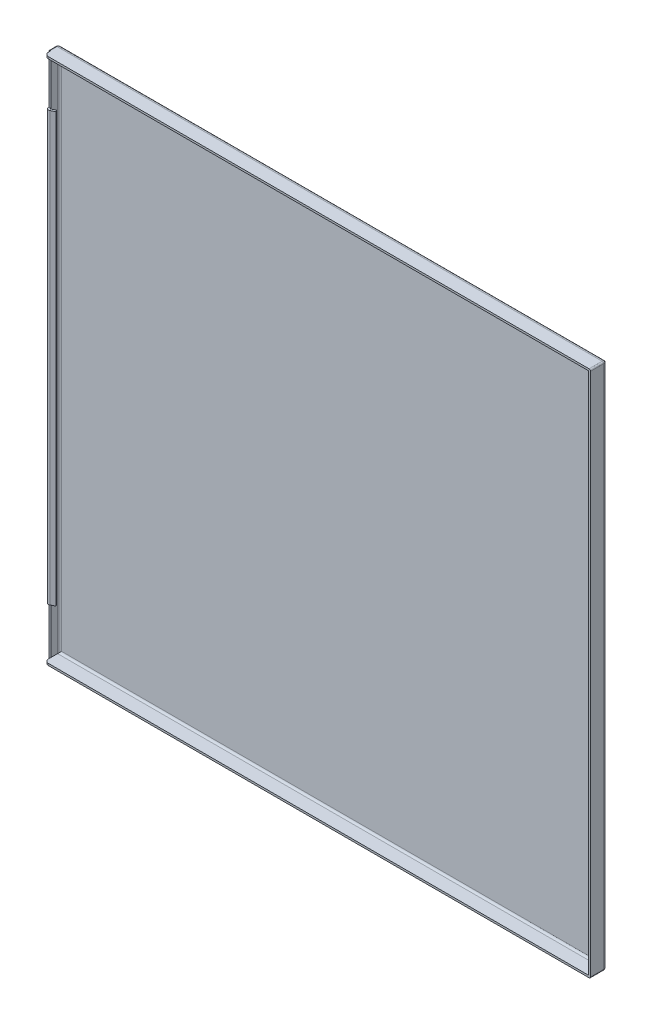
ISO-10303-21;
HEADER;
FILE_DESCRIPTION(('STEP AP214'),'2;1');
FILE_NAME('part.step','',(''),(''),'','','');
FILE_SCHEMA(('AUTOMOTIVE_DESIGN { 1 0 10303 214 1 1 1 1 }'));
ENDSEC;
DATA;
#1=APPLICATION_CONTEXT('core data for automotive mechanical design processes');
#2=APPLICATION_PROTOCOL_DEFINITION('international standard','automotive_design',2000,#1);
#3=PRODUCT_CONTEXT('',#1,'mechanical');
#4=PRODUCT('Part','Part','',(#3));
#5=PRODUCT_RELATED_PRODUCT_CATEGORY('part','',(#4));
#6=PRODUCT_DEFINITION_FORMATION('','',#4);
#7=PRODUCT_DEFINITION_CONTEXT('part definition',#1,'design');
#8=PRODUCT_DEFINITION('design','',#6,#7);
#9=PRODUCT_DEFINITION_SHAPE('','',#8);
#10=(LENGTH_UNIT() NAMED_UNIT(*) SI_UNIT(.MILLI.,.METRE.));
#11=(NAMED_UNIT(*) PLANE_ANGLE_UNIT() SI_UNIT($,.RADIAN.));
#12=(NAMED_UNIT(*) SI_UNIT($,.STERADIAN.) SOLID_ANGLE_UNIT());
#13=UNCERTAINTY_MEASURE_WITH_UNIT(LENGTH_MEASURE(1.E-05),#10,'distance_accuracy_value','');
#14=(GEOMETRIC_REPRESENTATION_CONTEXT(3) GLOBAL_UNCERTAINTY_ASSIGNED_CONTEXT((#13)) GLOBAL_UNIT_ASSIGNED_CONTEXT((#10,
#11,#12)) REPRESENTATION_CONTEXT('',''));
#15=CARTESIAN_POINT('',(0.,0.,0.));
#16=DIRECTION('',(0.,0.,1.));
#17=DIRECTION('',(1.,0.,0.));
#18=AXIS2_PLACEMENT_3D('',#15,#16,#17);
#19=CARTESIAN_POINT('',(-282.37,-272.223,-8.93399999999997));
#20=DIRECTION('',(0.,0.,0.999999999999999));
#21=DIRECTION('',(0.999999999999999,0.,0.));
#22=AXIS2_PLACEMENT_3D('',#19,#20,#21);
#23=PLANE('',#22);
#24=DIRECTION('',(0.,1.,0.));
#25=VECTOR('',#24,1.);
#26=CARTESIAN_POINT('',(-280.34,-221.,-8.93399999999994));
#27=LINE('',#26,#25);
#28=CARTESIAN_POINT('',(-280.34,-270.193,-8.934));
#29=VERTEX_POINT('',#28);
#30=CARTESIAN_POINT('',(-280.34,-221.,-8.93399999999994));
#31=VERTEX_POINT('',#30);
#32=EDGE_CURVE('E676',#29,#31,#27,.T.);
#33=ORIENTED_EDGE('',*,*,#32,.T.);
#34=DIRECTION('',(-0.999999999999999,0.,0.));
#35=VECTOR('',#34,1.);
#36=CARTESIAN_POINT('',(-285.509482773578,-221.,-8.93399999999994));
#37=LINE('',#36,#35);
#38=CARTESIAN_POINT('',(-282.37,-221.,-8.93399999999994));
#39=VERTEX_POINT('',#38);
#40=EDGE_CURVE('E67',#31,#39,#37,.T.);
#41=ORIENTED_EDGE('',*,*,#40,.T.);
#42=DIRECTION('',(0.,1.,0.));
#43=VECTOR('',#42,1.);
#44=CARTESIAN_POINT('',(-282.37,-221.,-8.93399999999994));
#45=LINE('',#44,#43);
#46=CARTESIAN_POINT('',(-282.37,-270.723,-8.93399999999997));
#47=VERTEX_POINT('',#46);
#48=EDGE_CURVE('E54',#39,#47,#45,.F.);
#49=ORIENTED_EDGE('',*,*,#48,.T.);
#50=CARTESIAN_POINT('',(-280.87,-270.723,-8.93399999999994));
#51=DIRECTION('',(0.,0.,-0.999999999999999));
#52=DIRECTION('',(-0.999999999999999,0.,0.));
#53=AXIS2_PLACEMENT_3D('',#50,#51,#52);
#54=CIRCLE('',#53,1.5);
#55=CARTESIAN_POINT('',(-280.87,-272.223,-8.93399999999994));
#56=VERTEX_POINT('',#55);
#57=EDGE_CURVE('E869',#47,#56,#54,.F.);
#58=ORIENTED_EDGE('',*,*,#57,.T.);
#59=DIRECTION('',(0.999999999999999,0.,0.));
#60=VECTOR('',#59,1.);
#61=CARTESIAN_POINT('',(-282.37,-272.223,-8.93399999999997));
#62=LINE('',#61,#60);
#63=CARTESIAN_POINT('',(-280.34,-272.223,-8.93399999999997));
#64=VERTEX_POINT('',#63);
#65=EDGE_CURVE('E864',#64,#56,#62,.F.);
#66=ORIENTED_EDGE('',*,*,#65,.F.);
#67=DIRECTION('',(0.,1.,0.));
#68=VECTOR('',#67,1.);
#69=CARTESIAN_POINT('',(-280.34,-270.193,-8.934));
#70=LINE('',#69,#68);
#71=EDGE_CURVE('E871',#64,#29,#70,.T.);
#72=ORIENTED_EDGE('',*,*,#71,.T.);
#73=EDGE_LOOP('',(#33,#41,#49,#58,#66,#72));
#74=FACE_BOUND('',#73,.T.);
#75=ADVANCED_FACE('F47',(#74),#23,.T.);
#76=CARTESIAN_POINT('',(-280.34,-221.,-8.48714218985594));
#77=DIRECTION('',(0.999999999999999,0.,0.));
#78=DIRECTION('',(0.,0.,-0.999999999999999));
#79=AXIS2_PLACEMENT_3D('',#76,#77,#78);
#80=PLANE('',#79);
#81=ORIENTED_EDGE('',*,*,#32,.F.);
#82=DIRECTION('',(0.,0.,0.999999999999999));
#83=VECTOR('',#82,1.);
#84=CARTESIAN_POINT('',(-280.34,-270.193,-8.934));
#85=LINE('',#84,#83);
#86=CARTESIAN_POINT('',(-280.34,-270.193,-15.93));
#87=VERTEX_POINT('',#86);
#88=EDGE_CURVE('E683',#29,#87,#85,.F.);
#89=ORIENTED_EDGE('',*,*,#88,.T.);
#90=DIRECTION('',(0.,1.,0.));
#91=VECTOR('',#90,1.);
#92=CARTESIAN_POINT('',(-280.34,-221.,-15.9299999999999));
#93=LINE('',#92,#91);
#94=CARTESIAN_POINT('',(-280.34,270.193,-15.93));
#95=VERTEX_POINT('',#94);
#96=EDGE_CURVE('E898',#95,#87,#93,.F.);
#97=ORIENTED_EDGE('',*,*,#96,.F.);
#98=DIRECTION('',(0.,0.,-0.999999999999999));
#99=VECTOR('',#98,1.);
#100=CARTESIAN_POINT('',(-280.34,270.193,-8.934));
#101=LINE('',#100,#99);
#102=CARTESIAN_POINT('',(-280.34,270.193,-8.934));
#103=VERTEX_POINT('',#102);
#104=EDGE_CURVE('E895',#95,#103,#101,.F.);
#105=ORIENTED_EDGE('',*,*,#104,.T.);
#106=CARTESIAN_POINT('',(-280.34,221.,-8.93400000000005));
#107=VERTEX_POINT('',#106);
#108=EDGE_CURVE('E321',#107,#103,#27,.T.);
#109=ORIENTED_EDGE('',*,*,#108,.F.);
#110=DIRECTION('',(0.,0.,-0.999999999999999));
#111=VECTOR('',#110,1.);
#112=CARTESIAN_POINT('',(-280.34,221.,-8.0487361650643));
#113=LINE('',#112,#111);
#114=CARTESIAN_POINT('',(-280.34,221.,-8.48714218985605));
#115=VERTEX_POINT('',#114);
#116=EDGE_CURVE('E295',#115,#107,#113,.T.);
#117=ORIENTED_EDGE('',*,*,#116,.F.);
#118=DIRECTION('',(0.,1.,0.));
#119=VECTOR('',#118,1.);
#120=CARTESIAN_POINT('',(-280.34,-221.,-8.48714218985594));
#121=LINE('',#120,#119);
#122=CARTESIAN_POINT('',(-280.34,-221.,-8.48714218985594));
#123=VERTEX_POINT('',#122);
#124=EDGE_CURVE('E319',#123,#115,#121,.T.);
#125=ORIENTED_EDGE('',*,*,#124,.F.);
#126=DIRECTION('',(0.,0.,-0.999999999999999));
#127=VECTOR('',#126,1.);
#128=CARTESIAN_POINT('',(-280.34,-221.,-8.04873616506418));
#129=LINE('',#128,#127);
#130=EDGE_CURVE('E315',#123,#31,#129,.T.);
#131=ORIENTED_EDGE('',*,*,#130,.T.);
#132=EDGE_LOOP('',(#81,#89,#97,#105,#109,#117,#125,#131));
#133=FACE_BOUND('',#132,.T.);
#134=ADVANCED_FACE('F905',(#133),#80,.T.);
#135=CARTESIAN_POINT('',(-282.37,-221.,-11.684));
#136=DIRECTION('',(-0.999999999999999,0.,0.));
#137=DIRECTION('',(0.,0.,0.999999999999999));
#138=AXIS2_PLACEMENT_3D('',#135,#136,#137);
#139=PLANE('',#138);
#140=CARTESIAN_POINT('',(-282.37,270.723,-8.93400000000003));
#141=VERTEX_POINT('',#140);
#142=CARTESIAN_POINT('',(-282.37,221.,-8.93400000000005));
#143=VERTEX_POINT('',#142);
#144=EDGE_CURVE('E888',#141,#143,#45,.F.);
#145=ORIENTED_EDGE('',*,*,#144,.F.);
#146=DIRECTION('',(0.,0.,0.999999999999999));
#147=VECTOR('',#146,1.);
#148=CARTESIAN_POINT('',(-282.37,270.723,-11.684));
#149=LINE('',#148,#147);
#150=CARTESIAN_POINT('',(-282.369933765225,270.723000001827,-15.9300003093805));
#151=VERTEX_POINT('',#150);
#152=EDGE_CURVE('E885',#151,#141,#149,.T.);
#153=ORIENTED_EDGE('',*,*,#152,.F.);
#154=DIRECTION('',(0.,1.,0.));
#155=VECTOR('',#154,1.);
#156=CARTESIAN_POINT('',(-282.37,-272.223,-15.9299999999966));
#157=LINE('',#156,#155);
#158=CARTESIAN_POINT('',(-282.369950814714,-270.723000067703,-15.9301182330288));
#159=VERTEX_POINT('',#158);
#160=EDGE_CURVE('E881',#151,#159,#157,.F.);
#161=ORIENTED_EDGE('',*,*,#160,.T.);
#162=DIRECTION('',(0.,0.,0.999999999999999));
#163=VECTOR('',#162,1.);
#164=CARTESIAN_POINT('',(-282.37,-270.723,-11.684));
#165=LINE('',#164,#163);
#166=EDGE_CURVE('E876',#47,#159,#165,.F.);
#167=ORIENTED_EDGE('',*,*,#166,.F.);
#168=ORIENTED_EDGE('',*,*,#48,.F.);
#169=DIRECTION('',(0.,0.,-0.999999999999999));
#170=VECTOR('',#169,1.);
#171=CARTESIAN_POINT('',(-282.37,-221.,-8.04873616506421));
#172=LINE('',#171,#170);
#173=CARTESIAN_POINT('',(-282.37,-221.,-8.48714218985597));
#174=VERTEX_POINT('',#173);
#175=EDGE_CURVE('E260',#174,#39,#172,.T.);
#176=ORIENTED_EDGE('',*,*,#175,.F.);
#177=DIRECTION('',(0.,1.,0.));
#178=VECTOR('',#177,1.);
#179=CARTESIAN_POINT('',(-282.37,-221.,-8.48714218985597));
#180=LINE('',#179,#178);
#181=CARTESIAN_POINT('',(-282.37,221.,-8.48714218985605));
#182=VERTEX_POINT('',#181);
#183=EDGE_CURVE('E255',#174,#182,#180,.T.);
#184=ORIENTED_EDGE('',*,*,#183,.T.);
#185=DIRECTION('',(0.,0.,-0.999999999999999));
#186=VECTOR('',#185,1.);
#187=CARTESIAN_POINT('',(-282.37,221.,-8.04873616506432));
#188=LINE('',#187,#186);
#189=EDGE_CURVE('E258',#182,#143,#188,.T.);
#190=ORIENTED_EDGE('',*,*,#189,.T.);
#191=EDGE_LOOP('',(#145,#153,#161,#167,#168,#176,#184,#190));
#192=FACE_BOUND('',#191,.T.);
#193=ADVANCED_FACE('F257',(#192),#139,.T.);
#194=DIRECTION('',(-0.999999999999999,0.,0.));
#195=VECTOR('',#194,1.);
#196=CARTESIAN_POINT('',(-285.509482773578,221.,-8.93400000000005));
#197=LINE('',#196,#195);
#198=EDGE_CURVE('E75',#107,#143,#197,.T.);
#199=ORIENTED_EDGE('',*,*,#198,.F.);
#200=ORIENTED_EDGE('',*,*,#108,.T.);
#201=DIRECTION('',(0.,1.,0.));
#202=VECTOR('',#201,1.);
#203=CARTESIAN_POINT('',(-280.34,270.193,-8.934));
#204=LINE('',#203,#202);
#205=CARTESIAN_POINT('',(-280.34,272.223,-8.93400000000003));
#206=VERTEX_POINT('',#205);
#207=EDGE_CURVE('E860',#103,#206,#204,.T.);
#208=ORIENTED_EDGE('',*,*,#207,.T.);
#209=DIRECTION('',(0.999999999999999,0.,0.));
#210=VECTOR('',#209,1.);
#211=CARTESIAN_POINT('',(-282.37,272.223,-8.93400000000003));
#212=LINE('',#211,#210);
#213=CARTESIAN_POINT('',(-280.87,272.223,-8.93400000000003));
#214=VERTEX_POINT('',#213);
#215=EDGE_CURVE('E855',#214,#206,#212,.T.);
#216=ORIENTED_EDGE('',*,*,#215,.F.);
#217=CARTESIAN_POINT('',(-280.87,270.723,-8.93400000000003));
#218=DIRECTION('',(0.,0.,0.999999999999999));
#219=DIRECTION('',(0.999999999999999,0.,0.));
#220=AXIS2_PLACEMENT_3D('',#217,#218,#219);
#221=CIRCLE('',#220,1.5);
#222=EDGE_CURVE('E852',#214,#141,#221,.T.);
#223=ORIENTED_EDGE('',*,*,#222,.T.);
#224=ORIENTED_EDGE('',*,*,#144,.T.);
#225=EDGE_LOOP('',(#199,#200,#208,#216,#223,#224));
#226=FACE_BOUND('',#225,.T.);
#227=ADVANCED_FACE('F946',(#226),#23,.T.);
#228=CARTESIAN_POINT('',(-280.34,270.193,-8.934));
#229=DIRECTION('',(0.999999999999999,0.,0.));
#230=DIRECTION('',(0.,0.,-0.999999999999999));
#231=AXIS2_PLACEMENT_3D('',#228,#229,#230);
#232=PLANE('',#231);
#233=ORIENTED_EDGE('',*,*,#207,.F.);
#234=DIRECTION('',(0.,0.,-0.999999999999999));
#235=VECTOR('',#234,1.);
#236=CARTESIAN_POINT('',(-280.34,270.193,-8.934));
#237=LINE('',#236,#235);
#238=CARTESIAN_POINT('',(-280.34,270.193,-6.464));
#239=VERTEX_POINT('',#238);
#240=EDGE_CURVE('E847',#239,#103,#237,.T.);
#241=ORIENTED_EDGE('',*,*,#240,.F.);
#242=DIRECTION('',(0.,1.,0.));
#243=VECTOR('',#242,1.);
#244=CARTESIAN_POINT('',(-280.34,270.193,-6.464));
#245=LINE('',#244,#243);
#246=CARTESIAN_POINT('',(-280.34,272.223,-6.46400000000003));
#247=VERTEX_POINT('',#246);
#248=EDGE_CURVE('E844',#247,#239,#245,.F.);
#249=ORIENTED_EDGE('',*,*,#248,.F.);
#250=DIRECTION('',(0.,0.,0.999999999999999));
#251=VECTOR('',#250,1.);
#252=CARTESIAN_POINT('',(-280.34,272.223,-15.93));
#253=LINE('',#252,#251);
#254=EDGE_CURVE('E839',#247,#206,#253,.F.);
#255=ORIENTED_EDGE('',*,*,#254,.T.);
#256=EDGE_LOOP('',(#233,#241,#249,#255));
#257=FACE_BOUND('',#256,.T.);
#258=ADVANCED_FACE('F944',(#257),#232,.F.);
#259=CARTESIAN_POINT('',(-282.37,272.223,-15.93));
#260=DIRECTION('',(0.,1.,0.));
#261=DIRECTION('',(0.,0.,0.999999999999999));
#262=AXIS2_PLACEMENT_3D('',#259,#260,#261);
#263=PLANE('',#262);
#264=DIRECTION('',(0.,0.,0.999999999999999));
#265=VECTOR('',#264,1.);
#266=CARTESIAN_POINT('',(-280.87,272.223,-15.93));
#267=LINE('',#266,#265);
#268=CARTESIAN_POINT('',(-280.870000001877,272.222801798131,-15.9300008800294));
#269=VERTEX_POINT('',#268);
#270=EDGE_CURVE('E835',#214,#269,#267,.F.);
#271=ORIENTED_EDGE('',*,*,#270,.F.);
#272=ORIENTED_EDGE('',*,*,#215,.T.);
#273=ORIENTED_EDGE('',*,*,#254,.F.);
#274=CARTESIAN_POINT('',(-276.34,272.223,-6.46400000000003));
#275=DIRECTION('',(0.,1.,0.));
#276=DIRECTION('',(0.,0.,0.999999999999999));
#277=AXIS2_PLACEMENT_3D('',#274,#275,#276);
#278=CIRCLE('',#277,4.);
#279=CARTESIAN_POINT('',(-276.34,272.223,-2.46400000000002));
#280=VERTEX_POINT('',#279);
#281=EDGE_CURVE('E832',#280,#247,#278,.F.);
#282=ORIENTED_EDGE('',*,*,#281,.F.);
#283=DIRECTION('',(0.999999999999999,0.,0.));
#284=VECTOR('',#283,1.);
#285=CARTESIAN_POINT('',(-282.37,272.223,-2.46400000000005));
#286=LINE('',#285,#284);
#287=CARTESIAN_POINT('',(281.73,272.223,-2.46400000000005));
#288=VERTEX_POINT('',#287);
#289=EDGE_CURVE('E829',#288,#280,#286,.F.);
#290=ORIENTED_EDGE('',*,*,#289,.F.);
#291=DIRECTION('',(0.,0.,0.999999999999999));
#292=VECTOR('',#291,1.);
#293=CARTESIAN_POINT('',(281.73,272.223,-15.93));
#294=LINE('',#293,#292);
#295=CARTESIAN_POINT('',(281.730000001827,272.222933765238,-15.9300003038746));
#296=VERTEX_POINT('',#295);
#297=EDGE_CURVE('E825',#296,#288,#294,.T.);
#298=ORIENTED_EDGE('',*,*,#297,.F.);
#299=DIRECTION('',(0.999999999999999,0.,0.));
#300=VECTOR('',#299,1.);
#301=CARTESIAN_POINT('',(-282.37,272.223,-15.93));
#302=LINE('',#301,#300);
#303=EDGE_CURVE('E822',#296,#269,#302,.F.);
#304=ORIENTED_EDGE('',*,*,#303,.T.);
#305=EDGE_LOOP('',(#271,#272,#273,#282,#290,#298,#304));
#306=FACE_BOUND('',#305,.T.);
#307=ADVANCED_FACE('F357',(#306),#263,.T.);
#308=CARTESIAN_POINT('',(-280.87,270.723,-17.26971844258));
#309=DIRECTION('',(0.,0.,0.999999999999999));
#310=DIRECTION('',(0.999999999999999,0.,0.));
#311=AXIS2_PLACEMENT_3D('',#308,#309,#310);
#312=CYLINDRICAL_SURFACE('',#311,1.5);
#313=ORIENTED_EDGE('',*,*,#152,.T.);
#314=ORIENTED_EDGE('',*,*,#222,.F.);
#315=ORIENTED_EDGE('',*,*,#270,.T.);
#316=CARTESIAN_POINT('',(-282.369867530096,270.723000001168,-15.9300005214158));
#317=CARTESIAN_POINT('',(-282.369868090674,270.74529319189,-15.9300026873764));
#318=CARTESIAN_POINT('',(-282.369370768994,270.767586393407,-15.9300048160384));
#319=CARTESIAN_POINT('',(-282.367365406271,270.812520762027,-15.9300090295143));
#320=CARTESIAN_POINT('',(-282.365839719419,270.835161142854,-15.9300111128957));
#321=CARTESIAN_POINT('',(-282.361728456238,270.880727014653,-15.9300152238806));
#322=CARTESIAN_POINT('',(-282.359125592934,270.903650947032,-15.9300172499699));
#323=CARTESIAN_POINT('',(-282.352815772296,270.949714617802,-15.9300212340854));
#324=CARTESIAN_POINT('',(-282.34909205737,270.972852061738,-15.9300231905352));
#325=CARTESIAN_POINT('',(-282.340501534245,271.01926728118,-15.9300270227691));
#326=CARTESIAN_POINT('',(-282.335618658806,271.042542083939,-15.9300288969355));
#327=CARTESIAN_POINT('',(-282.324677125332,271.089150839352,-15.930032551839));
#328=CARTESIAN_POINT('',(-282.318603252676,271.112481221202,-15.9300343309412));
#329=CARTESIAN_POINT('',(-282.305254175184,271.159114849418,-15.9300377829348));
#330=CARTESIAN_POINT('',(-282.29796476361,271.182414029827,-15.9300394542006));
#331=CARTESIAN_POINT('',(-282.282167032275,271.228894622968,-15.9300426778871));
#332=CARTESIAN_POINT('',(-282.27364565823,271.252071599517,-15.9300442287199));
#333=CARTESIAN_POINT('',(-282.255375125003,271.29821370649,-15.9300471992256));
#334=CARTESIAN_POINT('',(-282.245614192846,271.32117417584,-15.9300486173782));
#335=CARTESIAN_POINT('',(-282.224864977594,271.366786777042,-15.9300513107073));
#336=CARTESIAN_POINT('',(-282.213866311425,271.389434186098,-15.9300525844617));
#337=CARTESIAN_POINT('',(-282.190651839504,271.434322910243,-15.9300549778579));
#338=CARTESIAN_POINT('',(-282.178427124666,271.456559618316,-15.930056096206));
#339=CARTESIAN_POINT('',(-282.152780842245,271.50052915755,-15.9300581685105));
#340=CARTESIAN_POINT('',(-282.139351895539,271.522257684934,-15.9300591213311));
#341=CARTESIAN_POINT('',(-282.111327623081,271.565114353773,-15.9300608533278));
#342=CARTESIAN_POINT('',(-282.096726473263,271.586238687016,-15.9300616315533));
#343=CARTESIAN_POINT('',(-282.06639836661,271.627793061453,-15.9300630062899));
#344=CARTESIAN_POINT('',(-282.050667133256,271.648219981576,-15.9300636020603));
#345=CARTESIAN_POINT('',(-282.018129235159,271.688289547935,-15.9300646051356));
#346=CARTESIAN_POINT('',(-282.001319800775,271.707929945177,-15.9300650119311));
#347=CARTESIAN_POINT('',(-281.9666851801,271.746341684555,-15.9300656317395));
#348=CARTESIAN_POINT('',(-281.94885865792,271.765111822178,-15.930065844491));
#349=CARTESIAN_POINT('',(-281.912258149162,271.801704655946,-15.9300660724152));
#350=CARTESIAN_POINT('',(-281.893484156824,271.81952734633,-15.9300660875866));
#351=CARTESIAN_POINT('',(-281.85506472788,271.854154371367,-15.9300659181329));
#352=CARTESIAN_POINT('',(-281.835420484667,271.870960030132,-15.9300657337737));
#353=CARTESIAN_POINT('',(-281.795343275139,271.903490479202,-15.9300651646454));
#354=CARTESIAN_POINT('',(-281.774912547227,271.919218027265,-15.930064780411));
#355=CARTESIAN_POINT('',(-281.73335063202,271.949538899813,-15.9300638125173));
#356=CARTESIAN_POINT('',(-281.712222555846,271.964136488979,-15.9300632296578));
#357=CARTESIAN_POINT('',(-281.669358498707,271.992153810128,-15.93006186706));
#358=CARTESIAN_POINT('',(-281.647626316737,272.005579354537,-15.9300610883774));
#359=CARTESIAN_POINT('',(-281.603649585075,272.031219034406,-15.9300593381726));
#360=CARTESIAN_POINT('',(-281.581409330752,272.043440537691,-15.9300583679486));
#361=CARTESIAN_POINT('',(-281.536513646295,272.066648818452,-15.9300562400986));
#362=CARTESIAN_POINT('',(-281.513862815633,272.077644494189,-15.9300550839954));
#363=CARTESIAN_POINT('',(-281.468243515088,272.098387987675,-15.9300525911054));
#364=CARTESIAN_POINT('',(-281.445279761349,272.108146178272,-15.9300512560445));
#365=CARTESIAN_POINT('',(-281.399131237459,272.126411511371,-15.9300484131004));
#366=CARTESIAN_POINT('',(-281.375951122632,272.134930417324,-15.9300469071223));
#367=CARTESIAN_POINT('',(-281.329464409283,272.150723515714,-15.9300437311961));
#368=CARTESIAN_POINT('',(-281.306162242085,272.158010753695,-15.9300420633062));
#369=CARTESIAN_POINT('',(-281.259522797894,272.171355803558,-15.930038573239));
#370=CARTESIAN_POINT('',(-281.236189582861,272.177427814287,-15.9300367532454));
#371=CARTESIAN_POINT('',(-281.189575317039,272.188365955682,-15.9300329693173));
#372=CARTESIAN_POINT('',(-281.166297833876,272.193247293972,-15.9300310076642));
#373=CARTESIAN_POINT('',(-281.119877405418,272.2018350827,-15.9300269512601));
#374=CARTESIAN_POINT('',(-281.096737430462,272.205557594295,-15.9300248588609));
#375=CARTESIAN_POINT('',(-281.050668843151,272.211865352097,-15.9300205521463));
#376=CARTESIAN_POINT('',(-281.027742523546,272.214467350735,-15.9300183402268));
#377=CARTESIAN_POINT('',(-280.98217201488,272.218577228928,-15.9300138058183));
#378=CARTESIAN_POINT('',(-280.95952938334,272.220102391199,-15.9300114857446));
#379=CARTESIAN_POINT('',(-280.914590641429,272.222107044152,-15.9300067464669));
#380=CARTESIAN_POINT('',(-280.892295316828,272.222604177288,-15.9300043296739));
#381=CARTESIAN_POINT('',(-280.870000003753,272.22260359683,-15.9300018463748));
#382=B_SPLINE_CURVE_WITH_KNOTS('',3,(#316,#317,#318,#319,#320,#321,#322,#323,#324,#325,#326,
#327,#328,#329,#330,#331,#332,#333,#334,#335,#336,#337,#338,#339,#340,#341,#342,#343,#344,#345,
#346,#347,#348,#349,#350,#351,#352,#353,#354,#355,#356,#357,#358,#359,#360,#361,#362,#363,#364,
#365,#366,#367,#368,#369,#370,#371,#372,#373,#374,#375,#376,#377,#378,#379,#380,#381),
.UNSPECIFIED.,.F.,.F.,(4,2,2,2,2,2,2,2,2,2,2,2,2,2,2,2,2,2,2,2,2,2,2,2,2,2,2,2,2,2,2,2,4),(0.,
0.0668740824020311,0.134925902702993,0.204115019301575,0.274394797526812,0.345712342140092,
0.418008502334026,0.491217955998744,0.565269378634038,0.640085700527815,0.715584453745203,
0.791678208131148,0.868275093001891,0.945279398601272,1.02259224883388,1.10011233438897,
1.17773669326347,1.25536152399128,1.33288301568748,1.41019817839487,1.4872056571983,
1.56380651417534,1.63990496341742,1.71540904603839,1.79023123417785,1.86428895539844,
1.93750503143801,2.00980802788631,2.08113251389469,2.15141923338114,2.22061519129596,
2.28867366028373,2.35555411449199),.UNSPECIFIED.);
#383=EDGE_CURVE('E339',#269,#151,#382,.F.);
#384=ORIENTED_EDGE('',*,*,#383,.T.);
#385=EDGE_LOOP('',(#313,#314,#315,#384));
#386=FACE_BOUND('',#385,.T.);
#387=ADVANCED_FACE('F346',(#386),#312,.T.);
#388=CARTESIAN_POINT('',(-280.34,-270.193,-8.934));
#389=DIRECTION('',(-0.999999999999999,0.,0.));
#390=DIRECTION('',(0.,0.,0.999999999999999));
#391=AXIS2_PLACEMENT_3D('',#388,#389,#390);
#392=PLANE('',#391);
#393=ORIENTED_EDGE('',*,*,#71,.F.);
#394=DIRECTION('',(0.,0.,-0.999999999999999));
#395=VECTOR('',#394,1.);
#396=CARTESIAN_POINT('',(-280.34,-272.223,-15.9299999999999));
#397=LINE('',#396,#395);
#398=CARTESIAN_POINT('',(-280.34,-272.223,-6.46399999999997));
#399=VERTEX_POINT('',#398);
#400=EDGE_CURVE('E816',#64,#399,#397,.F.);
#401=ORIENTED_EDGE('',*,*,#400,.T.);
#402=DIRECTION('',(0.,1.,0.));
#403=VECTOR('',#402,1.);
#404=CARTESIAN_POINT('',(-280.34,-273.5368943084,-6.46399999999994));
#405=LINE('',#404,#403);
#406=CARTESIAN_POINT('',(-280.34,-270.193,-6.464));
#407=VERTEX_POINT('',#406);
#408=EDGE_CURVE('E814',#399,#407,#405,.T.);
#409=ORIENTED_EDGE('',*,*,#408,.T.);
#410=DIRECTION('',(0.,0.,0.999999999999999));
#411=VECTOR('',#410,1.);
#412=CARTESIAN_POINT('',(-280.34,-270.193,-8.934));
#413=LINE('',#412,#411);
#414=EDGE_CURVE('E811',#29,#407,#413,.T.);
#415=ORIENTED_EDGE('',*,*,#414,.F.);
#416=EDGE_LOOP('',(#393,#401,#409,#415));
#417=FACE_BOUND('',#416,.T.);
#418=ADVANCED_FACE('F356',(#417),#392,.T.);
#419=CARTESIAN_POINT('',(-280.87,-270.723,-6.58399759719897));
#420=DIRECTION('',(0.,0.,-0.999999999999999));
#421=DIRECTION('',(-0.999999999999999,0.,0.));
#422=AXIS2_PLACEMENT_3D('',#419,#420,#421);
#423=CYLINDRICAL_SURFACE('',#422,1.5);
#424=ORIENTED_EDGE('',*,*,#166,.T.);
#425=CARTESIAN_POINT('',(-280.869999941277,-272.222604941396,-15.9302244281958));
#426=CARTESIAN_POINT('',(-280.892295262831,-272.222605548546,-15.930228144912));
#427=CARTESIAN_POINT('',(-280.914590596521,-272.222108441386,-15.9302317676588));
#428=CARTESIAN_POINT('',(-280.959529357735,-272.220103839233,-15.9302388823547));
#429=CARTESIAN_POINT('',(-280.982171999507,-272.218578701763,-15.930242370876));
#430=CARTESIAN_POINT('',(-281.027742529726,-272.214468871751,-15.9302491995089));
#431=CARTESIAN_POINT('',(-281.050668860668,-272.211866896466,-15.9302525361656));
#432=CARTESIAN_POINT('',(-281.09673747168,-272.205559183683,-15.9302590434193));
#433=CARTESIAN_POINT('',(-281.119877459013,-272.20183669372,-15.9302622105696));
#434=CARTESIAN_POINT('',(-281.166297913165,-272.193248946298,-15.9302683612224));
#435=CARTESIAN_POINT('',(-281.189575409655,-272.188367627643,-15.9302713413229));
#436=CARTESIAN_POINT('',(-281.236189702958,-272.177429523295,-15.9302771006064));
#437=CARTESIAN_POINT('',(-281.25952293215,-272.171357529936,-15.9302798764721));
#438=CARTESIAN_POINT('',(-281.30616240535,-272.158012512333,-15.9302852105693));
#439=CARTESIAN_POINT('',(-281.329464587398,-272.150725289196,-15.9302877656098));
#440=CARTESIAN_POINT('',(-281.375951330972,-272.134932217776,-15.9302926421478));
#441=CARTESIAN_POINT('',(-281.399131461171,-272.126413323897,-15.9302949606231));
#442=CARTESIAN_POINT('',(-281.445280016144,-272.108148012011,-15.9302993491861));
#443=CARTESIAN_POINT('',(-281.468243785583,-272.098389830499,-15.9303014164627));
#444=CARTESIAN_POINT('',(-281.513863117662,-272.077646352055,-15.9303052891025));
#445=CARTESIAN_POINT('',(-281.53651396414,-272.06665068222,-15.9303070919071));
#446=CARTESIAN_POINT('',(-281.581409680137,-272.043442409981,-15.9303104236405));
#447=CARTESIAN_POINT('',(-281.60364995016,-272.031220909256,-15.9303119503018));
#448=CARTESIAN_POINT('',(-281.647626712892,-272.005581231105,-15.9303147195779));
#449=CARTESIAN_POINT('',(-281.669358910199,-271.992155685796,-15.930315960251));
#450=CARTESIAN_POINT('',(-281.712222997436,-271.964138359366,-15.9303181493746));
#451=CARTESIAN_POINT('',(-281.733351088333,-271.949540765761,-15.930319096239));
#452=CARTESIAN_POINT('',(-281.774913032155,-271.919219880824,-15.9303206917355));
#453=CARTESIAN_POINT('',(-281.795343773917,-271.903492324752,-15.9303213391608));
#454=CARTESIAN_POINT('',(-281.835421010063,-271.87096185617,-15.9303223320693));
#455=CARTESIAN_POINT('',(-281.855065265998,-271.854156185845,-15.9303226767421));
#456=CARTESIAN_POINT('',(-281.893484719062,-271.819529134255,-15.9303230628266));
#457=CARTESIAN_POINT('',(-281.912258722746,-271.801706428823,-15.9303231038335));
#458=CARTESIAN_POINT('',(-281.948859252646,-271.76511356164,-15.930322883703));
#459=CARTESIAN_POINT('',(-281.966685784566,-271.746343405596,-15.9303226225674));
#460=CARTESIAN_POINT('',(-282.001320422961,-271.707931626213,-15.9303218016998));
#461=CARTESIAN_POINT('',(-282.018129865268,-271.688291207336,-15.9303212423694));
#462=CARTESIAN_POINT('',(-282.050667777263,-271.648221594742,-15.9303198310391));
#463=CARTESIAN_POINT('',(-282.066399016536,-271.627794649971,-15.9303189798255));
#464=CARTESIAN_POINT('',(-282.096727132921,-271.586240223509,-15.9303169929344));
#465=CARTESIAN_POINT('',(-282.111328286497,-271.565115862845,-15.9303158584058));
#466=CARTESIAN_POINT('',(-282.13935256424,-271.522259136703,-15.9303133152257));
#467=CARTESIAN_POINT('',(-282.152781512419,-271.500530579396,-15.9303119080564));
#468=CARTESIAN_POINT('',(-282.178427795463,-271.456560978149,-15.9303088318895));
#469=CARTESIAN_POINT('',(-282.1906525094,-271.434324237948,-15.9303071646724));
#470=CARTESIAN_POINT('',(-282.213866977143,-271.389435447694,-15.9303035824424));
#471=CARTESIAN_POINT('',(-282.224865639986,-271.366788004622,-15.9303016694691));
#472=CARTESIAN_POINT('',(-282.24561484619,-271.321175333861,-15.9302976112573));
#473=CARTESIAN_POINT('',(-282.25537577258,-271.298214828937,-15.9302954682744));
#474=CARTESIAN_POINT('',(-282.273646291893,-271.252072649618,-15.9302909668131));
#475=CARTESIAN_POINT('',(-282.282167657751,-271.228895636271,-15.9302886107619));
#476=CARTESIAN_POINT('',(-282.297965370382,-271.182414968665,-15.9302837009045));
#477=CARTESIAN_POINT('',(-282.305254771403,-271.159115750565,-15.9302811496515));
#478=CARTESIAN_POINT('',(-282.318603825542,-271.112482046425,-15.930275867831));
#479=CARTESIAN_POINT('',(-282.324677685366,-271.089151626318,-15.9302731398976));
#480=CARTESIAN_POINT('',(-282.335619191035,-271.042542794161,-15.9302675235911));
#481=CARTESIAN_POINT('',(-282.340502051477,-271.019267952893,-15.9302646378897));
#482=CARTESIAN_POINT('',(-282.3490925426,-270.972852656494,-15.9302587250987));
#483=CARTESIAN_POINT('',(-282.3528162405,-270.949715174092,-15.9302557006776));
#484=CARTESIAN_POINT('',(-282.359126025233,-270.903651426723,-15.9302495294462));
#485=CARTESIAN_POINT('',(-282.361728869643,-270.880727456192,-15.9302463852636));
#486=CARTESIAN_POINT('',(-282.365840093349,-270.835161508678,-15.9302399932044));
#487=CARTESIAN_POINT('',(-282.367365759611,-270.812521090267,-15.9302367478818));
#488=CARTESIAN_POINT('',(-282.369371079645,-270.767586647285,-15.9302301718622));
#489=CARTESIAN_POINT('',(-282.369868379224,-270.74529340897,-15.9302268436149));
#490=CARTESIAN_POINT('',(-282.369867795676,-270.723000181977,-15.9302234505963));
#491=B_SPLINE_CURVE_WITH_KNOTS('',3,(#425,#426,#427,#428,#429,#430,#431,#432,#433,#434,#435,
#436,#437,#438,#439,#440,#441,#442,#443,#444,#445,#446,#447,#448,#449,#450,#451,#452,#453,#454,
#455,#456,#457,#458,#459,#460,#461,#462,#463,#464,#465,#466,#467,#468,#469,#470,#471,#472,#473,
#474,#475,#476,#477,#478,#479,#480,#481,#482,#483,#484,#485,#486,#487,#488,#489,#490),
.UNSPECIFIED.,.F.,.F.,(4,2,2,2,2,2,2,2,2,2,2,2,2,2,2,2,2,2,2,2,2,2,2,2,2,2,2,2,2,2,2,2,4),(0.,
0.0668804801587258,0.134938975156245,0.204134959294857,0.274421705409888,0.345746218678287,
0.418049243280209,0.491265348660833,0.565323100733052,0.640145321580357,0.715649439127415,
0.79174792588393,0.868348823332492,0.945356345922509,1.02267155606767,1.10019309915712,
1.17781798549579,1.25544240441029,1.33296255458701,1.41027547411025,1.48727985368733,
1.56387681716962,1.63997065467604,1.71546949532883,1.7902859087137,1.86433742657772,
1.9375469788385,2.0098432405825,2.08116088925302,2.15144077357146,2.22062999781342,
2.28868192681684,2.35555611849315),.UNSPECIFIED.);
#492=CARTESIAN_POINT('',(-280.869999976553,-272.222814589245,-15.9300916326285));
#493=VERTEX_POINT('',#492);
#494=EDGE_CURVE('E529',#159,#493,#491,.F.);
#495=ORIENTED_EDGE('',*,*,#494,.T.);
#496=DIRECTION('',(0.,0.,-0.999999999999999));
#497=VECTOR('',#496,1.);
#498=CARTESIAN_POINT('',(-280.87,-272.223,-15.9299999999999));
#499=LINE('',#498,#497);
#500=EDGE_CURVE('E804',#493,#56,#499,.F.);
#501=ORIENTED_EDGE('',*,*,#500,.T.);
#502=ORIENTED_EDGE('',*,*,#57,.F.);
#503=EDGE_LOOP('',(#424,#495,#501,#502));
#504=FACE_BOUND('',#503,.T.);
#505=ADVANCED_FACE('F361',(#504),#423,.T.);
#506=CARTESIAN_POINT('',(283.23,-272.223,-15.93));
#507=DIRECTION('',(0.,-1.,0.));
#508=DIRECTION('',(0.,0.,-0.999999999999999));
#509=AXIS2_PLACEMENT_3D('',#506,#507,#508);
#510=PLANE('',#509);
#511=CARTESIAN_POINT('',(-276.34,-272.223,-6.46399999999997));
#512=DIRECTION('',(0.,1.,0.));
#513=DIRECTION('',(0.,0.,0.999999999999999));
#514=AXIS2_PLACEMENT_3D('',#511,#512,#513);
#515=CIRCLE('',#514,4.);
#516=CARTESIAN_POINT('',(-276.34,-272.223,-2.46399999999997));
#517=VERTEX_POINT('',#516);
#518=EDGE_CURVE('E802',#399,#517,#515,.T.);
#519=ORIENTED_EDGE('',*,*,#518,.F.);
#520=ORIENTED_EDGE('',*,*,#400,.F.);
#521=ORIENTED_EDGE('',*,*,#65,.T.);
#522=ORIENTED_EDGE('',*,*,#500,.F.);
#523=DIRECTION('',(-0.999999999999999,0.,0.));
#524=VECTOR('',#523,1.);
#525=CARTESIAN_POINT('',(283.23,-272.223,-15.93));
#526=LINE('',#525,#524);
#527=CARTESIAN_POINT('',(281.730000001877,-272.22280179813,-15.9300008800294));
#528=VERTEX_POINT('',#527);
#529=EDGE_CURVE('E798',#493,#528,#526,.F.);
#530=ORIENTED_EDGE('',*,*,#529,.T.);
#531=DIRECTION('',(0.,0.,-0.999999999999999));
#532=VECTOR('',#531,1.);
#533=CARTESIAN_POINT('',(281.73,-272.223,-15.93));
#534=LINE('',#533,#532);
#535=CARTESIAN_POINT('',(281.73,-272.223,-2.46399999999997));
#536=VERTEX_POINT('',#535);
#537=EDGE_CURVE('E794',#536,#528,#534,.T.);
#538=ORIENTED_EDGE('',*,*,#537,.F.);
#539=DIRECTION('',(0.999999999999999,0.,0.));
#540=VECTOR('',#539,1.);
#541=CARTESIAN_POINT('',(283.23,-272.223,-2.46399999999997));
#542=LINE('',#541,#540);
#543=EDGE_CURVE('E791',#517,#536,#542,.T.);
#544=ORIENTED_EDGE('',*,*,#543,.F.);
#545=EDGE_LOOP('',(#519,#520,#521,#522,#530,#538,#544));
#546=FACE_BOUND('',#545,.T.);
#547=ADVANCED_FACE('F366',(#546),#510,.T.);
#548=CARTESIAN_POINT('',(-278.31,-272.223,-15.93));
#549=DIRECTION('',(0.,1.,0.));
#550=DIRECTION('',(0.,0.,0.999999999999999));
#551=AXIS2_PLACEMENT_3D('',#548,#549,#550);
#552=CYLINDRICAL_SURFACE('',#551,4.06);
#553=CARTESIAN_POINT('',(-278.309999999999,268.163000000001,-19.9900000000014));
#554=CARTESIAN_POINT('',(-278.407902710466,268.224733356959,-19.9895073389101));
#555=CARTESIAN_POINT('',(-278.50578551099,268.286454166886,-19.9857422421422));
#556=CARTESIAN_POINT('',(-278.652055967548,268.378686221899,-19.9750289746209));
#557=CARTESIAN_POINT('',(-278.700581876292,268.409284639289,-19.9706334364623));
#558=CARTESIAN_POINT('',(-278.797347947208,268.470301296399,-19.9601539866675));
#559=CARTESIAN_POINT('',(-278.845588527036,268.500719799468,-19.9540755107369));
#560=CARTESIAN_POINT('',(-278.941765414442,268.561364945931,-19.9402189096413));
#561=CARTESIAN_POINT('',(-278.989702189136,268.591591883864,-19.9324453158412));
#562=CARTESIAN_POINT('',(-279.085254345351,268.651843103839,-19.9151868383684));
#563=CARTESIAN_POINT('',(-279.132870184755,268.6818676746,-19.9057055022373));
#564=CARTESIAN_POINT('',(-279.227763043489,268.741703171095,-19.8850200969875));
#565=CARTESIAN_POINT('',(-279.275040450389,268.771514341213,-19.87381851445));
#566=CARTESIAN_POINT('',(-279.369239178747,268.830912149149,-19.8496812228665));
#567=CARTESIAN_POINT('',(-279.416160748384,268.860498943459,-19.8367468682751));
#568=CARTESIAN_POINT('',(-279.509630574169,268.919437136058,-19.8091326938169));
#569=CARTESIAN_POINT('',(-279.556178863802,268.948788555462,-19.7944530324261));
#570=CARTESIAN_POINT('',(-279.648885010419,269.00724520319,-19.7633370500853));
#571=CARTESIAN_POINT('',(-279.695042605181,269.036350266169,-19.7468996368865));
#572=CARTESIAN_POINT('',(-279.786950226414,269.094303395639,-19.7122566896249));
#573=CARTESIAN_POINT('',(-279.832699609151,269.123151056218,-19.6940487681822));
#574=CARTESIAN_POINT('',(-279.923773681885,269.180578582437,-19.6558547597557));
#575=CARTESIAN_POINT('',(-279.969097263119,269.209157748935,-19.635864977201));
#576=CARTESIAN_POINT('',(-280.059280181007,269.266023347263,-19.5941019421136));
#577=CARTESIAN_POINT('',(-280.104138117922,269.294308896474,-19.5723244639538));
#578=CARTESIAN_POINT('',(-280.19331610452,269.350540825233,-19.5269831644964));
#579=CARTESIAN_POINT('',(-280.237634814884,269.378486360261,-19.5034156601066));
#580=CARTESIAN_POINT('',(-280.325658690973,269.433990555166,-19.4544938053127));
#581=CARTESIAN_POINT('',(-280.36936260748,269.461548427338,-19.4291363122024));
#582=CARTESIAN_POINT('',(-280.456081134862,269.516229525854,-19.3766336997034));
#583=CARTESIAN_POINT('',(-280.499094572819,269.543352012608,-19.3494858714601));
#584=CARTESIAN_POINT('',(-280.584356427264,269.597114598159,-19.2934020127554));
#585=CARTESIAN_POINT('',(-280.62660371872,269.623753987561,-19.2644635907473));
#586=CARTESIAN_POINT('',(-280.710257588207,269.676502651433,-19.2047980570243));
#587=CARTESIAN_POINT('',(-280.751663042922,269.702611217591,-19.1740687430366));
#588=CARTESIAN_POINT('',(-280.833557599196,269.75425054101,-19.1108210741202));
#589=CARTESIAN_POINT('',(-280.874045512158,269.779780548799,-19.0783005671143));
#590=CARTESIAN_POINT('',(-280.954029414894,269.830215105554,-19.011470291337));
#591=CARTESIAN_POINT('',(-280.993524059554,269.855118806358,-18.9771582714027));
#592=CARTESIAN_POINT('',(-281.071445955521,269.904253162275,-18.9067449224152));
#593=CARTESIAN_POINT('',(-281.109871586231,269.92848279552,-18.8706410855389));
#594=CARTESIAN_POINT('',(-281.185580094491,269.976221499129,-18.7966441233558));
#595=CARTESIAN_POINT('',(-281.22286092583,269.999729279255,-18.758748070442));
#596=CARTESIAN_POINT('',(-281.296199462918,270.045973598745,-18.6811727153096));
#597=CARTESIAN_POINT('',(-281.33225469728,270.068708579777,-18.6414901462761));
#598=CARTESIAN_POINT('',(-281.403049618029,270.113349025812,-18.5603841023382));
#599=CARTESIAN_POINT('',(-281.437787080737,270.135253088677,-18.5189579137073));
#600=CARTESIAN_POINT('',(-281.5058478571,270.178169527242,-18.4344123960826));
#601=CARTESIAN_POINT('',(-281.539169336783,270.199180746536,-18.3912910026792));
#602=CARTESIAN_POINT('',(-281.604299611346,270.240249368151,-18.3034030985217));
#603=CARTESIAN_POINT('',(-281.636106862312,270.260305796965,-18.2586349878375));
#604=CARTESIAN_POINT('',(-281.698110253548,270.299402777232,-18.1675018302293));
#605=CARTESIAN_POINT('',(-281.728304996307,270.318442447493,-18.1211354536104));
#606=CARTESIAN_POINT('',(-281.786985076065,270.355443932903,-18.0268541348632));
#607=CARTESIAN_POINT('',(-281.815468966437,270.37340483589,-17.9789379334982));
#608=CARTESIAN_POINT('',(-281.870629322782,270.408186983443,-17.8816055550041));
#609=CARTESIAN_POINT('',(-281.897304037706,270.425007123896,-17.8321879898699));
#610=CARTESIAN_POINT('',(-281.94874801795,270.457445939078,-17.7319015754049));
#611=CARTESIAN_POINT('',(-281.973514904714,270.473063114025,-17.6810310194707));
#612=CARTESIAN_POINT('',(-282.021046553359,270.503035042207,-17.5778878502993));
#613=CARTESIAN_POINT('',(-282.043807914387,270.517387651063,-17.5256130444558));
#614=CARTESIAN_POINT('',(-282.087225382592,270.544765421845,-17.4197169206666));
#615=CARTESIAN_POINT('',(-282.107876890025,270.557787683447,-17.3660929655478));
#616=CARTESIAN_POINT('',(-282.147005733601,270.582461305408,-17.2576259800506));
#617=CARTESIAN_POINT('',(-282.165478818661,270.594109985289,-17.2027808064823));
#618=CARTESIAN_POINT('',(-282.200180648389,270.615992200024,-17.0920153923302));
#619=CARTESIAN_POINT('',(-282.216406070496,270.626223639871,-17.0360936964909));
#620=CARTESIAN_POINT('',(-282.246540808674,270.645226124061,-16.9233188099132));
#621=CARTESIAN_POINT('',(-282.260447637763,270.653995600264,-16.8664646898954));
#622=CARTESIAN_POINT('',(-282.285874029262,270.670029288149,-16.7519688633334));
#623=CARTESIAN_POINT('',(-282.297391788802,270.677292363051,-16.6943265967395));
#624=CARTESIAN_POINT('',(-282.317968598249,270.690268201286,-16.5783984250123));
#625=CARTESIAN_POINT('',(-282.327026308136,270.695980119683,-16.5201121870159));
#626=CARTESIAN_POINT('',(-282.342613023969,270.705809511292,-16.4030404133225));
#627=CARTESIAN_POINT('',(-282.349140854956,270.709926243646,-16.3442546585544));
#628=CARTESIAN_POINT('',(-282.359593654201,270.716518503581,-16.2263273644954));
#629=CARTESIAN_POINT('',(-282.363517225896,270.718993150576,-16.167185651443));
#630=CARTESIAN_POINT('',(-282.368704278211,270.722265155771,-16.0486962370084));
#631=CARTESIAN_POINT('',(-282.36996579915,270.723061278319,-15.9893484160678));
#632=CARTESIAN_POINT('',(-282.369867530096,270.723000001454,-15.9300005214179));
#633=B_SPLINE_CURVE_WITH_KNOTS('',3,(#553,#554,#555,#556,#557,#558,#559,#560,#561,#562,#563,
#564,#565,#566,#567,#568,#569,#570,#571,#572,#573,#574,#575,#576,#577,#578,#579,#580,#581,#582,
#583,#584,#585,#586,#587,#588,#589,#590,#591,#592,#593,#594,#595,#596,#597,#598,#599,#600,#601,
#602,#603,#604,#605,#606,#607,#608,#609,#610,#611,#612,#613,#614,#615,#616,#617,#618,#619,#620,
#621,#622,#623,#624,#625,#626,#627,#628,#629,#630,#631,#632),.UNSPECIFIED.,.F.,.F.,(4,2,2,2,2,2,
2,2,2,2,2,2,2,2,2,2,2,2,2,2,2,2,2,2,2,2,2,2,2,2,2,2,2,2,2,2,2,2,2,4),(0.,0.34714611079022,
0.519730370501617,0.691763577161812,0.863342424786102,1.03456887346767,1.20555010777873,
1.3763984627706,1.54723131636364,1.7181709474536,1.88934435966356,2.06088143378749,
2.23283634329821,2.40515518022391,2.5777844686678,2.75068122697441,2.92381411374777,
3.09716458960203,3.27072808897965,3.44451519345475,3.61855279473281,3.79288523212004,
3.96755054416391,4.1424985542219,4.31766664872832,4.49300967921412,4.66850228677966,
4.84414125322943,5.01994785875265,5.19597021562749,5.37228553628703,5.54897739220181,
5.72600853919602,5.90329864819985,6.08077771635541,6.25839023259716,6.43609930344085,
6.61389080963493,6.79177758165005,6.96979526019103),.UNSPECIFIED.);
#634=CARTESIAN_POINT('',(-278.309999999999,268.163,-19.9900000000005));
#635=VERTEX_POINT('',#634);
#636=EDGE_CURVE('E380',#635,#151,#633,.T.);
#637=ORIENTED_EDGE('',*,*,#636,.F.);
#638=DIRECTION('',(0.,1.,0.));
#639=VECTOR('',#638,1.);
#640=CARTESIAN_POINT('',(-278.31,140.7319424,-19.99));
#641=LINE('',#640,#639);
#642=CARTESIAN_POINT('',(-278.309999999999,-268.163,-19.9899999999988));
#643=VERTEX_POINT('',#642);
#644=EDGE_CURVE('E789',#635,#643,#641,.F.);
#645=ORIENTED_EDGE('',*,*,#644,.T.);
#646=CARTESIAN_POINT('',(-282.369867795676,-270.723000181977,-15.9302234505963));
#647=CARTESIAN_POINT('',(-282.369962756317,-270.723059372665,-15.9895689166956));
#648=CARTESIAN_POINT('',(-282.368697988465,-270.722261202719,-16.0489141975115));
#649=CARTESIAN_POINT('',(-282.363504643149,-270.718985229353,-16.167398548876));
#650=CARTESIAN_POINT('',(-282.359578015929,-270.716508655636,-16.2265377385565));
#651=CARTESIAN_POINT('',(-282.349119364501,-270.709912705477,-16.3444600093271));
#652=CARTESIAN_POINT('',(-282.34258872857,-270.705794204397,-16.4032432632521));
#653=CARTESIAN_POINT('',(-282.326996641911,-270.695961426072,-16.5203100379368));
#654=CARTESIAN_POINT('',(-282.317936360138,-270.690247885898,-16.5785937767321));
#655=CARTESIAN_POINT('',(-282.297354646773,-270.677268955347,-16.6945169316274));
#656=CARTESIAN_POINT('',(-282.285834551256,-270.670004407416,-16.752156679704));
#657=CARTESIAN_POINT('',(-282.260403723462,-270.653967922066,-16.8666474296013));
#658=CARTESIAN_POINT('',(-282.246494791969,-270.64519712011,-16.9234989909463));
#659=CARTESIAN_POINT('',(-282.216356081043,-270.626192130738,-17.0362686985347));
#660=CARTESIAN_POINT('',(-282.200128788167,-270.615959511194,-17.0921877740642));
#661=CARTESIAN_POINT('',(-282.165423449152,-270.594075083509,-17.2029478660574));
#662=CARTESIAN_POINT('',(-282.146948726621,-270.582425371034,-17.2577903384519));
#663=CARTESIAN_POINT('',(-282.107816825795,-270.55774982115,-17.3662518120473));
#664=CARTESIAN_POINT('',(-282.087163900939,-270.544726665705,-17.4198729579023));
#665=CARTESIAN_POINT('',(-282.043743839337,-270.51734725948,-17.5257634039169));
#666=CARTESIAN_POINT('',(-282.02098130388,-270.50299391,-17.578035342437));
#667=CARTESIAN_POINT('',(-281.973447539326,-270.473020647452,-17.6811727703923));
#668=CARTESIAN_POINT('',(-281.948679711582,-270.457402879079,-17.7320404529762));
#669=CARTESIAN_POINT('',(-281.897234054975,-270.424963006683,-17.8323211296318));
#670=CARTESIAN_POINT('',(-281.870558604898,-270.408142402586,-17.8817358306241));
#671=CARTESIAN_POINT('',(-281.815396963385,-270.373359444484,-17.9790625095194));
#672=CARTESIAN_POINT('',(-281.786912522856,-270.355398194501,-18.0269758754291));
#673=CARTESIAN_POINT('',(-281.728231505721,-270.318396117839,-18.1212515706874));
#674=CARTESIAN_POINT('',(-281.698036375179,-270.299356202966,-18.1676151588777));
#675=CARTESIAN_POINT('',(-281.636032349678,-270.26025882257,-18.2587428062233));
#676=CARTESIAN_POINT('',(-281.604224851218,-270.240202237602,-18.3035081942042));
#677=CARTESIAN_POINT('',(-281.539094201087,-270.199133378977,-18.3913907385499));
#678=CARTESIAN_POINT('',(-281.505772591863,-270.178122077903,-18.4345094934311));
#679=CARTESIAN_POINT('',(-281.4377116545,-270.135205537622,-18.5190498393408));
#680=CARTESIAN_POINT('',(-281.40297415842,-270.113301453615,-18.560473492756));
#681=CARTESIAN_POINT('',(-281.332179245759,-270.06866101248,-18.6415745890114));
#682=CARTESIAN_POINT('',(-281.296124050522,-270.045926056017,-18.6812547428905));
#683=CARTESIAN_POINT('',(-281.222785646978,-269.99968182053,-18.7588254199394));
#684=CARTESIAN_POINT('',(-281.185504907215,-269.976174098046,-18.7967192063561));
#685=CARTESIAN_POINT('',(-281.109796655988,-269.928435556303,-18.8707117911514));
#686=CARTESIAN_POINT('',(-281.071371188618,-269.904206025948,-18.906813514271));
#687=CARTESIAN_POINT('',(-280.993449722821,-269.855071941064,-18.9772227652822));
#688=CARTESIAN_POINT('',(-280.953955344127,-269.830168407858,-19.0115327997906));
#689=CARTESIAN_POINT('',(-280.873972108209,-269.779734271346,-19.0783592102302));
#690=CARTESIAN_POINT('',(-280.833484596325,-269.754204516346,-19.1108778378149));
#691=CARTESIAN_POINT('',(-280.75159100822,-269.702565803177,-19.1741218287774));
#692=CARTESIAN_POINT('',(-280.710186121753,-269.676457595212,-19.2048493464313));
#693=CARTESIAN_POINT('',(-280.626533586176,-269.623709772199,-19.2645113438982));
#694=CARTESIAN_POINT('',(-280.584287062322,-269.597070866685,-19.2934480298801));
#695=CARTESIAN_POINT('',(-280.499026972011,-269.54330939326,-19.3495284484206));
#696=CARTESIAN_POINT('',(-280.456014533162,-269.516187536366,-19.3766745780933));
#697=CARTESIAN_POINT('',(-280.369298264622,-269.4615078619,-19.4291738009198));
#698=CARTESIAN_POINT('',(-280.325595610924,-269.433950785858,-19.454529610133));
#699=CARTESIAN_POINT('',(-280.237574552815,-269.378448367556,-19.5034480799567));
#700=CARTESIAN_POINT('',(-280.193257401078,-269.350503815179,-19.5270138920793));
#701=CARTESIAN_POINT('',(-280.104082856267,-269.294274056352,-19.5723517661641));
#702=CARTESIAN_POINT('',(-280.059226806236,-269.26598969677,-19.5941275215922));
#703=CARTESIAN_POINT('',(-279.969048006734,-269.20912669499,-19.6358870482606));
#704=CARTESIAN_POINT('',(-279.923726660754,-269.180548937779,-19.6558750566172));
#705=CARTESIAN_POINT('',(-279.832657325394,-269.123124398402,-19.6940654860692));
#706=CARTESIAN_POINT('',(-279.786910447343,-269.094278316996,-19.7122716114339));
#707=CARTESIAN_POINT('',(-279.69500797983,-269.036328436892,-19.7469110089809));
#708=CARTESIAN_POINT('',(-279.648853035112,-269.007225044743,-19.7633466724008));
#709=CARTESIAN_POINT('',(-279.556152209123,-268.948771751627,-19.7944592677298));
#710=CARTESIAN_POINT('',(-279.509606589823,-268.919422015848,-19.809137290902));
#711=CARTESIAN_POINT('',(-279.416142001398,-268.860487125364,-19.8367483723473));
#712=CARTESIAN_POINT('',(-279.369222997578,-268.830901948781,-19.8496812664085));
#713=CARTESIAN_POINT('',(-279.275029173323,-268.771507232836,-19.8738158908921));
#714=CARTESIAN_POINT('',(-279.227754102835,-268.741697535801,-19.8850162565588));
#715=CARTESIAN_POINT('',(-279.132865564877,-268.681864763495,-19.9056995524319));
#716=CARTESIAN_POINT('',(-279.085251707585,-268.651841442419,-19.9151799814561));
#717=CARTESIAN_POINT('',(-278.989703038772,-268.591592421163,-19.9324370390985));
#718=CARTESIAN_POINT('',(-278.941767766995,-268.561366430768,-19.9402101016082));
#719=CARTESIAN_POINT('',(-278.845593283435,-268.500722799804,-19.954066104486));
#720=CARTESIAN_POINT('',(-278.797353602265,-268.470304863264,-19.960144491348));
#721=CARTESIAN_POINT('',(-278.700588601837,-268.409288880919,-19.9706242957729));
#722=CARTESIAN_POINT('',(-278.652062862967,-268.378690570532,-19.9750202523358));
#723=CARTESIAN_POINT('',(-278.50579023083,-268.286457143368,-19.9857357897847));
#724=CARTESIAN_POINT('',(-278.407905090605,-268.224734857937,-19.9895033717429));
#725=CARTESIAN_POINT('',(-278.309999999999,-268.163000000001,-19.9899999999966));
#726=B_SPLINE_CURVE_WITH_KNOTS('',3,(#646,#647,#648,#649,#650,#651,#652,#653,#654,#655,#656,
#657,#658,#659,#660,#661,#662,#663,#664,#665,#666,#667,#668,#669,#670,#671,#672,#673,#674,#675,
#676,#677,#678,#679,#680,#681,#682,#683,#684,#685,#686,#687,#688,#689,#690,#691,#692,#693,#694,
#695,#696,#697,#698,#699,#700,#701,#702,#703,#704,#705,#706,#707,#708,#709,#710,#711,#712,#713,
#714,#715,#716,#717,#718,#719,#720,#721,#722,#723,#724,#725),.UNSPECIFIED.,.F.,.F.,(4,2,2,2,2,2,
2,2,2,2,2,2,2,2,2,2,2,2,2,2,2,2,2,2,2,2,2,2,2,2,2,2,2,2,2,2,2,2,2,4),(0.,0.178010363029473,
0.355890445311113,0.533675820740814,0.711379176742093,0.888986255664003,1.06646003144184,
1.24374486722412,1.42077064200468,1.59745691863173,1.7737665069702,1.94978306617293,
2.12558383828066,2.30121697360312,2.47670379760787,2.65204114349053,2.82720370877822,
3.00214640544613,3.17680668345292,3.35113444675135,3.52516765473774,3.69895047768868,
3.87250963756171,4.04585554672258,4.21898347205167,4.39187470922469,4.56449775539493,
4.73680947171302,4.90875623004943,5.08028401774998,5.25144729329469,5.42237641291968,
5.59319885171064,5.76403735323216,5.93500975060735,6.10622882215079,6.27780218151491,
6.44983220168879,6.62241597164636,6.96957070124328),.UNSPECIFIED.);
#727=EDGE_CURVE('E491',#159,#643,#726,.T.);
#728=ORIENTED_EDGE('',*,*,#727,.F.);
#729=ORIENTED_EDGE('',*,*,#160,.F.);
#730=EDGE_LOOP('',(#637,#645,#728,#729));
#731=FACE_BOUND('',#730,.T.);
#732=ADVANCED_FACE('F387',(#731),#552,.T.);
#733=CARTESIAN_POINT('',(283.23,-270.193,-8.934));
#734=DIRECTION('',(0.,1.,0.));
#735=DIRECTION('',(0.,0.,0.999999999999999));
#736=AXIS2_PLACEMENT_3D('',#733,#734,#735);
#737=PLANE('',#736);
#738=DIRECTION('',(0.,0.,0.999999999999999));
#739=VECTOR('',#738,1.);
#740=CARTESIAN_POINT('',(281.2,-270.193,-8.934));
#741=LINE('',#740,#739);
#742=CARTESIAN_POINT('',(281.2,-270.193,-2.46399999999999));
#743=VERTEX_POINT('',#742);
#744=CARTESIAN_POINT('',(281.2,-270.193,-15.93));
#745=VERTEX_POINT('',#744);
#746=EDGE_CURVE('E783',#743,#745,#741,.F.);
#747=ORIENTED_EDGE('',*,*,#746,.T.);
#748=DIRECTION('',(0.999999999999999,0.,0.));
#749=VECTOR('',#748,1.);
#750=CARTESIAN_POINT('',(283.23,-270.193,-15.93));
#751=LINE('',#750,#749);
#752=EDGE_CURVE('E780',#87,#745,#751,.T.);
#753=ORIENTED_EDGE('',*,*,#752,.F.);
#754=ORIENTED_EDGE('',*,*,#88,.F.);
#755=ORIENTED_EDGE('',*,*,#414,.T.);
#756=CARTESIAN_POINT('',(-276.34,-270.193,-6.464));
#757=DIRECTION('',(0.,1.,0.));
#758=DIRECTION('',(0.,0.,0.999999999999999));
#759=AXIS2_PLACEMENT_3D('',#756,#757,#758);
#760=CIRCLE('',#759,4.);
#761=CARTESIAN_POINT('',(-276.34,-270.193,-2.46399999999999));
#762=VERTEX_POINT('',#761);
#763=EDGE_CURVE('E778',#407,#762,#760,.T.);
#764=ORIENTED_EDGE('',*,*,#763,.T.);
#765=DIRECTION('',(0.999999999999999,0.,0.));
#766=VECTOR('',#765,1.);
#767=CARTESIAN_POINT('',(-280.34,-270.193,-2.46399999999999));
#768=LINE('',#767,#766);
#769=EDGE_CURVE('E692',#762,#743,#768,.T.);
#770=ORIENTED_EDGE('',*,*,#769,.T.);
#771=EDGE_LOOP('',(#747,#753,#754,#755,#764,#770));
#772=FACE_BOUND('',#771,.T.);
#773=ADVANCED_FACE('F396',(#772),#737,.T.);
#774=CARTESIAN_POINT('',(-278.31,-272.223,-15.93));
#775=DIRECTION('',(0.,1.,0.));
#776=DIRECTION('',(0.,0.,0.999999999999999));
#777=AXIS2_PLACEMENT_3D('',#774,#775,#776);
#778=CYLINDRICAL_SURFACE('',#777,2.03);
#779=ORIENTED_EDGE('',*,*,#96,.T.);
#780=CARTESIAN_POINT('',(-278.31,-268.163,-15.9299999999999));
#781=DIRECTION('',(-0.707106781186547,0.707106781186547,0.));
#782=DIRECTION('',(-0.707106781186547,-0.707106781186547,0.));
#783=AXIS2_PLACEMENT_3D('',#780,#781,#782);
#784=ELLIPSE('',#783,2.87085353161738,2.03);
#785=CARTESIAN_POINT('',(-278.31,-268.163,-17.96));
#786=VERTEX_POINT('',#785);
#787=EDGE_CURVE('E689',#87,#786,#784,.F.);
#788=ORIENTED_EDGE('',*,*,#787,.T.);
#789=DIRECTION('',(0.,1.,0.));
#790=VECTOR('',#789,1.);
#791=CARTESIAN_POINT('',(-278.31,-272.223,-17.9599999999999));
#792=LINE('',#791,#790);
#793=CARTESIAN_POINT('',(-278.31,268.163,-17.96));
#794=VERTEX_POINT('',#793);
#795=EDGE_CURVE('E691',#794,#786,#792,.F.);
#796=ORIENTED_EDGE('',*,*,#795,.F.);
#797=CARTESIAN_POINT('',(-278.31,268.163,-15.93));
#798=DIRECTION('',(0.707106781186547,0.707106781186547,0.));
#799=DIRECTION('',(-0.707106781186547,0.707106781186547,0.));
#800=AXIS2_PLACEMENT_3D('',#797,#798,#799);
#801=ELLIPSE('',#800,2.87085353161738,2.03);
#802=EDGE_CURVE('E693',#794,#95,#801,.T.);
#803=ORIENTED_EDGE('',*,*,#802,.T.);
#804=EDGE_LOOP('',(#779,#788,#796,#803));
#805=FACE_BOUND('',#804,.T.);
#806=ADVANCED_FACE('F936',(#805),#778,.F.);
#807=CARTESIAN_POINT('',(-282.37,270.193,-8.934));
#808=DIRECTION('',(0.,-1.,0.));
#809=DIRECTION('',(0.,0.,-0.999999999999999));
#810=AXIS2_PLACEMENT_3D('',#807,#808,#809);
#811=PLANE('',#810);
#812=ORIENTED_EDGE('',*,*,#104,.F.);
#813=DIRECTION('',(0.999999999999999,0.,0.));
#814=VECTOR('',#813,1.);
#815=CARTESIAN_POINT('',(-282.37,270.193,-15.93));
#816=LINE('',#815,#814);
#817=CARTESIAN_POINT('',(281.2,270.193,-15.93));
#818=VERTEX_POINT('',#817);
#819=EDGE_CURVE('E696',#818,#95,#816,.F.);
#820=ORIENTED_EDGE('',*,*,#819,.F.);
#821=DIRECTION('',(0.,0.,-0.999999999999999));
#822=VECTOR('',#821,1.);
#823=CARTESIAN_POINT('',(281.2,270.193,-8.934));
#824=LINE('',#823,#822);
#825=CARTESIAN_POINT('',(281.2,270.193,-2.46399999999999));
#826=VERTEX_POINT('',#825);
#827=EDGE_CURVE('E765',#826,#818,#824,.T.);
#828=ORIENTED_EDGE('',*,*,#827,.F.);
#829=DIRECTION('',(0.999999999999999,0.,0.));
#830=VECTOR('',#829,1.);
#831=CARTESIAN_POINT('',(-280.34,270.193,-2.46399999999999));
#832=LINE('',#831,#830);
#833=CARTESIAN_POINT('',(-276.34,270.193,-2.46399999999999));
#834=VERTEX_POINT('',#833);
#835=EDGE_CURVE('E761',#826,#834,#832,.F.);
#836=ORIENTED_EDGE('',*,*,#835,.T.);
#837=CARTESIAN_POINT('',(-276.34,270.193,-6.464));
#838=DIRECTION('',(0.,1.,0.));
#839=DIRECTION('',(0.,0.,0.999999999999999));
#840=AXIS2_PLACEMENT_3D('',#837,#838,#839);
#841=CIRCLE('',#840,4.);
#842=EDGE_CURVE('E758',#834,#239,#841,.F.);
#843=ORIENTED_EDGE('',*,*,#842,.T.);
#844=ORIENTED_EDGE('',*,*,#240,.T.);
#845=EDGE_LOOP('',(#812,#820,#828,#836,#843,#844));
#846=FACE_BOUND('',#845,.T.);
#847=ADVANCED_FACE('F940',(#846),#811,.T.);
#848=CARTESIAN_POINT('',(-282.37,268.163,-15.93));
#849=DIRECTION('',(0.999999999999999,0.,0.));
#850=DIRECTION('',(0.,0.,-0.999999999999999));
#851=AXIS2_PLACEMENT_3D('',#848,#849,#850);
#852=CYLINDRICAL_SURFACE('',#851,2.03);
#853=ORIENTED_EDGE('',*,*,#819,.T.);
#854=ORIENTED_EDGE('',*,*,#802,.F.);
#855=DIRECTION('',(0.999999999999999,0.,0.));
#856=VECTOR('',#855,1.);
#857=CARTESIAN_POINT('',(-282.37,268.163,-17.96));
#858=LINE('',#857,#856);
#859=CARTESIAN_POINT('',(279.17,268.163,-17.96));
#860=VERTEX_POINT('',#859);
#861=EDGE_CURVE('E701',#860,#794,#858,.F.);
#862=ORIENTED_EDGE('',*,*,#861,.F.);
#863=CARTESIAN_POINT('',(279.17,268.163,-15.93));
#864=DIRECTION('',(0.707106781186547,-0.707106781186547,0.));
#865=DIRECTION('',(0.707106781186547,0.707106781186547,0.));
#866=AXIS2_PLACEMENT_3D('',#863,#864,#865);
#867=ELLIPSE('',#866,2.87085353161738,2.03);
#868=EDGE_CURVE('E697',#818,#860,#867,.F.);
#869=ORIENTED_EDGE('',*,*,#868,.F.);
#870=EDGE_LOOP('',(#853,#854,#862,#869));
#871=FACE_BOUND('',#870,.T.);
#872=ADVANCED_FACE('F938',(#871),#852,.F.);
#873=CARTESIAN_POINT('',(281.2,272.223,-8.93400000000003));
#874=DIRECTION('',(-0.999999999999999,0.,0.));
#875=DIRECTION('',(0.,0.,0.999999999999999));
#876=AXIS2_PLACEMENT_3D('',#873,#874,#875);
#877=PLANE('',#876);
#878=ORIENTED_EDGE('',*,*,#746,.F.);
#879=DIRECTION('',(0.,1.,0.));
#880=VECTOR('',#879,1.);
#881=CARTESIAN_POINT('',(281.2,272.223,-2.46400000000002));
#882=LINE('',#881,#880);
#883=EDGE_CURVE('E700',#743,#826,#882,.T.);
#884=ORIENTED_EDGE('',*,*,#883,.T.);
#885=ORIENTED_EDGE('',*,*,#827,.T.);
#886=DIRECTION('',(0.,1.,0.));
#887=VECTOR('',#886,1.);
#888=CARTESIAN_POINT('',(281.2,272.223,-15.93));
#889=LINE('',#888,#887);
#890=EDGE_CURVE('E749',#745,#818,#889,.T.);
#891=ORIENTED_EDGE('',*,*,#890,.F.);
#892=EDGE_LOOP('',(#878,#884,#885,#891));
#893=FACE_BOUND('',#892,.T.);
#894=ADVANCED_FACE('F931',(#893),#877,.T.);
#895=CARTESIAN_POINT('',(-280.34,272.223,-2.46400000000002));
#896=DIRECTION('',(0.,0.,0.999999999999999));
#897=DIRECTION('',(0.999999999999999,0.,0.));
#898=AXIS2_PLACEMENT_3D('',#895,#896,#897);
#899=PLANE('',#898);
#900=DIRECTION('',(0.,1.,0.));
#901=VECTOR('',#900,1.);
#902=CARTESIAN_POINT('',(-276.34,268.8296529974,-2.46400000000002));
#903=LINE('',#902,#901);
#904=EDGE_CURVE('E746',#280,#834,#903,.F.);
#905=ORIENTED_EDGE('',*,*,#904,.T.);
#906=ORIENTED_EDGE('',*,*,#835,.F.);
#907=ORIENTED_EDGE('',*,*,#883,.F.);
#908=ORIENTED_EDGE('',*,*,#769,.F.);
#909=DIRECTION('',(0.,1.,0.));
#910=VECTOR('',#909,1.);
#911=CARTESIAN_POINT('',(-276.34,272.223,-2.46400000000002));
#912=LINE('',#911,#910);
#913=EDGE_CURVE('E743',#517,#762,#912,.T.);
#914=ORIENTED_EDGE('',*,*,#913,.F.);
#915=ORIENTED_EDGE('',*,*,#543,.T.);
#916=CARTESIAN_POINT('',(281.73,-270.723,-2.46399999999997));
#917=DIRECTION('',(0.,0.,0.999999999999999));
#918=DIRECTION('',(0.999999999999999,0.,0.));
#919=AXIS2_PLACEMENT_3D('',#916,#917,#918);
#920=CIRCLE('',#919,1.5);
#921=CARTESIAN_POINT('',(283.23,-270.723,-2.46399999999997));
#922=VERTEX_POINT('',#921);
#923=EDGE_CURVE('E740',#922,#536,#920,.F.);
#924=ORIENTED_EDGE('',*,*,#923,.F.);
#925=DIRECTION('',(0.,1.,0.));
#926=VECTOR('',#925,1.);
#927=CARTESIAN_POINT('',(283.23,272.223,-2.46400000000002));
#928=LINE('',#927,#926);
#929=CARTESIAN_POINT('',(283.23,270.723,-2.46400000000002));
#930=VERTEX_POINT('',#929);
#931=EDGE_CURVE('E738',#922,#930,#928,.T.);
#932=ORIENTED_EDGE('',*,*,#931,.T.);
#933=CARTESIAN_POINT('',(281.73,270.723,-2.46400000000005));
#934=DIRECTION('',(0.,0.,0.999999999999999));
#935=DIRECTION('',(0.999999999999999,0.,0.));
#936=AXIS2_PLACEMENT_3D('',#933,#934,#935);
#937=CIRCLE('',#936,1.5);
#938=EDGE_CURVE('E705',#288,#930,#937,.F.);
#939=ORIENTED_EDGE('',*,*,#938,.F.);
#940=ORIENTED_EDGE('',*,*,#289,.T.);
#941=EDGE_LOOP('',(#905,#906,#907,#908,#914,#915,#924,#932,#939,#940));
#942=FACE_BOUND('',#941,.T.);
#943=ADVANCED_FACE('F922',(#942),#899,.T.);
#944=CARTESIAN_POINT('',(-276.34,268.8296529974,-6.46400000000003));
#945=DIRECTION('',(0.,1.,0.));
#946=DIRECTION('',(0.,0.,0.999999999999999));
#947=AXIS2_PLACEMENT_3D('',#944,#945,#946);
#948=CYLINDRICAL_SURFACE('',#947,4.);
#949=ORIENTED_EDGE('',*,*,#904,.F.);
#950=ORIENTED_EDGE('',*,*,#281,.T.);
#951=ORIENTED_EDGE('',*,*,#248,.T.);
#952=ORIENTED_EDGE('',*,*,#842,.F.);
#953=EDGE_LOOP('',(#949,#950,#951,#952));
#954=FACE_BOUND('',#953,.T.);
#955=ADVANCED_FACE('F1060',(#954),#948,.T.);
#956=CARTESIAN_POINT('',(283.23,-268.163,-15.93));
#957=DIRECTION('',(-0.999999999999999,0.,0.));
#958=DIRECTION('',(0.,0.,0.999999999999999));
#959=AXIS2_PLACEMENT_3D('',#956,#957,#958);
#960=CYLINDRICAL_SURFACE('',#959,2.03);
#961=ORIENTED_EDGE('',*,*,#752,.T.);
#962=CARTESIAN_POINT('',(279.17,-268.163,-15.9299999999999));
#963=DIRECTION('',(-0.707106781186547,-0.707106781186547,0.));
#964=DIRECTION('',(0.707106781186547,-0.707106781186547,0.));
#965=AXIS2_PLACEMENT_3D('',#962,#963,#964);
#966=ELLIPSE('',#965,2.87085353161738,2.03);
#967=CARTESIAN_POINT('',(279.17,-268.163,-17.96));
#968=VERTEX_POINT('',#967);
#969=EDGE_CURVE('E702',#745,#968,#966,.F.);
#970=ORIENTED_EDGE('',*,*,#969,.T.);
#971=DIRECTION('',(-0.999999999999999,0.,0.));
#972=VECTOR('',#971,1.);
#973=CARTESIAN_POINT('',(283.23,-268.163,-17.9599999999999));
#974=LINE('',#973,#972);
#975=EDGE_CURVE('E704',#786,#968,#974,.F.);
#976=ORIENTED_EDGE('',*,*,#975,.F.);
#977=ORIENTED_EDGE('',*,*,#787,.F.);
#978=EDGE_LOOP('',(#961,#970,#976,#977));
#979=FACE_BOUND('',#978,.T.);
#980=ADVANCED_FACE('F928',(#979),#960,.F.);
#981=CARTESIAN_POINT('',(-276.34,-273.5368943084,-6.46399999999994));
#982=DIRECTION('',(0.,1.,0.));
#983=DIRECTION('',(0.,0.,0.999999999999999));
#984=AXIS2_PLACEMENT_3D('',#981,#982,#983);
#985=CYLINDRICAL_SURFACE('',#984,4.);
#986=ORIENTED_EDGE('',*,*,#913,.T.);
#987=ORIENTED_EDGE('',*,*,#763,.F.);
#988=ORIENTED_EDGE('',*,*,#408,.F.);
#989=ORIENTED_EDGE('',*,*,#518,.T.);
#990=EDGE_LOOP('',(#986,#987,#988,#989));
#991=FACE_BOUND('',#990,.T.);
#992=ADVANCED_FACE('F916',(#991),#985,.T.);
#993=CARTESIAN_POINT('',(279.17,140.7319424,-17.96));
#994=DIRECTION('',(0.,0.,0.999999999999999));
#995=DIRECTION('',(0.999999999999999,0.,0.));
#996=AXIS2_PLACEMENT_3D('',#993,#994,#995);
#997=PLANE('',#996);
#998=DIRECTION('',(0.,-1.,0.));
#999=VECTOR('',#998,1.);
#1000=CARTESIAN_POINT('',(279.17,272.223,-17.96));
#1001=LINE('',#1000,#999);
#1002=EDGE_CURVE('E731',#968,#860,#1001,.F.);
#1003=ORIENTED_EDGE('',*,*,#1002,.T.);
#1004=ORIENTED_EDGE('',*,*,#861,.T.);
#1005=ORIENTED_EDGE('',*,*,#795,.T.);
#1006=ORIENTED_EDGE('',*,*,#975,.T.);
#1007=EDGE_LOOP('',(#1003,#1004,#1005,#1006));
#1008=FACE_BOUND('',#1007,.T.);
#1009=ADVANCED_FACE('F431',(#1008),#997,.T.);
#1010=CARTESIAN_POINT('',(281.73,270.723,-17.26971844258));
#1011=DIRECTION('',(0.,0.,0.999999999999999));
#1012=DIRECTION('',(0.999999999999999,0.,0.));
#1013=AXIS2_PLACEMENT_3D('',#1010,#1011,#1012);
#1014=CYLINDRICAL_SURFACE('',#1013,1.5);
#1015=ORIENTED_EDGE('',*,*,#297,.T.);
#1016=ORIENTED_EDGE('',*,*,#938,.T.);
#1017=DIRECTION('',(0.,0.,-0.999999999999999));
#1018=VECTOR('',#1017,1.);
#1019=CARTESIAN_POINT('',(283.23,270.723,-15.93));
#1020=LINE('',#1019,#1018);
#1021=CARTESIAN_POINT('',(283.22980179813,270.723000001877,-15.9300008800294));
#1022=VERTEX_POINT('',#1021);
#1023=EDGE_CURVE('E729',#930,#1022,#1020,.T.);
#1024=ORIENTED_EDGE('',*,*,#1023,.T.);
#1025=CARTESIAN_POINT('',(281.730000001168,272.222867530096,-15.9300005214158));
#1026=CARTESIAN_POINT('',(281.752293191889,272.222868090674,-15.9300026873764));
#1027=CARTESIAN_POINT('',(281.774586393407,272.222370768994,-15.9300048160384));
#1028=CARTESIAN_POINT('',(281.819520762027,272.220365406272,-15.9300090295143));
#1029=CARTESIAN_POINT('',(281.842161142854,272.21883971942,-15.9300111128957));
#1030=CARTESIAN_POINT('',(281.887727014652,272.214728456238,-15.9300152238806));
#1031=CARTESIAN_POINT('',(281.910650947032,272.212125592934,-15.9300172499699));
#1032=CARTESIAN_POINT('',(281.956714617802,272.205815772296,-15.9300212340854));
#1033=CARTESIAN_POINT('',(281.979852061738,272.202092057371,-15.9300231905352));
#1034=CARTESIAN_POINT('',(282.02626728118,272.193501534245,-15.9300270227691));
#1035=CARTESIAN_POINT('',(282.049542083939,272.188618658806,-15.9300288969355));
#1036=CARTESIAN_POINT('',(282.096150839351,272.177677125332,-15.930032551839));
#1037=CARTESIAN_POINT('',(282.119481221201,272.171603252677,-15.9300343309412));
#1038=CARTESIAN_POINT('',(282.166114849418,272.158254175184,-15.9300377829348));
#1039=CARTESIAN_POINT('',(282.189414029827,272.15096476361,-15.9300394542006));
#1040=CARTESIAN_POINT('',(282.235894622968,272.135167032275,-15.9300426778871));
#1041=CARTESIAN_POINT('',(282.259071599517,272.12664565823,-15.9300442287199));
#1042=CARTESIAN_POINT('',(282.30521370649,272.108375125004,-15.9300471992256));
#1043=CARTESIAN_POINT('',(282.328174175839,272.098614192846,-15.9300486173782));
#1044=CARTESIAN_POINT('',(282.373786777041,272.077864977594,-15.9300513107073));
#1045=CARTESIAN_POINT('',(282.396434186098,272.066866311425,-15.9300525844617));
#1046=CARTESIAN_POINT('',(282.441322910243,272.043651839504,-15.9300549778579));
#1047=CARTESIAN_POINT('',(282.463559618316,272.031427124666,-15.930056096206));
#1048=CARTESIAN_POINT('',(282.507529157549,272.005780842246,-15.9300581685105));
#1049=CARTESIAN_POINT('',(282.529257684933,271.99235189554,-15.9300591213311));
#1050=CARTESIAN_POINT('',(282.572114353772,271.964327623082,-15.9300608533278));
#1051=CARTESIAN_POINT('',(282.593238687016,271.949726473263,-15.9300616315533));
#1052=CARTESIAN_POINT('',(282.634793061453,271.91939836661,-15.9300630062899));
#1053=CARTESIAN_POINT('',(282.655219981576,271.903667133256,-15.9300636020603));
#1054=CARTESIAN_POINT('',(282.695289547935,271.871129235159,-15.9300646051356));
#1055=CARTESIAN_POINT('',(282.714929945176,271.854319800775,-15.9300650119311));
#1056=CARTESIAN_POINT('',(282.753341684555,271.8196851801,-15.9300656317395));
#1057=CARTESIAN_POINT('',(282.772111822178,271.80185865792,-15.930065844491));
#1058=CARTESIAN_POINT('',(282.808704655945,271.765258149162,-15.9300660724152));
#1059=CARTESIAN_POINT('',(282.82652734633,271.746484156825,-15.9300660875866));
#1060=CARTESIAN_POINT('',(282.861154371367,271.708064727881,-15.9300659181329));
#1061=CARTESIAN_POINT('',(282.877960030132,271.688420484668,-15.9300657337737));
#1062=CARTESIAN_POINT('',(282.910490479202,271.64834327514,-15.9300651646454));
#1063=CARTESIAN_POINT('',(282.926218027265,271.627912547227,-15.9300647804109));
#1064=CARTESIAN_POINT('',(282.956538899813,271.58635063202,-15.9300638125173));
#1065=CARTESIAN_POINT('',(282.971136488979,271.565222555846,-15.9300632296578));
#1066=CARTESIAN_POINT('',(282.999153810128,271.522358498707,-15.93006186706));
#1067=CARTESIAN_POINT('',(283.012579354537,271.500626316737,-15.9300610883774));
#1068=CARTESIAN_POINT('',(283.038219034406,271.456649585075,-15.9300593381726));
#1069=CARTESIAN_POINT('',(283.050440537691,271.434409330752,-15.9300583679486));
#1070=CARTESIAN_POINT('',(283.073648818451,271.389513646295,-15.9300562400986));
#1071=CARTESIAN_POINT('',(283.084644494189,271.366862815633,-15.9300550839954));
#1072=CARTESIAN_POINT('',(283.105387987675,271.321243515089,-15.9300525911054));
#1073=CARTESIAN_POINT('',(283.115146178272,271.29827976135,-15.9300512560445));
#1074=CARTESIAN_POINT('',(283.133411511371,271.25213123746,-15.9300484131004));
#1075=CARTESIAN_POINT('',(283.141930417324,271.228951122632,-15.9300469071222));
#1076=CARTESIAN_POINT('',(283.157723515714,271.182464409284,-15.9300437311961));
#1077=CARTESIAN_POINT('',(283.165010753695,271.159162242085,-15.9300420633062));
#1078=CARTESIAN_POINT('',(283.178355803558,271.112522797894,-15.930038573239));
#1079=CARTESIAN_POINT('',(283.184427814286,271.089189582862,-15.9300367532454));
#1080=CARTESIAN_POINT('',(283.195365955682,271.042575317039,-15.9300329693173));
#1081=CARTESIAN_POINT('',(283.200247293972,271.019297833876,-15.9300310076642));
#1082=CARTESIAN_POINT('',(283.2088350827,270.972877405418,-15.9300269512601));
#1083=CARTESIAN_POINT('',(283.212557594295,270.949737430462,-15.9300248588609));
#1084=CARTESIAN_POINT('',(283.218865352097,270.903668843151,-15.9300205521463));
#1085=CARTESIAN_POINT('',(283.221467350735,270.880742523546,-15.9300183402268));
#1086=CARTESIAN_POINT('',(283.225577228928,270.835172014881,-15.9300138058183));
#1087=CARTESIAN_POINT('',(283.227102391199,270.812529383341,-15.9300114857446));
#1088=CARTESIAN_POINT('',(283.229107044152,270.767590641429,-15.9300067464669));
#1089=CARTESIAN_POINT('',(283.229604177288,270.745295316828,-15.9300043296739));
#1090=CARTESIAN_POINT('',(283.22960359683,270.723000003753,-15.9300018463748));
#1091=B_SPLINE_CURVE_WITH_KNOTS('',3,(#1025,#1026,#1027,#1028,#1029,#1030,#1031,#1032,#1033,
#1034,#1035,#1036,#1037,#1038,#1039,#1040,#1041,#1042,#1043,#1044,#1045,#1046,#1047,#1048,#1049,
#1050,#1051,#1052,#1053,#1054,#1055,#1056,#1057,#1058,#1059,#1060,#1061,#1062,#1063,#1064,#1065,
#1066,#1067,#1068,#1069,#1070,#1071,#1072,#1073,#1074,#1075,#1076,#1077,#1078,#1079,#1080,#1081,
#1082,#1083,#1084,#1085,#1086,#1087,#1088,#1089,#1090),.UNSPECIFIED.,.F.,.F.,(4,2,2,2,2,2,2,2,2,
2,2,2,2,2,2,2,2,2,2,2,2,2,2,2,2,2,2,2,2,2,2,2,4),(0.,0.0668740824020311,0.13492590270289,
0.204115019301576,0.274394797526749,0.345712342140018,0.41800850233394,0.491217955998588,
0.565269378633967,0.640085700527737,0.71558445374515,0.791678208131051,0.868275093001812,
0.945279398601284,1.02259224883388,1.10011233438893,1.17773669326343,1.25536152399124,
1.33288301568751,1.41019817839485,1.48720565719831,1.56380651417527,1.63990496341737,
1.71540904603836,1.79023123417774,1.86428895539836,1.93750503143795,2.00980802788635,
2.08113251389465,2.1514192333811,2.22061519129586,2.28867366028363,2.35555411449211),.UNSPECIFIED.);
#1092=EDGE_CURVE('E412',#1022,#296,#1091,.F.);
#1093=ORIENTED_EDGE('',*,*,#1092,.T.);
#1094=EDGE_LOOP('',(#1015,#1016,#1024,#1093));
#1095=FACE_BOUND('',#1094,.T.);
#1096=ADVANCED_FACE('F420',(#1095),#1014,.T.);
#1097=CARTESIAN_POINT('',(-282.37,268.163,-15.93));
#1098=DIRECTION('',(0.999999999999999,0.,0.));
#1099=DIRECTION('',(0.,0.,-0.999999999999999));
#1100=AXIS2_PLACEMENT_3D('',#1097,#1098,#1099);
#1101=CYLINDRICAL_SURFACE('',#1100,4.06);
#1102=CARTESIAN_POINT('',(-280.870000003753,272.222603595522,-15.9300015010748));
#1103=CARTESIAN_POINT('',(-280.869994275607,272.22275257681,-15.9665423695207));
#1104=CARTESIAN_POINT('',(-280.869703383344,272.222372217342,-16.0030861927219));
#1105=CARTESIAN_POINT('',(-280.868503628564,272.22053632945,-16.076857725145));
#1106=CARTESIAN_POINT('',(-280.867582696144,272.219059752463,-16.1140847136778));
#1107=CARTESIAN_POINT('',(-280.865047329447,272.214968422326,-16.1891971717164));
#1108=CARTESIAN_POINT('',(-280.863419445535,272.212331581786,-16.2270809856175));
#1109=CARTESIAN_POINT('',(-280.85944052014,272.205890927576,-16.3034882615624));
#1110=CARTESIAN_POINT('',(-280.857075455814,272.202064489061,-16.3420090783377));
#1111=CARTESIAN_POINT('',(-280.851583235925,272.19320589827,-16.4196625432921));
#1112=CARTESIAN_POINT('',(-280.848441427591,272.188150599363,-16.45879151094));
#1113=CARTESIAN_POINT('',(-280.84136249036,272.176797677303,-16.5376235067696));
#1114=CARTESIAN_POINT('',(-280.837410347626,272.170476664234,-16.5773218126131));
#1115=CARTESIAN_POINT('',(-280.828679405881,272.156554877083,-16.6572433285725));
#1116=CARTESIAN_POINT('',(-280.823885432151,272.14893069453,-16.6974607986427));
#1117=CARTESIAN_POINT('',(-280.813442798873,272.132365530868,-16.7783587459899));
#1118=CARTESIAN_POINT('',(-280.807779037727,272.123401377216,-16.8190325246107));
#1119=CARTESIAN_POINT('',(-280.795572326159,272.104119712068,-16.9007670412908));
#1120=CARTESIAN_POINT('',(-280.789014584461,272.093779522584,-16.9418202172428));
#1121=CARTESIAN_POINT('',(-280.774998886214,272.07171018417,-17.024221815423));
#1122=CARTESIAN_POINT('',(-280.767526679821,272.059959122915,-17.0655619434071));
#1123=CARTESIAN_POINT('',(-280.751667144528,272.035033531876,-17.1484289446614));
#1124=CARTESIAN_POINT('',(-280.743266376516,272.021838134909,-17.1899469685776));
#1125=CARTESIAN_POINT('',(-280.725533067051,271.993991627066,-17.2730419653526));
#1126=CARTESIAN_POINT('',(-280.716188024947,271.979321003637,-17.3146097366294));
#1127=CARTESIAN_POINT('',(-280.697642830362,271.95016197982,-17.3931598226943));
#1128=CARTESIAN_POINT('',(-280.688513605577,271.935789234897,-17.4302018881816));
#1129=CARTESIAN_POINT('',(-280.669355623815,271.905586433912,-17.5047173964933));
#1130=CARTESIAN_POINT('',(-280.659308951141,271.889727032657,-17.5421743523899));
#1131=CARTESIAN_POINT('',(-280.638260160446,271.856483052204,-17.6174514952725));
#1132=CARTESIAN_POINT('',(-280.627239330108,271.839068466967,-17.6552531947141));
#1133=CARTESIAN_POINT('',(-280.604196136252,271.802643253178,-17.7311584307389));
#1134=CARTESIAN_POINT('',(-280.592154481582,271.783601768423,-17.769241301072));
#1135=CARTESIAN_POINT('',(-280.567031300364,271.743856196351,-17.8456412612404));
#1136=CARTESIAN_POINT('',(-280.553930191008,271.723120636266,-17.8839355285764));
#1137=CARTESIAN_POINT('',(-280.526656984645,271.679925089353,-17.9606836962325));
#1138=CARTESIAN_POINT('',(-280.512465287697,271.657433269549,-17.9991127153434));
#1139=CARTESIAN_POINT('',(-280.485438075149,271.614536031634,-18.0696864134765));
#1140=CARTESIAN_POINT('',(-280.472691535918,271.594280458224,-18.1019565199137));
#1141=CARTESIAN_POINT('',(-280.445878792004,271.55166025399,-18.1677674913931));
#1142=CARTESIAN_POINT('',(-280.431779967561,271.529243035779,-18.2012610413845));
#1143=CARTESIAN_POINT('',(-280.402172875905,271.482187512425,-18.2693514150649));
#1144=CARTESIAN_POINT('',(-280.386630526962,271.457496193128,-18.3038967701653));
#1145=CARTESIAN_POINT('',(-280.35406386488,271.405788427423,-18.3739088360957));
#1146=CARTESIAN_POINT('',(-280.337005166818,271.378718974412,-18.4093203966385));
#1147=CARTESIAN_POINT('',(-280.301349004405,271.322163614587,-18.4808652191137));
#1148=CARTESIAN_POINT('',(-280.282717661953,271.292625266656,-18.5169401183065));
#1149=CARTESIAN_POINT('',(-280.243888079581,271.231052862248,-18.5895963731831));
#1150=CARTESIAN_POINT('',(-280.223657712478,271.198967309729,-18.6261169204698));
#1151=CARTESIAN_POINT('',(-280.184430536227,271.13674446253,-18.6944821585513));
#1152=CARTESIAN_POINT('',(-280.165492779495,271.106701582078,-18.7264468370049));
#1153=CARTESIAN_POINT('',(-280.126866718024,271.04542789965,-18.7895964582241));
#1154=CARTESIAN_POINT('',(-280.107172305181,271.014187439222,-18.8207682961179));
#1155=CARTESIAN_POINT('',(-280.067036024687,270.950517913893,-18.8822781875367));
#1156=CARTESIAN_POINT('',(-280.046588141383,270.918079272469,-18.9126024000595));
#1157=CARTESIAN_POINT('',(-280.00494703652,270.852017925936,-18.972365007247));
#1158=CARTESIAN_POINT('',(-279.98374788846,270.818385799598,-19.0017888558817));
#1159=CARTESIAN_POINT('',(-279.940610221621,270.749945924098,-19.0596985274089));
#1160=CARTESIAN_POINT('',(-279.918665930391,270.715128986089,-19.0881691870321));
#1161=CARTESIAN_POINT('',(-279.874046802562,270.644332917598,-19.144120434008));
#1162=CARTESIAN_POINT('',(-279.851366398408,270.608344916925,-19.171585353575));
#1163=CARTESIAN_POINT('',(-279.805287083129,270.535225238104,-19.2254732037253));
#1164=CARTESIAN_POINT('',(-279.781882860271,270.498085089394,-19.2518800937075));
#1165=CARTESIAN_POINT('',(-279.7343710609,270.422685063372,-19.3036000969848));
#1166=CARTESIAN_POINT('',(-279.710258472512,270.384417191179,-19.3288969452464));
#1167=CARTESIAN_POINT('',(-279.661348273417,270.306791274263,-19.3783451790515));
#1168=CARTESIAN_POINT('',(-279.636545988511,270.267425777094,-19.4024802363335));
#1169=CARTESIAN_POINT('',(-279.586277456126,270.187640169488,-19.4495530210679));
#1170=CARTESIAN_POINT('',(-279.560806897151,270.147213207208,-19.4724745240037));
#1171=CARTESIAN_POINT('',(-279.509226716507,270.065345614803,-19.5170685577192));
#1172=CARTESIAN_POINT('',(-279.483113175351,270.023898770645,-19.5387251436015));
#1173=CARTESIAN_POINT('',(-279.430270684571,269.940040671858,-19.5807353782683));
#1174=CARTESIAN_POINT('',(-279.403538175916,269.897623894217,-19.6010735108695));
#1175=CARTESIAN_POINT('',(-279.345578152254,269.805652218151,-19.6432515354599));
#1176=CARTESIAN_POINT('',(-279.314297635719,269.756012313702,-19.6648337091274));
#1177=CARTESIAN_POINT('',(-279.252831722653,269.658458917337,-19.7049592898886));
#1178=CARTESIAN_POINT('',(-279.222663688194,269.610573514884,-19.723597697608));
#1179=CARTESIAN_POINT('',(-279.163464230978,269.51662721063,-19.758116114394));
#1180=CARTESIAN_POINT('',(-279.13444810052,269.470589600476,-19.774085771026));
#1181=CARTESIAN_POINT('',(-279.077601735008,269.380418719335,-19.8035399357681));
#1182=CARTESIAN_POINT('',(-279.049784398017,269.3363047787,-19.817108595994));
#1183=CARTESIAN_POINT('',(-278.995382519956,269.2500476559,-19.8420204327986));
#1184=CARTESIAN_POINT('',(-278.968808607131,269.207920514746,-19.8534424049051));
#1185=CARTESIAN_POINT('',(-278.91694510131,269.125689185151,-19.8743069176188));
#1186=CARTESIAN_POINT('',(-278.891663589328,269.085598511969,-19.8838230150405));
#1187=CARTESIAN_POINT('',(-278.833342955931,268.993082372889,-19.9042918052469));
#1188=CARTESIAN_POINT('',(-278.800264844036,268.940585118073,-19.9148115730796));
#1189=CARTESIAN_POINT('',(-278.734928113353,268.836897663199,-19.933471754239));
#1190=CARTESIAN_POINT('',(-278.702674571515,268.785715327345,-19.9416739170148));
#1191=CARTESIAN_POINT('',(-278.639019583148,268.684718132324,-19.9559117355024));
#1192=CARTESIAN_POINT('',(-278.607622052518,268.634909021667,-19.9620056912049));
#1193=CARTESIAN_POINT('',(-278.545710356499,268.536714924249,-19.9722300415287));
#1194=CARTESIAN_POINT('',(-278.515199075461,268.488333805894,-19.9764155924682));
#1195=CARTESIAN_POINT('',(-278.426509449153,268.347714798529,-19.9861576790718));
#1196=CARTESIAN_POINT('',(-278.36825488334,268.255369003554,-19.9895329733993));
#1197=CARTESIAN_POINT('',(-278.309999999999,268.163000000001,-19.9900000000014));
#1198=B_SPLINE_CURVE_WITH_KNOTS('',3,(#1102,#1103,#1104,#1105,#1106,#1107,#1108,#1109,#1110,
#1111,#1112,#1113,#1114,#1115,#1116,#1117,#1118,#1119,#1120,#1121,#1122,#1123,#1124,#1125,#1126,
#1127,#1128,#1129,#1130,#1131,#1132,#1133,#1134,#1135,#1136,#1137,#1138,#1139,#1140,#1141,#1142,
#1143,#1144,#1145,#1146,#1147,#1148,#1149,#1150,#1151,#1152,#1153,#1154,#1155,#1156,#1157,#1158,
#1159,#1160,#1161,#1162,#1163,#1164,#1165,#1166,#1167,#1168,#1169,#1170,#1171,#1172,#1173,#1174,
#1175,#1176,#1177,#1178,#1179,#1180,#1181,#1182,#1183,#1184,#1185,#1186,#1187,#1188,#1189,#1190,
#1191,#1192,#1193,#1194,#1195,#1196,#1197),.UNSPECIFIED.,.F.,.F.,(4,2,2,2,2,2,2,2,2,2,2,2,2,2,2,
2,2,2,2,2,2,2,2,2,2,2,2,2,2,2,2,2,2,2,2,2,2,2,2,2,2,2,2,2,2,2,2,4),(0.,0.109619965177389,
0.221401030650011,0.335408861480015,0.451733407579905,0.570446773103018,0.691599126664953,
0.815214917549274,0.941289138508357,1.06978374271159,1.20062435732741,1.33369748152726,
1.46884841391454,1.59113077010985,1.71680140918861,1.84593904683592,1.97865540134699,
2.11505434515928,2.25522598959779,2.3757369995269,2.5038096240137,2.63943721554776,
2.78258641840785,2.93318606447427,3.09111562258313,3.23443289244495,3.37938984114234,
3.52602592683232,3.67438049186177,3.82448542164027,3.97636345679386,4.13002654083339,
4.28547426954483,4.44269251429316,4.60165229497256,4.76230897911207,4.92460188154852,
5.11211317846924,5.29083853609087,5.46095040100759,5.62259124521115,5.77587416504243,
5.92088515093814,6.10965144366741,6.29277238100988,6.47032443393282,6.64235644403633,
6.96990850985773),.UNSPECIFIED.);
#1199=EDGE_CURVE('E467',#269,#635,#1198,.T.);
#1200=ORIENTED_EDGE('',*,*,#1199,.F.);
#1201=ORIENTED_EDGE('',*,*,#303,.F.);
#1202=CARTESIAN_POINT('',(279.170000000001,268.162999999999,-19.9900000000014));
#1203=CARTESIAN_POINT('',(279.231733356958,268.260902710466,-19.9895073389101));
#1204=CARTESIAN_POINT('',(279.293454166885,268.35878551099,-19.9857422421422));
#1205=CARTESIAN_POINT('',(279.385686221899,268.505055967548,-19.9750289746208));
#1206=CARTESIAN_POINT('',(279.416284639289,268.553581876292,-19.9706334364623));
#1207=CARTESIAN_POINT('',(279.477301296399,268.650347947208,-19.9601539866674));
#1208=CARTESIAN_POINT('',(279.507719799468,268.698588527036,-19.9540755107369));
#1209=CARTESIAN_POINT('',(279.568364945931,268.794765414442,-19.9402189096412));
#1210=CARTESIAN_POINT('',(279.598591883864,268.842702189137,-19.9324453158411));
#1211=CARTESIAN_POINT('',(279.658843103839,268.938254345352,-19.9151868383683));
#1212=CARTESIAN_POINT('',(279.6888676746,268.985870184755,-19.9057055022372));
#1213=CARTESIAN_POINT('',(279.748703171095,269.08076304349,-19.8850200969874));
#1214=CARTESIAN_POINT('',(279.778514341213,269.12804045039,-19.8738185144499));
#1215=CARTESIAN_POINT('',(279.837912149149,269.222239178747,-19.8496812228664));
#1216=CARTESIAN_POINT('',(279.867498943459,269.269160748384,-19.836746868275));
#1217=CARTESIAN_POINT('',(279.926437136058,269.362630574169,-19.8091326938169));
#1218=CARTESIAN_POINT('',(279.955788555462,269.409178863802,-19.794453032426));
#1219=CARTESIAN_POINT('',(280.01424520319,269.50188501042,-19.7633370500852));
#1220=CARTESIAN_POINT('',(280.043350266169,269.548042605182,-19.7468996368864));
#1221=CARTESIAN_POINT('',(280.101303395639,269.639950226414,-19.7122566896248));
#1222=CARTESIAN_POINT('',(280.130151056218,269.685699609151,-19.6940487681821));
#1223=CARTESIAN_POINT('',(280.187578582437,269.776773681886,-19.6558547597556));
#1224=CARTESIAN_POINT('',(280.216157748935,269.82209726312,-19.6358649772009));
#1225=CARTESIAN_POINT('',(280.273023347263,269.912280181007,-19.5941019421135));
#1226=CARTESIAN_POINT('',(280.301308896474,269.957138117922,-19.5723244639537));
#1227=CARTESIAN_POINT('',(280.357540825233,270.04631610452,-19.5269831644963));
#1228=CARTESIAN_POINT('',(280.385486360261,270.090634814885,-19.5034156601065));
#1229=CARTESIAN_POINT('',(280.440990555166,270.178658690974,-19.4544938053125));
#1230=CARTESIAN_POINT('',(280.468548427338,270.22236260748,-19.4291363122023));
#1231=CARTESIAN_POINT('',(280.523229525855,270.309081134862,-19.3766336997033));
#1232=CARTESIAN_POINT('',(280.550352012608,270.352094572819,-19.3494858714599));
#1233=CARTESIAN_POINT('',(280.604114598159,270.437356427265,-19.2934020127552));
#1234=CARTESIAN_POINT('',(280.630753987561,270.47960371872,-19.2644635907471));
#1235=CARTESIAN_POINT('',(280.683502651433,270.563257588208,-19.2047980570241));
#1236=CARTESIAN_POINT('',(280.709611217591,270.604663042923,-19.1740687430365));
#1237=CARTESIAN_POINT('',(280.76125054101,270.686557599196,-19.1108210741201));
#1238=CARTESIAN_POINT('',(280.786780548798,270.727045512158,-19.0783005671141));
#1239=CARTESIAN_POINT('',(280.837215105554,270.807029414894,-19.0114702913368));
#1240=CARTESIAN_POINT('',(280.862118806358,270.846524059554,-18.9771582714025));
#1241=CARTESIAN_POINT('',(280.911253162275,270.924445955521,-18.906744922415));
#1242=CARTESIAN_POINT('',(280.93548279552,270.962871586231,-18.8706410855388));
#1243=CARTESIAN_POINT('',(280.983221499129,271.038580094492,-18.7966441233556));
#1244=CARTESIAN_POINT('',(281.006729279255,271.07586092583,-18.7587480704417));
#1245=CARTESIAN_POINT('',(281.052973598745,271.149199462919,-18.6811727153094));
#1246=CARTESIAN_POINT('',(281.075708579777,271.18525469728,-18.641490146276));
#1247=CARTESIAN_POINT('',(281.120349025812,271.25604961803,-18.5603841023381));
#1248=CARTESIAN_POINT('',(281.142253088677,271.290787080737,-18.5189579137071));
#1249=CARTESIAN_POINT('',(281.185169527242,271.3588478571,-18.4344123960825));
#1250=CARTESIAN_POINT('',(281.206180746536,271.392169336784,-18.3912910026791));
#1251=CARTESIAN_POINT('',(281.247249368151,271.457299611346,-18.3034030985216));
#1252=CARTESIAN_POINT('',(281.267305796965,271.489106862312,-18.2586349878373));
#1253=CARTESIAN_POINT('',(281.306402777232,271.551110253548,-18.1675018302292));
#1254=CARTESIAN_POINT('',(281.325442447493,271.581304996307,-18.1211354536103));
#1255=CARTESIAN_POINT('',(281.362443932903,271.639985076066,-18.0268541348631));
#1256=CARTESIAN_POINT('',(281.38040483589,271.668468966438,-17.9789379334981));
#1257=CARTESIAN_POINT('',(281.415186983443,271.723629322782,-17.881605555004));
#1258=CARTESIAN_POINT('',(281.432007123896,271.750304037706,-17.8321879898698));
#1259=CARTESIAN_POINT('',(281.464445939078,271.80174801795,-17.7319015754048));
#1260=CARTESIAN_POINT('',(281.480063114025,271.826514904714,-17.6810310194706));
#1261=CARTESIAN_POINT('',(281.510035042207,271.874046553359,-17.5778878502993));
#1262=CARTESIAN_POINT('',(281.524387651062,271.896807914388,-17.5256130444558));
#1263=CARTESIAN_POINT('',(281.551765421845,271.940225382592,-17.4197169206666));
#1264=CARTESIAN_POINT('',(281.564787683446,271.960876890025,-17.3660929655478));
#1265=CARTESIAN_POINT('',(281.589461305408,272.000005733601,-17.2576259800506));
#1266=CARTESIAN_POINT('',(281.601109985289,272.018478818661,-17.2027808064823));
#1267=CARTESIAN_POINT('',(281.622992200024,272.053180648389,-17.0920153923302));
#1268=CARTESIAN_POINT('',(281.633223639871,272.069406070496,-17.0360936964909));
#1269=CARTESIAN_POINT('',(281.65222612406,272.099540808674,-16.9233188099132));
#1270=CARTESIAN_POINT('',(281.660995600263,272.113447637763,-16.8664646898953));
#1271=CARTESIAN_POINT('',(281.677029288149,272.138874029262,-16.7519688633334));
#1272=CARTESIAN_POINT('',(281.684292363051,272.150391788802,-16.6943265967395));
#1273=CARTESIAN_POINT('',(281.697268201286,272.170968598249,-16.5783984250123));
#1274=CARTESIAN_POINT('',(281.702980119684,272.180026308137,-16.5201121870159));
#1275=CARTESIAN_POINT('',(281.712809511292,272.19561302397,-16.4030404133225));
#1276=CARTESIAN_POINT('',(281.716926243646,272.202140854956,-16.3442546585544));
#1277=CARTESIAN_POINT('',(281.723518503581,272.212593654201,-16.2263273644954));
#1278=CARTESIAN_POINT('',(281.725993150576,272.216517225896,-16.167185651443));
#1279=CARTESIAN_POINT('',(281.729265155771,272.221704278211,-16.0486962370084));
#1280=CARTESIAN_POINT('',(281.730061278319,272.22296579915,-15.9893484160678));
#1281=CARTESIAN_POINT('',(281.730000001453,272.222867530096,-15.9300005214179));
#1282=B_SPLINE_CURVE_WITH_KNOTS('',3,(#1202,#1203,#1204,#1205,#1206,#1207,#1208,#1209,#1210,
#1211,#1212,#1213,#1214,#1215,#1216,#1217,#1218,#1219,#1220,#1221,#1222,#1223,#1224,#1225,#1226,
#1227,#1228,#1229,#1230,#1231,#1232,#1233,#1234,#1235,#1236,#1237,#1238,#1239,#1240,#1241,#1242,
#1243,#1244,#1245,#1246,#1247,#1248,#1249,#1250,#1251,#1252,#1253,#1254,#1255,#1256,#1257,#1258,
#1259,#1260,#1261,#1262,#1263,#1264,#1265,#1266,#1267,#1268,#1269,#1270,#1271,#1272,#1273,#1274,
#1275,#1276,#1277,#1278,#1279,#1280,#1281),.UNSPECIFIED.,.F.,.F.,(4,2,2,2,2,2,2,2,2,2,2,2,2,2,2,
2,2,2,2,2,2,2,2,2,2,2,2,2,2,2,2,2,2,2,2,2,2,2,2,4),(0.,0.347146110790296,0.519730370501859,
0.691763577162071,0.863342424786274,1.03456887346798,1.20555010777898,1.37639846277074,
1.54723131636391,1.71817094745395,1.88934435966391,2.06088143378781,2.23283634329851,
2.40515518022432,2.57778446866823,2.75068122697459,2.92381411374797,3.09716458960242,
3.27072808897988,3.4445151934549,3.61855279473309,3.79288523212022,3.96755054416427,
4.14249855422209,4.31766664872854,4.49300967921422,4.66850228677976,4.84414125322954,
5.01994785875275,5.19597021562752,5.37228553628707,5.54897739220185,5.72600853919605,
5.90329864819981,6.08077771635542,6.2583902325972,6.43609930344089,6.61389080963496,
6.79177758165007,6.96979526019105),.UNSPECIFIED.);
#1283=CARTESIAN_POINT('',(279.17,268.163,-19.9900000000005));
#1284=VERTEX_POINT('',#1283);
#1285=EDGE_CURVE('E622',#1284,#296,#1282,.T.);
#1286=ORIENTED_EDGE('',*,*,#1285,.F.);
#1287=DIRECTION('',(0.999999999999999,0.,0.));
#1288=VECTOR('',#1287,1.);
#1289=CARTESIAN_POINT('',(279.17,268.163,-19.99));
#1290=LINE('',#1289,#1288);
#1291=EDGE_CURVE('E723',#1284,#635,#1290,.F.);
#1292=ORIENTED_EDGE('',*,*,#1291,.T.);
#1293=EDGE_LOOP('',(#1200,#1201,#1286,#1292));
#1294=FACE_BOUND('',#1293,.T.);
#1295=ADVANCED_FACE('F430',(#1294),#1101,.T.);
#1296=CARTESIAN_POINT('',(-277.4967874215,268.9762125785,-17.5270079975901));
#1297=CARTESIAN_POINT('',(-277.7224430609,269.336925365,-17.6404610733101));
#1298=CARTESIAN_POINT('',(-278.2023854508,270.0222661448,-17.7666679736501));
#1299=CARTESIAN_POINT('',(-278.9977710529,270.9630974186,-17.59365891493));
#1300=CARTESIAN_POINT('',(-279.6708704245,271.6497737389,-17.00781287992));
#1301=CARTESIAN_POINT('',(-279.9221720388,271.8885511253,-16.24449193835));
#1302=CARTESIAN_POINT('',(-279.9060644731,271.871335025,-15.8107631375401));
#1303=CARTESIAN_POINT('',(-279.8936619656,271.8591176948,-15.70551077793));
#1304=CARTESIAN_POINT('',(-276.3434787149,270.1295212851,-19.47488961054));
#1305=CARTESIAN_POINT('',(-276.8444896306,270.4901898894,-19.74946986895));
#1306=CARTESIAN_POINT('',(-277.922911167,271.2063072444,-20.07154837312));
#1307=CARTESIAN_POINT('',(-279.7418508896,272.2849706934,-19.7249255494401));
#1308=CARTESIAN_POINT('',(-281.3026067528,273.1788490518,-18.40940132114));
#1309=CARTESIAN_POINT('',(-281.8903364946,273.5275445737,-16.65433951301));
#1310=CARTESIAN_POINT('',(-281.85270431,273.5010221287,-15.65547476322));
#1311=CARTESIAN_POINT('',(-281.8237393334,273.4832389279,-15.41321353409));
#1312=CARTESIAN_POINT('',(-277.6138415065,268.8591584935,-21.27122871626));
#1313=CARTESIAN_POINT('',(-278.3670281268,269.2198757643,-21.36551132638));
#1314=CARTESIAN_POINT('',(-279.8081091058,269.9020929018,-21.26190351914));
#1315=CARTESIAN_POINT('',(-281.7986633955,270.8289350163,-20.21434422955));
#1316=CARTESIAN_POINT('',(-283.2140556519,271.4945815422,-18.44448459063));
#1317=CARTESIAN_POINT('',(-283.6795414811,271.722202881,-16.65263642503));
#1318=CARTESIAN_POINT('',(-283.6492132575,271.7059313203,-15.65474329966));
#1319=CARTESIAN_POINT('',(-283.6257224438,271.6942788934,-15.41093275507));
#1320=CARTESIAN_POINT('',(-278.9910409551,267.4819590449,-19.6399367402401));
#1321=CARTESIAN_POINT('',(-279.5133161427,267.8427290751,-19.5413162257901));
#1322=CARTESIAN_POINT('',(-280.4198336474,268.4881950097,-19.1668131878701));
#1323=CARTESIAN_POINT('',(-281.4170794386,269.2504477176,-18.1693335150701));
#1324=CARTESIAN_POINT('',(-281.919196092,269.6686682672,-17.04907928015));
#1325=CARTESIAN_POINT('',(-282.0267093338,269.7650331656,-16.24248869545));
#1326=CARTESIAN_POINT('',(-282.0191929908,269.7598745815,-15.80990275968));
#1327=CARTESIAN_POINT('',(-282.0132294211,269.7548685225,-15.70282803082));
#1328=(BOUNDED_SURFACE() B_SPLINE_SURFACE(3,3,((#1296,#1297,#1298,#1299,#1300,#1301,#1302,
#1303),(#1304,#1305,#1306,#1307,#1308,#1309,#1310,#1311),(#1312,#1313,#1314,#1315,#1316,#1317,
#1318,#1319),(#1320,#1321,#1322,#1323,#1324,#1325,#1326,#1327)),.UNSPECIFIED.,.F.,.F.,
.F.) B_SPLINE_SURFACE_WITH_KNOTS((4,4),(4,1,1,1,1,4),(0.,1.),(0.,0.2460586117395,
0.4655720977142,0.6580269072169,0.8292519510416,0.8854220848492),
.UNSPECIFIED.) GEOMETRIC_REPRESENTATION_ITEM() RATIONAL_B_SPLINE_SURFACE(((1.838031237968,
1.838031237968,1.838031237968,1.838031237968,1.838031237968,1.838031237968,1.838031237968,
1.838031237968),(0.7206562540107,0.7206562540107,0.7206562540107,0.7206562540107,
0.7206562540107,0.7206562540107,0.7206562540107,0.7206562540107),(0.7206562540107,
0.7206562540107,0.7206562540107,0.7206562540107,0.7206562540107,0.7206562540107,0.7206562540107,
0.7206562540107),(1.838031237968,1.838031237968,1.838031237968,1.838031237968,1.838031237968,
1.838031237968,1.838031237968,1.838031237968))) REPRESENTATION_ITEM('') SURFACE());
#1329=ORIENTED_EDGE('',*,*,#383,.F.);
#1330=ORIENTED_EDGE('',*,*,#1199,.T.);
#1331=ORIENTED_EDGE('',*,*,#636,.T.);
#1332=EDGE_LOOP('',(#1329,#1330,#1331));
#1333=FACE_BOUND('',#1332,.T.);
#1334=ADVANCED_FACE('F436',(#1333),#1328,.T.);
#1335=CARTESIAN_POINT('',(279.17,140.7319424,-19.99));
#1336=DIRECTION('',(0.,0.,0.999999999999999));
#1337=DIRECTION('',(0.999999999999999,0.,0.));
#1338=AXIS2_PLACEMENT_3D('',#1335,#1336,#1337);
#1339=PLANE('',#1338);
#1340=DIRECTION('',(0.,1.,0.));
#1341=VECTOR('',#1340,1.);
#1342=CARTESIAN_POINT('',(279.17,140.7319424,-19.99));
#1343=LINE('',#1342,#1341);
#1344=CARTESIAN_POINT('',(279.17,-268.163,-19.9900000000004));
#1345=VERTEX_POINT('',#1344);
#1346=EDGE_CURVE('E719',#1345,#1284,#1343,.T.);
#1347=ORIENTED_EDGE('',*,*,#1346,.F.);
#1348=DIRECTION('',(0.999999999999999,0.,0.));
#1349=VECTOR('',#1348,1.);
#1350=CARTESIAN_POINT('',(279.17,-268.163,-19.99));
#1351=LINE('',#1350,#1349);
#1352=EDGE_CURVE('E717',#643,#1345,#1351,.T.);
#1353=ORIENTED_EDGE('',*,*,#1352,.F.);
#1354=ORIENTED_EDGE('',*,*,#644,.F.);
#1355=ORIENTED_EDGE('',*,*,#1291,.F.);
#1356=EDGE_LOOP('',(#1347,#1353,#1354,#1355));
#1357=FACE_BOUND('',#1356,.T.);
#1358=ADVANCED_FACE('F510',(#1357),#1339,.F.);
#1359=CARTESIAN_POINT('',(-279.8931499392,-271.8586171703,-15.7012023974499));
#1360=CARTESIAN_POINT('',(-279.9059582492,-271.8712186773,-15.8078413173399));
#1361=CARTESIAN_POINT('',(-279.9226275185,-271.8889872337,-16.2430865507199));
#1362=CARTESIAN_POINT('',(-279.6708724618,-271.6497746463,-17.0078176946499));
#1363=CARTESIAN_POINT('',(-278.9977740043,-270.963099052,-17.5936584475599));
#1364=CARTESIAN_POINT('',(-278.2023706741,-270.0222612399,-17.7666696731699));
#1365=CARTESIAN_POINT('',(-277.7224785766,-269.3369391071,-17.6404614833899));
#1366=CARTESIAN_POINT('',(-277.4967869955,-268.9762130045,-17.5270088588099));
#1367=CARTESIAN_POINT('',(-281.8225412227,-273.4825108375,-15.4032978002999));
#1368=CARTESIAN_POINT('',(-281.8524540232,-273.5008399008,-15.6487467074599));
#1369=CARTESIAN_POINT('',(-281.8913988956,-273.5281762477,-16.6511066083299));
#1370=CARTESIAN_POINT('',(-281.3026099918,-273.1788478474,-18.4094100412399));
#1371=CARTESIAN_POINT('',(-279.7418578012,-272.284967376,-19.7249208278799));
#1372=CARTESIAN_POINT('',(-277.9228788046,-271.2063081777,-20.0715480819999));
#1373=CARTESIAN_POINT('',(-276.8445749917,-270.4901810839,-19.7494697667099));
#1374=CARTESIAN_POINT('',(-276.3434809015,-270.1295190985,-19.4748892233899));
#1375=CARTESIAN_POINT('',(-283.6247478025,-271.6937997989,-15.40094854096));
#1376=CARTESIAN_POINT('',(-283.6490053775,-271.7058199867,-15.648014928));
#1377=CARTESIAN_POINT('',(-283.680385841,-271.7226174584,-16.64934652));
#1378=CARTESIAN_POINT('',(-283.2140533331,-271.4945810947,-18.44448937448));
#1379=CARTESIAN_POINT('',(-281.7986678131,-270.8289357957,-20.2143380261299));
#1380=CARTESIAN_POINT('',(-279.8080782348,-269.9020861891,-21.2619110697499));
#1381=CARTESIAN_POINT('',(-278.3671013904,-269.2198906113,-21.3654851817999));
#1382=CARTESIAN_POINT('',(-277.6138419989,-268.8591580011,-21.27122598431));
#1383=CARTESIAN_POINT('',(-282.0129828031,-269.7546583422,-15.6984390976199));
#1384=CARTESIAN_POINT('',(-282.0191391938,-269.7598390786,-15.8069805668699));
#1385=CARTESIAN_POINT('',(-282.0269108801,-269.7652113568,-16.2410162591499));
#1386=CARTESIAN_POINT('',(-281.9191943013,-269.6686676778,-17.0490795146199));
#1387=CARTESIAN_POINT('',(-281.4170823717,-269.2504521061,-18.1693319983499));
#1388=CARTESIAN_POINT('',(-280.4198232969,-268.4881792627,-19.1668257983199));
#1389=CARTESIAN_POINT('',(-279.5133395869,-267.8427688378,-19.5412882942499));
#1390=CARTESIAN_POINT('',(-278.9910403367,-267.4819596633,-19.6399373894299));
#1391=(BOUNDED_SURFACE() B_SPLINE_SURFACE(3,3,((#1359,#1360,#1361,#1362,#1363,#1364,#1365,
#1366),(#1367,#1368,#1369,#1370,#1371,#1372,#1373,#1374),(#1375,#1376,#1377,#1378,#1379,#1380,
#1381,#1382),(#1383,#1384,#1385,#1386,#1387,#1388,#1389,#1390)),.UNSPECIFIED.,.F.,.F.,
.F.) B_SPLINE_SURFACE_WITH_KNOTS((4,4),(4,1,1,1,1,4),(0.,1.),(0.1138102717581,0.1707480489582,
0.3419730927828,0.5344279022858,0.7539413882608,1.),
.UNSPECIFIED.) GEOMETRIC_REPRESENTATION_ITEM() RATIONAL_B_SPLINE_SURFACE(((1.838030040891,
1.838030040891,1.838030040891,1.838030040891,1.838030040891,1.838030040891,1.838030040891,
1.838030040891),(0.7206566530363,0.7206566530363,0.7206566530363,0.7206566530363,
0.7206566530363,0.7206566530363,0.7206566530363,0.7206566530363),(0.7206566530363,
0.7206566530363,0.7206566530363,0.7206566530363,0.7206566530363,0.7206566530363,0.7206566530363,
0.7206566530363),(1.838030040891,1.838030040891,1.838030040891,1.838030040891,1.838030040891,
1.838030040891,1.838030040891,1.838030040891))) REPRESENTATION_ITEM('') SURFACE());
#1392=CARTESIAN_POINT('',(-278.309999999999,-268.163000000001,-19.9899999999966));
#1393=CARTESIAN_POINT('',(-278.368259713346,-268.255376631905,-19.9895292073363));
#1394=CARTESIAN_POINT('',(-278.426519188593,-268.347729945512,-19.9861511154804));
#1395=CARTESIAN_POINT('',(-278.515214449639,-268.48835717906,-19.9764056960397));
#1396=CARTESIAN_POINT('',(-278.545726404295,-268.536739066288,-19.9722193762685));
#1397=CARTESIAN_POINT('',(-278.607638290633,-268.634932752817,-19.9619940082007));
#1398=CARTESIAN_POINT('',(-278.639035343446,-268.684740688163,-19.9558998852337));
#1399=CARTESIAN_POINT('',(-278.702688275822,-268.78573365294,-19.9416623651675));
#1400=CARTESIAN_POINT('',(-278.734940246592,-268.836912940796,-19.933460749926));
#1401=CARTESIAN_POINT('',(-278.800272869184,-268.940592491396,-19.914802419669));
#1402=CARTESIAN_POINT('',(-278.833348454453,-268.993084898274,-19.9042840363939));
#1403=CARTESIAN_POINT('',(-278.891661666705,-269.08558770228,-19.8838191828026));
#1404=CARTESIAN_POINT('',(-278.91693827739,-269.125669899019,-19.8743056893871));
#1405=CARTESIAN_POINT('',(-278.968793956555,-269.207887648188,-19.853446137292));
#1406=CARTESIAN_POINT('',(-278.995364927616,-269.250009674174,-19.8420264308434));
#1407=CARTESIAN_POINT('',(-279.049762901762,-269.336259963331,-19.8171185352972));
#1408=CARTESIAN_POINT('',(-279.077579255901,-269.380372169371,-19.8035514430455));
#1409=CARTESIAN_POINT('',(-279.134425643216,-269.470543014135,-19.7740994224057));
#1410=CARTESIAN_POINT('',(-279.163442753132,-269.516582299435,-19.7581302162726));
#1411=CARTESIAN_POINT('',(-279.222646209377,-269.610535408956,-19.7236112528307));
#1412=CARTESIAN_POINT('',(-279.252817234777,-269.658425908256,-19.7049717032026));
#1413=CARTESIAN_POINT('',(-279.314291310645,-269.755992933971,-19.6648418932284));
#1414=CARTESIAN_POINT('',(-279.345576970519,-269.805641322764,-19.6432564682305));
#1415=CARTESIAN_POINT('',(-279.403553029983,-269.897638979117,-19.6010668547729));
#1416=CARTESIAN_POINT('',(-279.430296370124,-269.940073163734,-19.5807201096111));
#1417=CARTESIAN_POINT('',(-279.483158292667,-270.023962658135,-19.5386927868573));
#1418=CARTESIAN_POINT('',(-279.509280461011,-270.065423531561,-19.5170278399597));
#1419=CARTESIAN_POINT('',(-279.560875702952,-270.147315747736,-19.47241762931));
#1420=CARTESIAN_POINT('',(-279.586352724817,-270.187753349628,-19.4494884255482));
#1421=CARTESIAN_POINT('',(-279.636632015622,-270.267556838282,-19.4024011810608));
#1422=CARTESIAN_POINT('',(-279.661438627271,-270.306929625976,-19.3782594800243));
#1423=CARTESIAN_POINT('',(-279.710355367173,-270.384566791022,-19.3287992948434));
#1424=CARTESIAN_POINT('',(-279.734470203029,-270.422838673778,-19.303497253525));
#1425=CARTESIAN_POINT('',(-279.781984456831,-270.498243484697,-19.2517685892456));
#1426=CARTESIAN_POINT('',(-279.805388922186,-270.535384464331,-19.2253583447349));
#1427=CARTESIAN_POINT('',(-279.851466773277,-270.608502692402,-19.1714658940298));
#1428=CARTESIAN_POINT('',(-279.874145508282,-270.64448847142,-19.1439998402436));
#1429=CARTESIAN_POINT('',(-279.918759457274,-270.715277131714,-19.088048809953));
#1430=CARTESIAN_POINT('',(-279.940700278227,-270.750088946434,-19.0595796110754));
#1431=CARTESIAN_POINT('',(-279.983829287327,-270.818515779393,-19.0016757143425));
#1432=CARTESIAN_POINT('',(-280.00502328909,-270.852140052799,-18.9722562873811));
#1433=CARTESIAN_POINT('',(-280.046652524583,-270.918183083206,-18.9125057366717));
#1434=CARTESIAN_POINT('',(-280.067093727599,-270.950611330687,-18.8821892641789));
#1435=CARTESIAN_POINT('',(-280.107215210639,-271.014257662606,-18.8206984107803));
#1436=CARTESIAN_POINT('',(-280.126901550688,-271.045485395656,-18.7895379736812));
#1437=CARTESIAN_POINT('',(-280.165510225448,-271.106731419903,-18.7264150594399));
#1438=CARTESIAN_POINT('',(-280.184438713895,-271.136759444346,-18.6944657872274));
#1439=CARTESIAN_POINT('',(-280.223659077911,-271.198971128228,-18.6261130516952));
#1440=CARTESIAN_POINT('',(-280.243891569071,-271.23105983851,-18.589588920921));
#1441=CARTESIAN_POINT('',(-280.282724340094,-271.292637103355,-18.5169266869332));
#1442=CARTESIAN_POINT('',(-280.301356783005,-271.322177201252,-18.4808494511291));
#1443=CARTESIAN_POINT('',(-280.337014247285,-271.378734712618,-18.4093013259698));
#1444=CARTESIAN_POINT('',(-280.354073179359,-271.405804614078,-18.3738888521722));
#1445=CARTESIAN_POINT('',(-280.386639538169,-271.45751205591,-18.3038764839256));
#1446=CARTESIAN_POINT('',(-280.402181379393,-271.482202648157,-18.2693317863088));
#1447=CARTESIAN_POINT('',(-280.431786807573,-271.529255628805,-18.2012443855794));
#1448=CARTESIAN_POINT('',(-280.445884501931,-271.551671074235,-18.1677531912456));
#1449=CARTESIAN_POINT('',(-280.472694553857,-271.594286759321,-18.1019487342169));
#1450=CARTESIAN_POINT('',(-280.48543954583,-271.61453962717,-18.0696828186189));
#1451=CARTESIAN_POINT('',(-280.512467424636,-271.657437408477,-17.999108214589));
#1452=CARTESIAN_POINT('',(-280.526661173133,-271.679932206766,-17.9606738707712));
#1453=CARTESIAN_POINT('',(-280.553937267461,-271.723132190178,-17.8839168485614));
#1454=CARTESIAN_POINT('',(-280.567039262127,-271.743869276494,-17.8456191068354));
#1455=CARTESIAN_POINT('',(-280.592163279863,-271.7836165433,-17.7692142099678));
#1456=CARTESIAN_POINT('',(-280.604204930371,-271.802658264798,-17.7311299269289));
#1457=CARTESIAN_POINT('',(-280.627247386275,-271.839082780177,-17.6552240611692));
#1458=CARTESIAN_POINT('',(-280.638267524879,-271.856496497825,-17.6174231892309));
#1459=CARTESIAN_POINT('',(-280.659314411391,-271.889737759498,-17.5421500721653));
#1460=CARTESIAN_POINT('',(-280.669359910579,-271.905595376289,-17.5046963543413));
#1461=CARTESIAN_POINT('',(-280.68851534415,-271.935793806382,-17.4301898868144));
#1462=CARTESIAN_POINT('',(-280.69764322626,-271.950164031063,-17.3931536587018));
#1463=CARTESIAN_POINT('',(-280.716187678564,-271.979320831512,-17.3146086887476));
#1464=CARTESIAN_POINT('',(-280.725533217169,-271.993991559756,-17.2730400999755));
#1465=CARTESIAN_POINT('',(-280.743267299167,-272.021838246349,-17.189943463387));
#1466=CARTESIAN_POINT('',(-280.751668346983,-272.035033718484,-17.1484246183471));
#1467=CARTESIAN_POINT('',(-280.767528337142,-272.059959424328,-17.0655560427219));
#1468=CARTESIAN_POINT('',(-280.775000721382,-272.071710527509,-17.0242151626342));
#1469=CARTESIAN_POINT('',(-280.789016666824,-272.093779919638,-16.9418121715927));
#1470=CARTESIAN_POINT('',(-280.795574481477,-272.10412012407,-16.90075835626));
#1471=CARTESIAN_POINT('',(-280.807781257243,-272.123401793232,-16.8190227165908));
#1472=CARTESIAN_POINT('',(-280.813445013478,-272.13236593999,-16.7783484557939));
#1473=CARTESIAN_POINT('',(-280.823887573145,-272.148931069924,-16.697449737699));
#1474=CARTESIAN_POINT('',(-280.828681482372,-272.156555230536,-16.6572319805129));
#1475=CARTESIAN_POINT('',(-280.837412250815,-272.17047696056,-16.5773101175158));
#1476=CARTESIAN_POINT('',(-280.841364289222,-272.176797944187,-16.5376117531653));
#1477=CARTESIAN_POINT('',(-280.848442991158,-272.188150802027,-16.4587798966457));
#1478=CARTESIAN_POINT('',(-280.851584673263,-272.193206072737,-16.4196511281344));
#1479=CARTESIAN_POINT('',(-280.857076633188,-272.2020646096,-16.3419983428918));
#1480=CARTESIAN_POINT('',(-280.859441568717,-272.205891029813,-16.3034780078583));
#1481=CARTESIAN_POINT('',(-280.863420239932,-272.212331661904,-16.227071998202));
#1482=CARTESIAN_POINT('',(-280.865048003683,-272.214968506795,-16.1891889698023));
#1483=CARTESIAN_POINT('',(-280.867583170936,-272.219059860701,-16.114078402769));
#1484=CARTESIAN_POINT('',(-280.868504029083,-272.220536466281,-16.0768525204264));
#1485=CARTESIAN_POINT('',(-280.869703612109,-272.222372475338,-16.00308345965));
#1486=CARTESIAN_POINT('',(-280.869994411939,-272.222752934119,-15.9665410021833));
#1487=CARTESIAN_POINT('',(-280.870000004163,-272.22260410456,-15.9300014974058));
#1488=B_SPLINE_CURVE_WITH_KNOTS('',3,(#1392,#1393,#1394,#1395,#1396,#1397,#1398,#1399,#1400,
#1401,#1402,#1403,#1404,#1405,#1406,#1407,#1408,#1409,#1410,#1411,#1412,#1413,#1414,#1415,#1416,
#1417,#1418,#1419,#1420,#1421,#1422,#1423,#1424,#1425,#1426,#1427,#1428,#1429,#1430,#1431,#1432,
#1433,#1434,#1435,#1436,#1437,#1438,#1439,#1440,#1441,#1442,#1443,#1444,#1445,#1446,#1447,#1448,
#1449,#1450,#1451,#1452,#1453,#1454,#1455,#1456,#1457,#1458,#1459,#1460,#1461,#1462,#1463,#1464,
#1465,#1466,#1467,#1468,#1469,#1470,#1471,#1472,#1473,#1474,#1475,#1476,#1477,#1478,#1479,#1480,
#1481,#1482,#1483,#1484,#1485,#1486,#1487),.UNSPECIFIED.,.F.,.F.,(4,2,2,2,2,2,2,2,2,2,2,2,2,2,2,
2,2,2,2,2,2,2,2,2,2,2,2,2,2,2,2,2,2,2,2,2,2,2,2,2,2,2,2,2,2,2,2,4),(0.,0.327579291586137,
0.499614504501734,0.677162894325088,0.860273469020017,1.04902296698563,1.19400364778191,
1.34726781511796,1.50890169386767,1.67901875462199,1.85776199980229,2.04530457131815,
2.20766414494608,2.36837612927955,2.52737954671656,2.68462952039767,2.84009686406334,
2.99376727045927,3.14564017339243,3.29572736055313,3.44405141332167,3.59064404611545,
3.73554441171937,3.87879175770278,4.03673697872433,4.18734596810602,4.33049821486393,
4.46612258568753,4.59418576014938,4.71468111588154,4.85487204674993,4.99128260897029,
5.12400290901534,5.25313678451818,5.37879587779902,5.50105877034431,5.63621237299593,
5.76928802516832,5.90013090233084,6.02862738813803,6.15470300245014,6.27831959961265,
6.39947208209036,6.51818481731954,6.63450790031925,6.74851336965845,6.86029111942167,
6.96990699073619),.UNSPECIFIED.);
#1489=EDGE_CURVE('E543',#643,#493,#1488,.T.);
#1490=ORIENTED_EDGE('',*,*,#727,.T.);
#1491=ORIENTED_EDGE('',*,*,#1489,.T.);
#1492=ORIENTED_EDGE('',*,*,#494,.F.);
#1493=EDGE_LOOP('',(#1490,#1491,#1492));
#1494=FACE_BOUND('',#1493,.T.);
#1495=ADVANCED_FACE('F498',(#1494),#1391,.T.);
#1496=CARTESIAN_POINT('',(283.23,-268.163,-15.93));
#1497=DIRECTION('',(-0.999999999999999,0.,0.));
#1498=DIRECTION('',(0.,0.,0.999999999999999));
#1499=AXIS2_PLACEMENT_3D('',#1496,#1497,#1498);
#1500=CYLINDRICAL_SURFACE('',#1499,4.06);
#1501=ORIENTED_EDGE('',*,*,#1489,.F.);
#1502=ORIENTED_EDGE('',*,*,#1352,.T.);
#1503=CARTESIAN_POINT('',(281.730000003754,-272.222603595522,-15.9300015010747));
#1504=CARTESIAN_POINT('',(281.729994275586,-272.222752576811,-15.9665423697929));
#1505=CARTESIAN_POINT('',(281.729703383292,-272.222372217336,-16.0030861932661));
#1506=CARTESIAN_POINT('',(281.728503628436,-272.220536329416,-16.0768577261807));
#1507=CARTESIAN_POINT('',(281.727582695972,-272.219059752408,-16.1140847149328));
#1508=CARTESIAN_POINT('',(281.725047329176,-272.214968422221,-16.1891971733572));
#1509=CARTESIAN_POINT('',(281.723419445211,-272.212331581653,-16.2270809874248));
#1510=CARTESIAN_POINT('',(281.719440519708,-272.20589092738,-16.3034882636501));
#1511=CARTESIAN_POINT('',(281.717075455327,-272.202064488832,-16.3420090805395));
#1512=CARTESIAN_POINT('',(281.711583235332,-272.193205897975,-16.4196625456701));
#1513=CARTESIAN_POINT('',(281.708441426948,-272.188150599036,-16.4587915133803));
#1514=CARTESIAN_POINT('',(281.701362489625,-272.176797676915,-16.5376235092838));
#1515=CARTESIAN_POINT('',(281.697410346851,-272.170476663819,-16.5773218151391));
#1516=CARTESIAN_POINT('',(281.688679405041,-272.156554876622,-16.657243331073));
#1517=CARTESIAN_POINT('',(281.683885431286,-272.148930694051,-16.6974608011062));
#1518=CARTESIAN_POINT('',(281.673442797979,-272.132365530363,-16.7783587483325));
#1519=CARTESIAN_POINT('',(281.667779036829,-272.123401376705,-16.8190325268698));
#1520=CARTESIAN_POINT('',(281.655572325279,-272.104119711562,-16.900767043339));
#1521=CARTESIAN_POINT('',(281.649014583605,-272.093779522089,-16.941820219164));
#1522=CARTESIAN_POINT('',(281.634998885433,-272.071710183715,-17.0242218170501));
#1523=CARTESIAN_POINT('',(281.627526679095,-272.05995912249,-17.0655619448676));
#1524=CARTESIAN_POINT('',(281.611667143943,-272.035033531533,-17.1484289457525));
#1525=CARTESIAN_POINT('',(281.60326637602,-272.021838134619,-17.1899469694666));
#1526=CARTESIAN_POINT('',(281.585533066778,-271.993991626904,-17.2730419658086));
#1527=CARTESIAN_POINT('',(281.576188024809,-271.979321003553,-17.3146097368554));
#1528=CARTESIAN_POINT('',(281.55764283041,-271.950161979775,-17.3931598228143));
#1529=CARTESIAN_POINT('',(281.548513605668,-271.935789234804,-17.4302018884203));
#1530=CARTESIAN_POINT('',(281.529355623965,-271.905586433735,-17.5047173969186));
#1531=CARTESIAN_POINT('',(281.519308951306,-271.889727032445,-17.5421743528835));
#1532=CARTESIAN_POINT('',(281.498260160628,-271.856483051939,-17.6174514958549));
#1533=CARTESIAN_POINT('',(281.487239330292,-271.839068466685,-17.6552531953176));
#1534=CARTESIAN_POINT('',(281.464196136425,-271.802643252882,-17.7311584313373));
#1535=CARTESIAN_POINT('',(281.452154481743,-271.783601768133,-17.7692413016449));
#1536=CARTESIAN_POINT('',(281.427031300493,-271.743856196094,-17.8456412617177));
#1537=CARTESIAN_POINT('',(281.413930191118,-271.723120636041,-17.8839355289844));
#1538=CARTESIAN_POINT('',(281.386656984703,-271.679925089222,-17.9606836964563));
#1539=CARTESIAN_POINT('',(281.372465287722,-271.657433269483,-17.9991127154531));
#1540=CARTESIAN_POINT('',(281.345438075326,-271.614536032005,-18.0696864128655));
#1541=CARTESIAN_POINT('',(281.332691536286,-271.594280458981,-18.1019565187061));
#1542=CARTESIAN_POINT('',(281.305878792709,-271.551660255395,-18.1677674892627));
#1543=CARTESIAN_POINT('',(281.29177996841,-271.529243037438,-18.2012610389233));
#1544=CARTESIAN_POINT('',(281.26217287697,-271.482187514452,-18.2693514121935));
#1545=CARTESIAN_POINT('',(281.246630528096,-271.457496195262,-18.3038967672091));
#1546=CARTESIAN_POINT('',(281.214063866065,-271.40578842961,-18.373908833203));
#1547=CARTESIAN_POINT('',(281.197005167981,-271.37871897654,-18.4093203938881));
#1548=CARTESIAN_POINT('',(281.161349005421,-271.322163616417,-18.4808652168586));
#1549=CARTESIAN_POINT('',(281.142717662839,-271.292625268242,-18.5169401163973));
#1550=CARTESIAN_POINT('',(281.103888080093,-271.231052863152,-18.5895963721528));
#1551=CARTESIAN_POINT('',(281.083657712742,-271.198967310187,-18.6261169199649));
#1552=CARTESIAN_POINT('',(281.0444305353,-271.136744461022,-18.6944821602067));
#1553=CARTESIAN_POINT('',(281.025492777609,-271.106701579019,-18.726446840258));
#1554=CARTESIAN_POINT('',(280.986866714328,-271.045427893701,-18.7895964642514));
#1555=CARTESIAN_POINT('',(280.96717230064,-271.01418743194,-18.820768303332));
#1556=CARTESIAN_POINT('',(280.927036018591,-270.950517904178,-18.8822781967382));
#1557=CARTESIAN_POINT('',(280.906588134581,-270.918079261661,-18.9126024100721));
#1558=CARTESIAN_POINT('',(280.864947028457,-270.852017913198,-18.9723650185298));
#1559=CARTESIAN_POINT('',(280.843747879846,-270.818385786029,-19.0017888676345));
#1560=CARTESIAN_POINT('',(280.800610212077,-270.749945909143,-19.0596985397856));
#1561=CARTESIAN_POINT('',(280.778665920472,-270.715128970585,-19.0881691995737));
#1562=CARTESIAN_POINT('',(280.734046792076,-270.644332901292,-19.1441204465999));
#1563=CARTESIAN_POINT('',(280.711366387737,-270.608344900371,-19.1715853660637));
#1564=CARTESIAN_POINT('',(280.665287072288,-270.535225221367,-19.225473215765));
#1565=CARTESIAN_POINT('',(280.641882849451,-270.498085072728,-19.2518801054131));
#1566=CARTESIAN_POINT('',(280.594371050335,-270.422685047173,-19.3036001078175));
#1567=CARTESIAN_POINT('',(280.570258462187,-270.384417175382,-19.3288969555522));
#1568=CARTESIAN_POINT('',(280.521348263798,-270.30679125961,-19.3783451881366));
#1569=CARTESIAN_POINT('',(280.496545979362,-270.267425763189,-19.4024802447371));
#1570=CARTESIAN_POINT('',(280.446277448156,-270.187640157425,-19.4495530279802));
#1571=CARTESIAN_POINT('',(280.420806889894,-270.147213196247,-19.4724745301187));
#1572=CARTESIAN_POINT('',(280.369226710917,-270.065345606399,-19.5170685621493));
#1573=CARTESIAN_POINT('',(280.343113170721,-270.023898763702,-19.5387251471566));
#1574=CARTESIAN_POINT('',(280.290270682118,-269.940040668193,-19.5807353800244));
#1575=CARTESIAN_POINT('',(280.263538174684,-269.897623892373,-19.6010735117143));
#1576=CARTESIAN_POINT('',(280.205578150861,-269.805652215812,-19.6432515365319));
#1577=CARTESIAN_POINT('',(280.174297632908,-269.756012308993,-19.6648337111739));
#1578=CARTESIAN_POINT('',(280.112831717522,-269.658458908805,-19.7049592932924));
#1579=CARTESIAN_POINT('',(280.08266368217,-269.610573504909,-19.7235977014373));
#1580=CARTESIAN_POINT('',(280.023464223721,-269.516627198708,-19.7581161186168));
#1581=CARTESIAN_POINT('',(279.994448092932,-269.470589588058,-19.7740857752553));
#1582=CARTESIAN_POINT('',(279.93760172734,-269.380418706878,-19.8035399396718));
#1583=CARTESIAN_POINT('',(279.909784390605,-269.33630476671,-19.8171085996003));
#1584=CARTESIAN_POINT('',(279.855382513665,-269.250047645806,-19.8420204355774));
#1585=CARTESIAN_POINT('',(279.828808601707,-269.207920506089,-19.8534424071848));
#1586=CARTESIAN_POINT('',(279.776945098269,-269.125689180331,-19.8743069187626));
#1587=CARTESIAN_POINT('',(279.751663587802,-269.085598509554,-19.8838230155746));
#1588=CARTESIAN_POINT('',(279.693342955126,-268.993082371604,-19.9042918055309));
#1589=CARTESIAN_POINT('',(279.660264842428,-268.94058511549,-19.9148115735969));
#1590=CARTESIAN_POINT('',(279.594928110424,-268.836897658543,-19.9334717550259));
#1591=CARTESIAN_POINT('',(279.562674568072,-268.785715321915,-19.9416739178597));
#1592=CARTESIAN_POINT('',(279.499019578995,-268.684718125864,-19.9559117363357));
#1593=CARTESIAN_POINT('',(279.467622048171,-268.634909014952,-19.9620056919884));
#1594=CARTESIAN_POINT('',(279.4057103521,-268.536714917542,-19.9722300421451));
#1595=CARTESIAN_POINT('',(279.375199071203,-268.488333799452,-19.9764155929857));
#1596=CARTESIAN_POINT('',(279.28650944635,-268.347714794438,-19.9861576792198));
#1597=CARTESIAN_POINT('',(279.228254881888,-268.25536900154,-19.9895329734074));
#1598=CARTESIAN_POINT('',(279.169999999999,-268.163000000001,-19.9900000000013));
#1599=B_SPLINE_CURVE_WITH_KNOTS('',3,(#1503,#1504,#1505,#1506,#1507,#1508,#1509,#1510,#1511,
#1512,#1513,#1514,#1515,#1516,#1517,#1518,#1519,#1520,#1521,#1522,#1523,#1524,#1525,#1526,#1527,
#1528,#1529,#1530,#1531,#1532,#1533,#1534,#1535,#1536,#1537,#1538,#1539,#1540,#1541,#1542,#1543,
#1544,#1545,#1546,#1547,#1548,#1549,#1550,#1551,#1552,#1553,#1554,#1555,#1556,#1557,#1558,#1559,
#1560,#1561,#1562,#1563,#1564,#1565,#1566,#1567,#1568,#1569,#1570,#1571,#1572,#1573,#1574,#1575,
#1576,#1577,#1578,#1579,#1580,#1581,#1582,#1583,#1584,#1585,#1586,#1587,#1588,#1589,#1590,#1591,
#1592,#1593,#1594,#1595,#1596,#1597,#1598),.UNSPECIFIED.,.F.,.F.,(4,2,2,2,2,2,2,2,2,2,2,2,2,2,2,
2,2,2,2,2,2,2,2,2,2,2,2,2,2,2,2,2,2,2,2,2,2,2,2,2,2,2,2,2,2,2,2,4),(0.,0.109619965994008,
0.221401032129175,0.335408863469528,0.451733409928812,0.570446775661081,0.69159912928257,
0.815214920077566,0.94128914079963,1.06978374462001,1.20062435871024,1.3336974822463,
1.46884841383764,1.59113077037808,1.71680140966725,1.84593904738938,1.97865540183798,
2.11505434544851,2.25522598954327,2.37573699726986,2.50380962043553,2.63943721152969,
2.78258641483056,2.93318606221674,3.09111562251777,3.23443289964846,3.37938985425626,
3.52602594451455,3.67438051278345,3.82448544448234,3.97636348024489,4.13002656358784,
4.28547429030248,4.44269253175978,4.60165230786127,4.76230898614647,4.92460188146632,
5.11211318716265,5.2908385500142,5.46095041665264,5.6225912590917,5.77587417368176,
5.92088515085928,6.10965144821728,6.29277238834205,6.47032444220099,6.64235645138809,
6.96990850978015),.UNSPECIFIED.);
#1600=EDGE_CURVE('E555',#528,#1345,#1599,.T.);
#1601=ORIENTED_EDGE('',*,*,#1600,.F.);
#1602=ORIENTED_EDGE('',*,*,#529,.F.);
#1603=EDGE_LOOP('',(#1501,#1502,#1601,#1602));
#1604=FACE_BOUND('',#1603,.T.);
#1605=ADVANCED_FACE('F509',(#1604),#1500,.T.);
#1606=CARTESIAN_POINT('',(281.73,-270.723,-17.26971844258));
#1607=DIRECTION('',(0.,0.,0.999999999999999));
#1608=DIRECTION('',(0.999999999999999,0.,0.));
#1609=AXIS2_PLACEMENT_3D('',#1606,#1607,#1608);
#1610=CYLINDRICAL_SURFACE('',#1609,1.5);
#1611=DIRECTION('',(0.,0.,-0.999999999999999));
#1612=VECTOR('',#1611,1.);
#1613=CARTESIAN_POINT('',(283.23,-270.723,-15.93));
#1614=LINE('',#1613,#1612);
#1615=CARTESIAN_POINT('',(283.229933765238,-270.723000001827,-15.9300003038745));
#1616=VERTEX_POINT('',#1615);
#1617=EDGE_CURVE('E713',#1616,#922,#1614,.F.);
#1618=ORIENTED_EDGE('',*,*,#1617,.T.);
#1619=ORIENTED_EDGE('',*,*,#923,.T.);
#1620=ORIENTED_EDGE('',*,*,#537,.T.);
#1621=CARTESIAN_POINT('',(283.229867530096,-270.723000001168,-15.9300005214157));
#1622=CARTESIAN_POINT('',(283.229868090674,-270.745293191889,-15.9300026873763));
#1623=CARTESIAN_POINT('',(283.229370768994,-270.767586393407,-15.9300048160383));
#1624=CARTESIAN_POINT('',(283.227365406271,-270.812520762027,-15.9300090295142));
#1625=CARTESIAN_POINT('',(283.225839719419,-270.835161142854,-15.9300111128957));
#1626=CARTESIAN_POINT('',(283.221728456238,-270.880727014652,-15.9300152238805));
#1627=CARTESIAN_POINT('',(283.219125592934,-270.903650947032,-15.9300172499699));
#1628=CARTESIAN_POINT('',(283.212815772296,-270.949714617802,-15.9300212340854));
#1629=CARTESIAN_POINT('',(283.20909205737,-270.972852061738,-15.9300231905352));
#1630=CARTESIAN_POINT('',(283.200501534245,-271.01926728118,-15.9300270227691));
#1631=CARTESIAN_POINT('',(283.195618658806,-271.042542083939,-15.9300288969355));
#1632=CARTESIAN_POINT('',(283.184677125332,-271.089150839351,-15.9300325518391));
#1633=CARTESIAN_POINT('',(283.178603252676,-271.112481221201,-15.9300343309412));
#1634=CARTESIAN_POINT('',(283.165254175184,-271.159114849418,-15.9300377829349));
#1635=CARTESIAN_POINT('',(283.15796476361,-271.182414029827,-15.9300394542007));
#1636=CARTESIAN_POINT('',(283.142167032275,-271.228894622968,-15.9300426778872));
#1637=CARTESIAN_POINT('',(283.13364565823,-271.252071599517,-15.9300442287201));
#1638=CARTESIAN_POINT('',(283.115375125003,-271.29821370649,-15.9300471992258));
#1639=CARTESIAN_POINT('',(283.105614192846,-271.32117417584,-15.9300486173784));
#1640=CARTESIAN_POINT('',(283.084864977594,-271.366786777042,-15.9300513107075));
#1641=CARTESIAN_POINT('',(283.073866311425,-271.389434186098,-15.9300525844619));
#1642=CARTESIAN_POINT('',(283.050651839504,-271.434322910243,-15.930054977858));
#1643=CARTESIAN_POINT('',(283.038427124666,-271.456559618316,-15.9300560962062));
#1644=CARTESIAN_POINT('',(283.012780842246,-271.50052915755,-15.9300581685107));
#1645=CARTESIAN_POINT('',(282.999351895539,-271.522257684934,-15.9300591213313));
#1646=CARTESIAN_POINT('',(282.971327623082,-271.565114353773,-15.930060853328));
#1647=CARTESIAN_POINT('',(282.956726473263,-271.586238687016,-15.9300616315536));
#1648=CARTESIAN_POINT('',(282.92639836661,-271.627793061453,-15.9300630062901));
#1649=CARTESIAN_POINT('',(282.910667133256,-271.648219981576,-15.9300636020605));
#1650=CARTESIAN_POINT('',(282.878129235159,-271.688289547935,-15.9300646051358));
#1651=CARTESIAN_POINT('',(282.861319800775,-271.707929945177,-15.9300650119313));
#1652=CARTESIAN_POINT('',(282.8266851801,-271.746341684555,-15.9300656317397));
#1653=CARTESIAN_POINT('',(282.80885865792,-271.765111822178,-15.9300658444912));
#1654=CARTESIAN_POINT('',(282.772258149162,-271.801704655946,-15.9300660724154));
#1655=CARTESIAN_POINT('',(282.753484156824,-271.81952734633,-15.9300660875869));
#1656=CARTESIAN_POINT('',(282.71506472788,-271.854154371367,-15.9300659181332));
#1657=CARTESIAN_POINT('',(282.695420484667,-271.870960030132,-15.930065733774));
#1658=CARTESIAN_POINT('',(282.65534327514,-271.903490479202,-15.9300651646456));
#1659=CARTESIAN_POINT('',(282.634912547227,-271.919218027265,-15.9300647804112));
#1660=CARTESIAN_POINT('',(282.59335063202,-271.949538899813,-15.9300638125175));
#1661=CARTESIAN_POINT('',(282.572222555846,-271.964136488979,-15.9300632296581));
#1662=CARTESIAN_POINT('',(282.529358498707,-271.992153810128,-15.9300618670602));
#1663=CARTESIAN_POINT('',(282.507626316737,-272.005579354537,-15.9300610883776));
#1664=CARTESIAN_POINT('',(282.463649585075,-272.031219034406,-15.9300593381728));
#1665=CARTESIAN_POINT('',(282.441409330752,-272.043440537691,-15.9300583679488));
#1666=CARTESIAN_POINT('',(282.396513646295,-272.066648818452,-15.9300562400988));
#1667=CARTESIAN_POINT('',(282.373862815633,-272.077644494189,-15.9300550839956));
#1668=CARTESIAN_POINT('',(282.328243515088,-272.098387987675,-15.9300525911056));
#1669=CARTESIAN_POINT('',(282.30527976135,-272.108146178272,-15.9300512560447));
#1670=CARTESIAN_POINT('',(282.259131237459,-272.126411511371,-15.9300484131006));
#1671=CARTESIAN_POINT('',(282.235951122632,-272.134930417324,-15.9300469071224));
#1672=CARTESIAN_POINT('',(282.189464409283,-272.150723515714,-15.9300437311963));
#1673=CARTESIAN_POINT('',(282.166162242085,-272.158010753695,-15.9300420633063));
#1674=CARTESIAN_POINT('',(282.119522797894,-272.171355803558,-15.9300385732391));
#1675=CARTESIAN_POINT('',(282.096189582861,-272.177427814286,-15.9300367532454));
#1676=CARTESIAN_POINT('',(282.049575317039,-272.188365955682,-15.9300329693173));
#1677=CARTESIAN_POINT('',(282.026297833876,-272.193247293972,-15.9300310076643));
#1678=CARTESIAN_POINT('',(281.979877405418,-272.2018350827,-15.9300269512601));
#1679=CARTESIAN_POINT('',(281.956737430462,-272.205557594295,-15.9300248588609));
#1680=CARTESIAN_POINT('',(281.910668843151,-272.211865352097,-15.9300205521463));
#1681=CARTESIAN_POINT('',(281.887742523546,-272.214467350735,-15.9300183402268));
#1682=CARTESIAN_POINT('',(281.84217201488,-272.218577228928,-15.9300138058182));
#1683=CARTESIAN_POINT('',(281.81952938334,-272.220102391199,-15.9300114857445));
#1684=CARTESIAN_POINT('',(281.774590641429,-272.222107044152,-15.9300067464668));
#1685=CARTESIAN_POINT('',(281.752295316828,-272.222604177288,-15.9300043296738));
#1686=CARTESIAN_POINT('',(281.730000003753,-272.22260359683,-15.9300018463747));
#1687=B_SPLINE_CURVE_WITH_KNOTS('',3,(#1621,#1622,#1623,#1624,#1625,#1626,#1627,#1628,#1629,
#1630,#1631,#1632,#1633,#1634,#1635,#1636,#1637,#1638,#1639,#1640,#1641,#1642,#1643,#1644,#1645,
#1646,#1647,#1648,#1649,#1650,#1651,#1652,#1653,#1654,#1655,#1656,#1657,#1658,#1659,#1660,#1661,
#1662,#1663,#1664,#1665,#1666,#1667,#1668,#1669,#1670,#1671,#1672,#1673,#1674,#1675,#1676,#1677,
#1678,#1679,#1680,#1681,#1682,#1683,#1684,#1685,#1686),.UNSPECIFIED.,.F.,.F.,(4,2,2,2,2,2,2,2,2,
2,2,2,2,2,2,2,2,2,2,2,2,2,2,2,2,2,2,2,2,2,2,2,4),(0.,0.0668740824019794,0.134925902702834,
0.204115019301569,0.274394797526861,0.345712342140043,0.418008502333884,0.491217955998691,
0.565269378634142,0.640085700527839,0.71558445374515,0.79167820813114,0.868275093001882,
0.945279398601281,1.02259224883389,1.10011233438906,1.1777366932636,1.25536152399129,
1.33288301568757,1.41019817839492,1.48720565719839,1.56380651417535,1.63990496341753,
1.71540904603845,1.79023123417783,1.86428895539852,1.93750503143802,2.00980802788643,
2.08113251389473,2.15141923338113,2.2206151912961,2.2886736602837,2.35555411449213),.UNSPECIFIED.);
#1688=EDGE_CURVE('E570',#528,#1616,#1687,.F.);
#1689=ORIENTED_EDGE('',*,*,#1688,.T.);
#1690=EDGE_LOOP('',(#1618,#1619,#1620,#1689));
#1691=FACE_BOUND('',#1690,.T.);
#1692=ADVANCED_FACE('F576',(#1691),#1610,.T.);
#1693=CARTESIAN_POINT('',(279.17,272.223,-15.93));
#1694=DIRECTION('',(0.,-1.,0.));
#1695=DIRECTION('',(0.,0.,-0.999999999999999));
#1696=AXIS2_PLACEMENT_3D('',#1693,#1694,#1695);
#1697=CYLINDRICAL_SURFACE('',#1696,2.03);
#1698=ORIENTED_EDGE('',*,*,#890,.T.);
#1699=ORIENTED_EDGE('',*,*,#868,.T.);
#1700=ORIENTED_EDGE('',*,*,#1002,.F.);
#1701=ORIENTED_EDGE('',*,*,#969,.F.);
#1702=EDGE_LOOP('',(#1698,#1699,#1700,#1701));
#1703=FACE_BOUND('',#1702,.T.);
#1704=ADVANCED_FACE('F585',(#1703),#1697,.F.);
#1705=CARTESIAN_POINT('',(283.23,272.223,-15.93));
#1706=DIRECTION('',(0.999999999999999,0.,0.));
#1707=DIRECTION('',(0.,0.,-0.999999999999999));
#1708=AXIS2_PLACEMENT_3D('',#1705,#1706,#1707);
#1709=PLANE('',#1708);
#1710=ORIENTED_EDGE('',*,*,#1617,.F.);
#1711=DIRECTION('',(0.,-1.,0.));
#1712=VECTOR('',#1711,1.);
#1713=CARTESIAN_POINT('',(283.23,272.223,-15.93));
#1714=LINE('',#1713,#1712);
#1715=EDGE_CURVE('E708',#1616,#1022,#1714,.F.);
#1716=ORIENTED_EDGE('',*,*,#1715,.T.);
#1717=ORIENTED_EDGE('',*,*,#1023,.F.);
#1718=ORIENTED_EDGE('',*,*,#931,.F.);
#1719=EDGE_LOOP('',(#1710,#1716,#1717,#1718));
#1720=FACE_BOUND('',#1719,.T.);
#1721=ADVANCED_FACE('F588',(#1720),#1709,.T.);
#1722=CARTESIAN_POINT('',(279.9832125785,267.3497874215,-17.5270079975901));
#1723=CARTESIAN_POINT('',(280.343925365,267.5754430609,-17.6404610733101));
#1724=CARTESIAN_POINT('',(281.0292661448,268.0553854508,-17.7666679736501));
#1725=CARTESIAN_POINT('',(281.9700974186,268.8507710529,-17.5936589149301));
#1726=CARTESIAN_POINT('',(282.6567737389,269.5238704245,-17.00781287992));
#1727=CARTESIAN_POINT('',(282.8955511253,269.7751720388,-16.24449193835));
#1728=CARTESIAN_POINT('',(282.878335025,269.7590644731,-15.8107631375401));
#1729=CARTESIAN_POINT('',(282.8661176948,269.7466619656,-15.70551077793));
#1730=CARTESIAN_POINT('',(281.1365212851,266.1964787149,-19.47488961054));
#1731=CARTESIAN_POINT('',(281.4971898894,266.6974896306,-19.7494698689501));
#1732=CARTESIAN_POINT('',(282.2133072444,267.775911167,-20.07154837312));
#1733=CARTESIAN_POINT('',(283.2919706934,269.5948508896,-19.72492554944));
#1734=CARTESIAN_POINT('',(284.1858490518,271.1556067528,-18.40940132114));
#1735=CARTESIAN_POINT('',(284.5345445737,271.7433364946,-16.65433951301));
#1736=CARTESIAN_POINT('',(284.5080221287,271.70570431,-15.6554747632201));
#1737=CARTESIAN_POINT('',(284.4902389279,271.6767393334,-15.4132135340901));
#1738=CARTESIAN_POINT('',(279.8661584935,267.4668415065,-21.27122871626));
#1739=CARTESIAN_POINT('',(280.2268757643,268.2200281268,-21.36551132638));
#1740=CARTESIAN_POINT('',(280.9090929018,269.6611091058,-21.26190351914));
#1741=CARTESIAN_POINT('',(281.8359350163,271.6516633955,-20.21434422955));
#1742=CARTESIAN_POINT('',(282.5015815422,273.0670556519,-18.44448459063));
#1743=CARTESIAN_POINT('',(282.729202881,273.5325414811,-16.65263642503));
#1744=CARTESIAN_POINT('',(282.7129313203,273.5022132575,-15.65474329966));
#1745=CARTESIAN_POINT('',(282.7012788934,273.4787224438,-15.4109327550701));
#1746=CARTESIAN_POINT('',(278.4889590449,268.8440409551,-19.6399367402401));
#1747=CARTESIAN_POINT('',(278.8497290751,269.3663161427,-19.5413162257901));
#1748=CARTESIAN_POINT('',(279.4951950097,270.2728336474,-19.1668131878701));
#1749=CARTESIAN_POINT('',(280.2574477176,271.2700794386,-18.1693335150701));
#1750=CARTESIAN_POINT('',(280.6756682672,271.772196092,-17.04907928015));
#1751=CARTESIAN_POINT('',(280.7720331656,271.8797093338,-16.24248869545));
#1752=CARTESIAN_POINT('',(280.7668745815,271.8721929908,-15.80990275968));
#1753=CARTESIAN_POINT('',(280.7618685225,271.8662294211,-15.70282803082));
#1754=(BOUNDED_SURFACE() B_SPLINE_SURFACE(3,3,((#1722,#1723,#1724,#1725,#1726,#1727,#1728,
#1729),(#1730,#1731,#1732,#1733,#1734,#1735,#1736,#1737),(#1738,#1739,#1740,#1741,#1742,#1743,
#1744,#1745),(#1746,#1747,#1748,#1749,#1750,#1751,#1752,#1753)),.UNSPECIFIED.,.F.,.F.,
.F.) B_SPLINE_SURFACE_WITH_KNOTS((4,4),(4,1,1,1,1,4),(0.,1.),(0.,0.2460586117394,
0.4655720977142,0.6580269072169,0.8292519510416,0.8854220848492),
.UNSPECIFIED.) GEOMETRIC_REPRESENTATION_ITEM() RATIONAL_B_SPLINE_SURFACE(((1.838031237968,
1.838031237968,1.838031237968,1.838031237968,1.838031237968,1.838031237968,1.838031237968,
1.838031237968),(0.7206562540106,0.7206562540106,0.7206562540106,0.7206562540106,
0.7206562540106,0.7206562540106,0.7206562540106,0.7206562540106),(0.7206562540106,
0.7206562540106,0.7206562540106,0.7206562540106,0.7206562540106,0.7206562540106,0.7206562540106,
0.7206562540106),(1.838031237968,1.838031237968,1.838031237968,1.838031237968,1.838031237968,
1.838031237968,1.838031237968,1.838031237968))) REPRESENTATION_ITEM('') SURFACE());
#1755=CARTESIAN_POINT('',(283.229603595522,270.723000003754,-15.9300015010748));
#1756=CARTESIAN_POINT('',(283.22975257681,270.722994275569,-15.9665423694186));
#1757=CARTESIAN_POINT('',(283.229372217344,270.722703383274,-16.0030861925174));
#1758=CARTESIAN_POINT('',(283.227536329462,270.721503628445,-16.0768577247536));
#1759=CARTESIAN_POINT('',(283.226059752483,270.720582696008,-16.1140847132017));
#1760=CARTESIAN_POINT('',(283.221968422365,270.718047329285,-16.1891971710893));
#1761=CARTESIAN_POINT('',(283.219331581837,270.716419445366,-16.227080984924));
#1762=CARTESIAN_POINT('',(283.212890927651,270.712440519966,-16.3034882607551));
#1763=CARTESIAN_POINT('',(283.209064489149,270.710075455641,-16.3420090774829));
#1764=CARTESIAN_POINT('',(283.200205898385,270.70458323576,-16.4196625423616));
#1765=CARTESIAN_POINT('',(283.195150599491,270.701441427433,-16.4587915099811));
#1766=CARTESIAN_POINT('',(283.183797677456,270.694362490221,-16.5376235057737));
#1767=CARTESIAN_POINT('',(283.177476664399,270.690410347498,-16.5773218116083));
#1768=CARTESIAN_POINT('',(283.163554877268,270.681679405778,-16.6572433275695));
#1769=CARTESIAN_POINT('',(283.155930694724,270.676885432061,-16.6974607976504));
#1770=CARTESIAN_POINT('',(283.139365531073,270.66644279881,-16.7783587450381));
#1771=CARTESIAN_POINT('',(283.130401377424,270.660779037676,-16.8190325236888));
#1772=CARTESIAN_POINT('',(283.111119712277,270.648572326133,-16.9007670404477));
#1773=CARTESIAN_POINT('',(283.100779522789,270.642014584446,-16.9418202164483));
#1774=CARTESIAN_POINT('',(283.07871018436,270.627998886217,-17.024221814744));
#1775=CARTESIAN_POINT('',(283.066959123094,270.62052667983,-17.0655619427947));
#1776=CARTESIAN_POINT('',(283.042033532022,270.604667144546,-17.1484289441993));
#1777=CARTESIAN_POINT('',(283.028838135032,270.596266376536,-17.189946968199));
#1778=CARTESIAN_POINT('',(283.000991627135,270.578533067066,-17.2730419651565));
#1779=CARTESIAN_POINT('',(282.986321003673,270.569188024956,-17.3146097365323));
#1780=CARTESIAN_POINT('',(282.957161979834,270.550642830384,-17.393159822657));
#1781=CARTESIAN_POINT('',(282.942789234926,270.541513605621,-17.4302018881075));
#1782=CARTESIAN_POINT('',(282.912586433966,270.522355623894,-17.5047173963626));
#1783=CARTESIAN_POINT('',(282.896727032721,270.512308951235,-17.5421743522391));
#1784=CARTESIAN_POINT('',(282.863483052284,270.491260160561,-17.617451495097));
#1785=CARTESIAN_POINT('',(282.846068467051,270.48023933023,-17.6552531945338));
#1786=CARTESIAN_POINT('',(282.809643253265,270.457196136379,-17.7311584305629));
#1787=CARTESIAN_POINT('',(282.790601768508,270.445154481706,-17.769241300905));
#1788=CARTESIAN_POINT('',(282.750856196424,270.420031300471,-17.8456412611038));
#1789=CARTESIAN_POINT('',(282.73012063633,270.406930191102,-17.8839355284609));
#1790=CARTESIAN_POINT('',(282.686925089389,270.3796569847,-17.9606836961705));
#1791=CARTESIAN_POINT('',(282.664433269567,270.365465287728,-17.9991127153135));
#1792=CARTESIAN_POINT('',(282.621536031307,270.338438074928,-18.0696864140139));
#1793=CARTESIAN_POINT('',(282.601280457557,270.325691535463,-18.1019565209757));
#1794=CARTESIAN_POINT('',(282.558660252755,270.298878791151,-18.1677674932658));
#1795=CARTESIAN_POINT('',(282.53624303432,270.284779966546,-18.2012610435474));
#1796=CARTESIAN_POINT('',(282.489187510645,270.25517287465,-18.2693514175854));
#1797=CARTESIAN_POINT('',(282.464496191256,270.239630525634,-18.3038967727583));
#1798=CARTESIAN_POINT('',(282.412788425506,270.207063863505,-18.3739088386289));
#1799=CARTESIAN_POINT('',(282.38571897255,270.190005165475,-18.4093203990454));
#1800=CARTESIAN_POINT('',(282.329163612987,270.154349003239,-18.4808652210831));
#1801=CARTESIAN_POINT('',(282.299625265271,270.135717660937,-18.5169401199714));
#1802=CARTESIAN_POINT('',(282.23805286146,270.096888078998,-18.5895963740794));
#1803=CARTESIAN_POINT('',(282.205967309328,270.076657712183,-18.6261169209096));
#1804=CARTESIAN_POINT('',(282.143744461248,270.037430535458,-18.6944821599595));
#1805=CARTESIAN_POINT('',(282.113701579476,270.018492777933,-18.7264468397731));
#1806=CARTESIAN_POINT('',(282.052427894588,269.979866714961,-18.7895964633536));
#1807=CARTESIAN_POINT('',(282.021187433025,269.960172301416,-18.8207683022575));
#1808=CARTESIAN_POINT('',(281.957517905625,269.920036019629,-18.8822781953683));
#1809=CARTESIAN_POINT('',(281.92507926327,269.899588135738,-18.912602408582));
#1810=CARTESIAN_POINT('',(281.859017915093,269.857947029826,-18.9723650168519));
#1811=CARTESIAN_POINT('',(281.825385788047,269.836747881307,-19.0017888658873));
#1812=CARTESIAN_POINT('',(281.756945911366,269.793610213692,-19.059698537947));
#1813=CARTESIAN_POINT('',(281.722128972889,269.771665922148,-19.0881691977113));
#1814=CARTESIAN_POINT('',(281.651332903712,269.727046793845,-19.1441204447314));
#1815=CARTESIAN_POINT('',(281.615344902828,269.704366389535,-19.1715853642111));
#1816=CARTESIAN_POINT('',(281.54222522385,269.658287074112,-19.2254732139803));
#1817=CARTESIAN_POINT('',(281.505085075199,269.63488285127,-19.2518801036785));
#1818=CARTESIAN_POINT('',(281.429685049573,269.587371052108,-19.3036001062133));
#1819=CARTESIAN_POINT('',(281.391417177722,269.563258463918,-19.3288969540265));
#1820=CARTESIAN_POINT('',(281.313791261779,269.514348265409,-19.3783451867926));
#1821=CARTESIAN_POINT('',(281.274425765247,269.489545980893,-19.4024802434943));
#1822=CARTESIAN_POINT('',(281.194640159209,269.439277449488,-19.4495530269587));
#1823=CARTESIAN_POINT('',(281.154213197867,269.413806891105,-19.4724745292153));
#1824=CARTESIAN_POINT('',(281.07234560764,269.36222671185,-19.5170685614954));
#1825=CARTESIAN_POINT('',(281.030898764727,269.336113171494,-19.5387251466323));
#1826=CARTESIAN_POINT('',(280.947040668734,269.283270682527,-19.5807353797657));
#1827=CARTESIAN_POINT('',(280.904623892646,269.256538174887,-19.6010735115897));
#1828=CARTESIAN_POINT('',(280.812652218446,269.198578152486,-19.6432515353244));
#1829=CARTESIAN_POINT('',(280.763012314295,269.167297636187,-19.6648337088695));
#1830=CARTESIAN_POINT('',(280.665458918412,269.105831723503,-19.7049592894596));
#1831=CARTESIAN_POINT('',(280.617573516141,269.075663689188,-19.723597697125));
#1832=CARTESIAN_POINT('',(280.523627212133,269.016464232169,-19.7581161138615));
#1833=CARTESIAN_POINT('',(280.477589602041,268.987448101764,-19.7740857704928));
#1834=CARTESIAN_POINT('',(280.387418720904,268.930601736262,-19.8035399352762));
#1835=CARTESIAN_POINT('',(280.343304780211,268.902784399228,-19.8171085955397));
#1836=CARTESIAN_POINT('',(280.257047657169,268.848382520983,-19.842020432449));
#1837=CARTESIAN_POINT('',(280.214920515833,268.821808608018,-19.8534424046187));
#1838=CARTESIAN_POINT('',(280.132689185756,268.769945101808,-19.8743069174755));
#1839=CARTESIAN_POINT('',(280.092598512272,268.744663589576,-19.8838230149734));
#1840=CARTESIAN_POINT('',(280.000082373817,268.686342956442,-19.9042918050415));
#1841=CARTESIAN_POINT('',(279.947585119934,268.653264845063,-19.9148115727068));
#1842=CARTESIAN_POINT('',(279.84389766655,268.587928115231,-19.9334717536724));
#1843=CARTESIAN_POINT('',(279.792715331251,268.555674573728,-19.9416739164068));
#1844=CARTESIAN_POINT('',(279.691718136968,268.492019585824,-19.955911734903));
#1845=CARTESIAN_POINT('',(279.641909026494,268.46062205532,-19.9620056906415));
#1846=CARTESIAN_POINT('',(279.543714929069,268.398710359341,-19.9722300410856));
#1847=CARTESIAN_POINT('',(279.495333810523,268.368199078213,-19.9764155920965));
#1848=CARTESIAN_POINT('',(279.354714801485,268.279509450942,-19.9861576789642));
#1849=CARTESIAN_POINT('',(279.262369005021,268.221254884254,-19.9895329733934));
#1850=CARTESIAN_POINT('',(279.170000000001,268.162999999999,-19.9900000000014));
#1851=B_SPLINE_CURVE_WITH_KNOTS('',3,(#1755,#1756,#1757,#1758,#1759,#1760,#1761,#1762,#1763,
#1764,#1765,#1766,#1767,#1768,#1769,#1770,#1771,#1772,#1773,#1774,#1775,#1776,#1777,#1778,#1779,
#1780,#1781,#1782,#1783,#1784,#1785,#1786,#1787,#1788,#1789,#1790,#1791,#1792,#1793,#1794,#1795,
#1796,#1797,#1798,#1799,#1800,#1801,#1802,#1803,#1804,#1805,#1806,#1807,#1808,#1809,#1810,#1811,
#1812,#1813,#1814,#1815,#1816,#1817,#1818,#1819,#1820,#1821,#1822,#1823,#1824,#1825,#1826,#1827,
#1828,#1829,#1830,#1831,#1832,#1833,#1834,#1835,#1836,#1837,#1838,#1839,#1840,#1841,#1842,#1843,
#1844,#1845,#1846,#1847,#1848,#1849,#1850),.UNSPECIFIED.,.F.,.F.,(4,2,2,2,2,2,2,2,2,2,2,2,2,2,2,
2,2,2,2,2,2,2,2,2,2,2,2,2,2,2,2,2,2,2,2,2,2,2,2,2,2,2,2,2,2,2,2,4),(0.,0.109619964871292,
0.221401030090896,0.335408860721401,0.451733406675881,0.570446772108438,0.691599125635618,
0.81521491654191,0.94128913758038,1.069783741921,1.20062435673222,1.33369748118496,
1.46884841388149,1.59113076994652,1.71680140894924,1.84593904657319,1.97865540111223,
2.11505434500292,2.25522598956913,2.3757370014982,2.50380962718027,2.63943721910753,
2.78258642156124,2.93318606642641,3.09111562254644,3.23443289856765,3.37938985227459,
3.5260259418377,3.67438050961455,3.82448544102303,3.97636347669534,4.13002656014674,
4.28547428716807,4.4426925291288,4.60165230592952,4.76230898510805,4.92460188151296,
5.11211317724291,5.29083853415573,5.4609503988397,5.62259124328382,5.77587416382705,
5.9208851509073,6.10965144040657,6.29277237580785,6.47032442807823,6.64235643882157,
6.96990850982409),.UNSPECIFIED.);
#1852=EDGE_CURVE('E60',#1022,#1284,#1851,.T.);
#1853=ORIENTED_EDGE('',*,*,#1092,.F.);
#1854=ORIENTED_EDGE('',*,*,#1852,.T.);
#1855=ORIENTED_EDGE('',*,*,#1285,.T.);
#1856=EDGE_LOOP('',(#1853,#1854,#1855));
#1857=FACE_BOUND('',#1856,.T.);
#1858=ADVANCED_FACE('F592',(#1857),#1754,.T.);
#1859=CARTESIAN_POINT('',(279.17,272.223,-15.93));
#1860=DIRECTION('',(0.,-1.,0.));
#1861=DIRECTION('',(0.,0.,-0.999999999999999));
#1862=AXIS2_PLACEMENT_3D('',#1859,#1860,#1861);
#1863=CYLINDRICAL_SURFACE('',#1862,4.06);
#1864=CARTESIAN_POINT('',(279.169999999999,-268.163000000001,-19.9900000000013));
#1865=CARTESIAN_POINT('',(279.267902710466,-268.224733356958,-19.98950733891));
#1866=CARTESIAN_POINT('',(279.36578551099,-268.286454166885,-19.9857422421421));
#1867=CARTESIAN_POINT('',(279.512055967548,-268.378686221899,-19.9750289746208));
#1868=CARTESIAN_POINT('',(279.560581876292,-268.409284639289,-19.9706334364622));
#1869=CARTESIAN_POINT('',(279.657347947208,-268.470301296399,-19.9601539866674));
#1870=CARTESIAN_POINT('',(279.705588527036,-268.500719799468,-19.9540755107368));
#1871=CARTESIAN_POINT('',(279.801765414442,-268.561364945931,-19.9402189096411));
#1872=CARTESIAN_POINT('',(279.849702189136,-268.591591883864,-19.932445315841));
#1873=CARTESIAN_POINT('',(279.945254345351,-268.651843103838,-19.9151868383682));
#1874=CARTESIAN_POINT('',(279.992870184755,-268.6818676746,-19.9057055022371));
#1875=CARTESIAN_POINT('',(280.087763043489,-268.741703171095,-19.8850200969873));
#1876=CARTESIAN_POINT('',(280.135040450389,-268.771514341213,-19.8738185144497));
#1877=CARTESIAN_POINT('',(280.229239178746,-268.830912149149,-19.8496812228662));
#1878=CARTESIAN_POINT('',(280.276160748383,-268.860498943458,-19.8367468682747));
#1879=CARTESIAN_POINT('',(280.369630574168,-268.919437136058,-19.8091326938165));
#1880=CARTESIAN_POINT('',(280.416178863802,-268.948788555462,-19.7944530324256));
#1881=CARTESIAN_POINT('',(280.508885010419,-269.00724520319,-19.7633370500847));
#1882=CARTESIAN_POINT('',(280.555042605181,-269.036350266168,-19.7468996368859));
#1883=CARTESIAN_POINT('',(280.646950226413,-269.094303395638,-19.7122566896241));
#1884=CARTESIAN_POINT('',(280.69269960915,-269.123151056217,-19.6940487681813));
#1885=CARTESIAN_POINT('',(280.783773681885,-269.180578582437,-19.6558547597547));
#1886=CARTESIAN_POINT('',(280.829097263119,-269.209157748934,-19.6358649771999));
#1887=CARTESIAN_POINT('',(280.919280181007,-269.266023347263,-19.5941019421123));
#1888=CARTESIAN_POINT('',(280.964138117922,-269.294308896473,-19.5723244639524));
#1889=CARTESIAN_POINT('',(281.05331610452,-269.350540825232,-19.5269831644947));
#1890=CARTESIAN_POINT('',(281.097634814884,-269.378486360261,-19.5034156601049));
#1891=CARTESIAN_POINT('',(281.185658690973,-269.433990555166,-19.4544938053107));
#1892=CARTESIAN_POINT('',(281.22936260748,-269.461548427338,-19.4291363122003));
#1893=CARTESIAN_POINT('',(281.316081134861,-269.516229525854,-19.3766336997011));
#1894=CARTESIAN_POINT('',(281.359094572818,-269.543352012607,-19.3494858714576));
#1895=CARTESIAN_POINT('',(281.444356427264,-269.597114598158,-19.2934020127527));
#1896=CARTESIAN_POINT('',(281.486603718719,-269.623753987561,-19.2644635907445));
#1897=CARTESIAN_POINT('',(281.570257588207,-269.676502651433,-19.2047980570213));
#1898=CARTESIAN_POINT('',(281.611663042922,-269.702611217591,-19.1740687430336));
#1899=CARTESIAN_POINT('',(281.693557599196,-269.75425054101,-19.110821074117));
#1900=CARTESIAN_POINT('',(281.734045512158,-269.779780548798,-19.0783005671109));
#1901=CARTESIAN_POINT('',(281.814029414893,-269.830215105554,-19.0114702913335));
#1902=CARTESIAN_POINT('',(281.853524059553,-269.855118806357,-18.9771582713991));
#1903=CARTESIAN_POINT('',(281.93144595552,-269.904253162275,-18.9067449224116));
#1904=CARTESIAN_POINT('',(281.969871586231,-269.928482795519,-18.8706410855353));
#1905=CARTESIAN_POINT('',(282.045580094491,-269.976221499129,-18.7966441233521));
#1906=CARTESIAN_POINT('',(282.082860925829,-269.999729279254,-18.7587480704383));
#1907=CARTESIAN_POINT('',(282.156199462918,-270.045973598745,-18.681172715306));
#1908=CARTESIAN_POINT('',(282.19225469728,-270.068708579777,-18.6414901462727));
#1909=CARTESIAN_POINT('',(282.263049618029,-270.113349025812,-18.5603841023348));
#1910=CARTESIAN_POINT('',(282.297787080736,-270.135253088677,-18.518957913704));
#1911=CARTESIAN_POINT('',(282.365847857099,-270.178169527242,-18.4344123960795));
#1912=CARTESIAN_POINT('',(282.399169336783,-270.199180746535,-18.3912910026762));
#1913=CARTESIAN_POINT('',(282.464299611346,-270.240249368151,-18.303403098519));
#1914=CARTESIAN_POINT('',(282.496106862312,-270.260305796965,-18.2586349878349));
#1915=CARTESIAN_POINT('',(282.558110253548,-270.299402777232,-18.167501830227));
#1916=CARTESIAN_POINT('',(282.588304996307,-270.318442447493,-18.1211354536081));
#1917=CARTESIAN_POINT('',(282.646985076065,-270.355443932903,-18.0268541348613));
#1918=CARTESIAN_POINT('',(282.675468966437,-270.37340483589,-17.9789379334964));
#1919=CARTESIAN_POINT('',(282.730629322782,-270.408186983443,-17.8816055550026));
#1920=CARTESIAN_POINT('',(282.757304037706,-270.425007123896,-17.8321879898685));
#1921=CARTESIAN_POINT('',(282.80874801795,-270.457445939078,-17.7319015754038));
#1922=CARTESIAN_POINT('',(282.833514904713,-270.473063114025,-17.6810310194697));
#1923=CARTESIAN_POINT('',(282.881046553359,-270.503035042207,-17.5778878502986));
#1924=CARTESIAN_POINT('',(282.903807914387,-270.517387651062,-17.5256130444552));
#1925=CARTESIAN_POINT('',(282.947225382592,-270.544765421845,-17.4197169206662));
#1926=CARTESIAN_POINT('',(282.967876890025,-270.557787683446,-17.3660929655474));
#1927=CARTESIAN_POINT('',(283.007005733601,-270.582461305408,-17.2576259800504));
#1928=CARTESIAN_POINT('',(283.025478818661,-270.594109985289,-17.202780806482));
#1929=CARTESIAN_POINT('',(283.060180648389,-270.615992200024,-17.09201539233));
#1930=CARTESIAN_POINT('',(283.076406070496,-270.626223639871,-17.0360936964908));
#1931=CARTESIAN_POINT('',(283.106540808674,-270.64522612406,-16.9233188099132));
#1932=CARTESIAN_POINT('',(283.120447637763,-270.653995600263,-16.8664646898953));
#1933=CARTESIAN_POINT('',(283.145874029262,-270.670029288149,-16.7519688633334));
#1934=CARTESIAN_POINT('',(283.157391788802,-270.677292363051,-16.6943265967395));
#1935=CARTESIAN_POINT('',(283.177968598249,-270.690268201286,-16.5783984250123));
#1936=CARTESIAN_POINT('',(283.187026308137,-270.695980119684,-16.5201121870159));
#1937=CARTESIAN_POINT('',(283.20261302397,-270.705809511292,-16.4030404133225));
#1938=CARTESIAN_POINT('',(283.209140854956,-270.709926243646,-16.3442546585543));
#1939=CARTESIAN_POINT('',(283.219593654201,-270.716518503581,-16.2263273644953));
#1940=CARTESIAN_POINT('',(283.223517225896,-270.718993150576,-16.1671856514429));
#1941=CARTESIAN_POINT('',(283.228704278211,-270.722265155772,-16.0486962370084));
#1942=CARTESIAN_POINT('',(283.22996579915,-270.723061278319,-15.9893484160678));
#1943=CARTESIAN_POINT('',(283.229867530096,-270.723000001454,-15.9300005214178));
#1944=B_SPLINE_CURVE_WITH_KNOTS('',3,(#1864,#1865,#1866,#1867,#1868,#1869,#1870,#1871,#1872,
#1873,#1874,#1875,#1876,#1877,#1878,#1879,#1880,#1881,#1882,#1883,#1884,#1885,#1886,#1887,#1888,
#1889,#1890,#1891,#1892,#1893,#1894,#1895,#1896,#1897,#1898,#1899,#1900,#1901,#1902,#1903,#1904,
#1905,#1906,#1907,#1908,#1909,#1910,#1911,#1912,#1913,#1914,#1915,#1916,#1917,#1918,#1919,#1920,
#1921,#1922,#1923,#1924,#1925,#1926,#1927,#1928,#1929,#1930,#1931,#1932,#1933,#1934,#1935,#1936,
#1937,#1938,#1939,#1940,#1941,#1942,#1943),.UNSPECIFIED.,.F.,.F.,(4,2,2,2,2,2,2,2,2,2,2,2,2,2,2,
2,2,2,2,2,2,2,2,2,2,2,2,2,2,2,2,2,2,2,2,2,2,2,2,4),(0.,0.347146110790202,0.519730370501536,
0.691763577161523,0.863342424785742,1.03456887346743,1.20555010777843,1.37639846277,
1.5472313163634,1.71817094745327,1.88934435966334,2.06088143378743,2.23283634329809,
2.40515518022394,2.57778446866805,2.75068122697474,2.92381411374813,3.09716458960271,
3.27072808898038,3.44451519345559,3.61855279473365,3.79288523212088,3.96755054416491,
4.14249855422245,4.31766664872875,4.49300967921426,4.6685022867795,4.84414125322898,
5.01994785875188,5.19597021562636,5.37228553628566,5.54897739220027,5.72600853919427,
5.90329864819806,6.08077771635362,6.25839023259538,6.43609930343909,6.61389080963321,
6.79177758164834,6.96979526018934),.UNSPECIFIED.);
#1945=EDGE_CURVE('E12',#1345,#1616,#1944,.T.);
#1946=ORIENTED_EDGE('',*,*,#1945,.F.);
#1947=ORIENTED_EDGE('',*,*,#1346,.T.);
#1948=ORIENTED_EDGE('',*,*,#1852,.F.);
#1949=ORIENTED_EDGE('',*,*,#1715,.F.);
#1950=EDGE_LOOP('',(#1946,#1947,#1948,#1949));
#1951=FACE_BOUND('',#1950,.T.);
#1952=ADVANCED_FACE('F598',(#1951),#1863,.T.);
#1953=CARTESIAN_POINT('',(278.3567874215,-268.9762125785,-17.5270079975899));
#1954=CARTESIAN_POINT('',(278.5824430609,-269.336925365,-17.6404610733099));
#1955=CARTESIAN_POINT('',(279.0623854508,-270.0222661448,-17.7666679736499));
#1956=CARTESIAN_POINT('',(279.8577710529,-270.9630974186,-17.5936589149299));
#1957=CARTESIAN_POINT('',(280.5308704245,-271.6497737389,-17.0078128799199));
#1958=CARTESIAN_POINT('',(280.7821720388,-271.8885511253,-16.2444919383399));
#1959=CARTESIAN_POINT('',(280.7660644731,-271.871335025,-15.8107631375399));
#1960=CARTESIAN_POINT('',(280.7536619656,-271.8591176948,-15.7055107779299));
#1961=CARTESIAN_POINT('',(277.2034787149,-270.1295212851,-19.4748896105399));
#1962=CARTESIAN_POINT('',(277.7044896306,-270.4901898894,-19.7494698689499));
#1963=CARTESIAN_POINT('',(278.782911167,-271.2063072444,-20.07154837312));
#1964=CARTESIAN_POINT('',(280.6018508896,-272.2849706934,-19.7249255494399));
#1965=CARTESIAN_POINT('',(282.1626067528,-273.1788490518,-18.4094013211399));
#1966=CARTESIAN_POINT('',(282.7503364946,-273.5275445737,-16.65433951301));
#1967=CARTESIAN_POINT('',(282.71270431,-273.5010221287,-15.6554747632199));
#1968=CARTESIAN_POINT('',(282.6837393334,-273.4832389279,-15.4132135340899));
#1969=CARTESIAN_POINT('',(278.4738415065,-268.8591584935,-21.27122871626));
#1970=CARTESIAN_POINT('',(279.2270281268,-269.2198757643,-21.3655113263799));
#1971=CARTESIAN_POINT('',(280.6681091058,-269.9020929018,-21.2619035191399));
#1972=CARTESIAN_POINT('',(282.6586633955,-270.8289350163,-20.2143442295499));
#1973=CARTESIAN_POINT('',(284.0740556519,-271.4945815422,-18.44448459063));
#1974=CARTESIAN_POINT('',(284.5395414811,-271.722202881,-16.6526364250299));
#1975=CARTESIAN_POINT('',(284.5092132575,-271.7059313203,-15.6547432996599));
#1976=CARTESIAN_POINT('',(284.4857224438,-271.6942788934,-15.4109327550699));
#1977=CARTESIAN_POINT('',(279.8510409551,-267.4819590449,-19.6399367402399));
#1978=CARTESIAN_POINT('',(280.3733161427,-267.8427290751,-19.5413162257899));
#1979=CARTESIAN_POINT('',(281.2798336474,-268.4881950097,-19.16681318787));
#1980=CARTESIAN_POINT('',(282.2770794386,-269.2504477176,-18.1693335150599));
#1981=CARTESIAN_POINT('',(282.779196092,-269.6686682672,-17.0490792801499));
#1982=CARTESIAN_POINT('',(282.8867093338,-269.7650331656,-16.2424886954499));
#1983=CARTESIAN_POINT('',(282.8791929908,-269.7598745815,-15.8099027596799));
#1984=CARTESIAN_POINT('',(282.8732294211,-269.7548685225,-15.7028280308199));
#1985=(BOUNDED_SURFACE() B_SPLINE_SURFACE(3,3,((#1953,#1954,#1955,#1956,#1957,#1958,#1959,
#1960),(#1961,#1962,#1963,#1964,#1965,#1966,#1967,#1968),(#1969,#1970,#1971,#1972,#1973,#1974,
#1975,#1976),(#1977,#1978,#1979,#1980,#1981,#1982,#1983,#1984)),.UNSPECIFIED.,.F.,.F.,
.F.) B_SPLINE_SURFACE_WITH_KNOTS((4,4),(4,1,1,1,1,4),(0.,1.),(0.,0.2460586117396,
0.4655720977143,0.658026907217,0.8292519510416,0.8854220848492),
.UNSPECIFIED.) GEOMETRIC_REPRESENTATION_ITEM() RATIONAL_B_SPLINE_SURFACE(((1.838031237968,
1.838031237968,1.838031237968,1.838031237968,1.838031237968,1.838031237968,1.838031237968,
1.838031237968),(0.7206562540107,0.7206562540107,0.7206562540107,0.7206562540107,
0.7206562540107,0.7206562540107,0.7206562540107,0.7206562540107),(0.7206562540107,
0.7206562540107,0.7206562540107,0.7206562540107,0.7206562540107,0.7206562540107,0.7206562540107,
0.7206562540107),(1.838031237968,1.838031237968,1.838031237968,1.838031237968,1.838031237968,
1.838031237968,1.838031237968,1.838031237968))) REPRESENTATION_ITEM('') SURFACE());
#1986=ORIENTED_EDGE('',*,*,#1688,.F.);
#1987=ORIENTED_EDGE('',*,*,#1600,.T.);
#1988=ORIENTED_EDGE('',*,*,#1945,.T.);
#1989=EDGE_LOOP('',(#1986,#1987,#1988));
#1990=FACE_BOUND('',#1989,.T.);
#1991=ADVANCED_FACE('F49',(#1990),#1985,.T.);
#1992=CARTESIAN_POINT('',(-279.815,-221.,-8.48714218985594));
#1993=DIRECTION('',(0.,1.,0.));
#1994=DIRECTION('',(0.,0.,0.999999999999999));
#1995=AXIS2_PLACEMENT_3D('',#1992,#1993,#1994);
#1996=CYLINDRICAL_SURFACE('',#1995,0.524999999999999);
#1997=CARTESIAN_POINT('',(-279.815,221.,-8.48714218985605));
#1998=DIRECTION('',(0.,1.,0.));
#1999=DIRECTION('',(0.,0.,0.999999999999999));
#2000=AXIS2_PLACEMENT_3D('',#1997,#1998,#1999);
#2001=CIRCLE('',#2000,0.524999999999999);
#2002=CARTESIAN_POINT('',(-279.568527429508,221.,-8.0235947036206));
#2003=VERTEX_POINT('',#2002);
#2004=EDGE_CURVE('E293',#115,#2003,#2001,.T.);
#2005=ORIENTED_EDGE('',*,*,#2004,.T.);
#2006=DIRECTION('',(0.,1.,0.));
#2007=VECTOR('',#2006,1.);
#2008=CARTESIAN_POINT('',(-279.568527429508,-221.,-8.02359470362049));
#2009=LINE('',#2008,#2007);
#2010=CARTESIAN_POINT('',(-279.568527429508,-221.,-8.02359470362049));
#2011=VERTEX_POINT('',#2010);
#2012=EDGE_CURVE('E322',#2011,#2003,#2009,.T.);
#2013=ORIENTED_EDGE('',*,*,#2012,.F.);
#2014=CARTESIAN_POINT('',(-279.815,-221.,-8.48714218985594));
#2015=DIRECTION('',(0.,1.,0.));
#2016=DIRECTION('',(0.,0.,0.999999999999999));
#2017=AXIS2_PLACEMENT_3D('',#2014,#2015,#2016);
#2018=CIRCLE('',#2017,0.524999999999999);
#2019=EDGE_CURVE('E313',#123,#2011,#2018,.T.);
#2020=ORIENTED_EDGE('',*,*,#2019,.F.);
#2021=ORIENTED_EDGE('',*,*,#124,.T.);
#2022=EDGE_LOOP('',(#2005,#2013,#2020,#2021));
#2023=FACE_BOUND('',#2022,.T.);
#2024=ADVANCED_FACE('F963',(#2023),#1996,.F.);
#2025=CARTESIAN_POINT('',(-284.189942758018,-221.,-5.56669170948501));
#2026=DIRECTION('',(0.469419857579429,0.,0.882975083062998));
#2027=DIRECTION('',(0.882975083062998,0.,-0.469419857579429));
#2028=AXIS2_PLACEMENT_3D('',#2025,#2026,#2027);
#2029=PLANE('',#2028);
#2030=DIRECTION('',(0.882975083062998,0.,-0.469419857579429));
#2031=VECTOR('',#2030,1.);
#2032=CARTESIAN_POINT('',(-284.189942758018,221.,-5.56669170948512));
#2033=LINE('',#2032,#2031);
#2034=CARTESIAN_POINT('',(-278.482547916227,221.,-8.60093868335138));
#2035=VERTEX_POINT('',#2034);
#2036=EDGE_CURVE('E290',#2003,#2035,#2033,.T.);
#2037=ORIENTED_EDGE('',*,*,#2036,.T.);
#2038=DIRECTION('',(0.,1.,0.));
#2039=VECTOR('',#2038,1.);
#2040=CARTESIAN_POINT('',(-278.482547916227,-221.,-8.60093868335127));
#2041=LINE('',#2040,#2039);
#2042=CARTESIAN_POINT('',(-278.482547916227,-221.,-8.60093868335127));
#2043=VERTEX_POINT('',#2042);
#2044=EDGE_CURVE('E325',#2043,#2035,#2041,.T.);
#2045=ORIENTED_EDGE('',*,*,#2044,.F.);
#2046=DIRECTION('',(0.882975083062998,0.,-0.469419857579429));
#2047=VECTOR('',#2046,1.);
#2048=CARTESIAN_POINT('',(-284.189942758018,-221.,-5.56669170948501));
#2049=LINE('',#2048,#2047);
#2050=EDGE_CURVE('E311',#2011,#2043,#2049,.T.);
#2051=ORIENTED_EDGE('',*,*,#2050,.F.);
#2052=ORIENTED_EDGE('',*,*,#2012,.T.);
#2053=EDGE_LOOP('',(#2037,#2045,#2051,#2052));
#2054=FACE_BOUND('',#2053,.T.);
#2055=ADVANCED_FACE('F971',(#2054),#2029,.F.);
#2056=CARTESIAN_POINT('',(-284.190253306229,-221.,-5.56693875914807));
#2057=DIRECTION('',(-0.469370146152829,0.,-0.883001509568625));
#2058=DIRECTION('',(-0.883001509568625,0.,0.469370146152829));
#2059=AXIS2_PLACEMENT_3D('',#2056,#2057,#2058);
#2060=PLANE('',#2059);
#2061=DIRECTION('',(-0.883001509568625,0.,0.469370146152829));
#2062=VECTOR('',#2061,1.);
#2063=CARTESIAN_POINT('',(-284.190253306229,221.,-5.56693875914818));
#2064=LINE('',#2063,#2062);
#2065=CARTESIAN_POINT('',(-276.787364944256,221.,-9.50203372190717));
#2066=VERTEX_POINT('',#2065);
#2067=EDGE_CURVE('E287',#2066,#2035,#2064,.T.);
#2068=ORIENTED_EDGE('',*,*,#2067,.F.);
#2069=DIRECTION('',(0.,1.,0.));
#2070=VECTOR('',#2069,1.);
#2071=CARTESIAN_POINT('',(-276.787364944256,-221.,-9.50203372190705));
#2072=LINE('',#2071,#2070);
#2073=CARTESIAN_POINT('',(-276.787364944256,-221.,-9.50203372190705));
#2074=VERTEX_POINT('',#2073);
#2075=EDGE_CURVE('E327',#2074,#2066,#2072,.T.);
#2076=ORIENTED_EDGE('',*,*,#2075,.F.);
#2077=DIRECTION('',(-0.883001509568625,0.,0.469370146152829));
#2078=VECTOR('',#2077,1.);
#2079=CARTESIAN_POINT('',(-284.190253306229,-221.,-5.56693875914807));
#2080=LINE('',#2079,#2078);
#2081=EDGE_CURVE('E308',#2074,#2043,#2080,.T.);
#2082=ORIENTED_EDGE('',*,*,#2081,.T.);
#2083=ORIENTED_EDGE('',*,*,#2044,.T.);
#2084=EDGE_LOOP('',(#2068,#2076,#2082,#2083));
#2085=FACE_BOUND('',#2084,.T.);
#2086=ADVANCED_FACE('F1787',(#2085),#2060,.T.);
#2087=CARTESIAN_POINT('',(-284.188186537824,-221.,-5.56498058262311));
#2088=DIRECTION('',(0.469654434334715,0.,0.88285033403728));
#2089=DIRECTION('',(0.88285033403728,0.,-0.469654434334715));
#2090=AXIS2_PLACEMENT_3D('',#2087,#2088,#2089);
#2091=PLANE('',#2090);
#2092=DIRECTION('',(0.882850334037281,0.,-0.469654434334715));
#2093=VECTOR('',#2092,1.);
#2094=CARTESIAN_POINT('',(-284.188186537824,221.,-5.56498058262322));
#2095=LINE('',#2094,#2093);
#2096=CARTESIAN_POINT('',(-275.540508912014,221.,-10.1653301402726));
#2097=VERTEX_POINT('',#2096);
#2098=EDGE_CURVE('E284',#2066,#2097,#2095,.T.);
#2099=ORIENTED_EDGE('',*,*,#2098,.T.);
#2100=DIRECTION('',(0.,1.,0.));
#2101=VECTOR('',#2100,1.);
#2102=CARTESIAN_POINT('',(-275.540508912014,-221.,-10.1653301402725));
#2103=LINE('',#2102,#2101);
#2104=CARTESIAN_POINT('',(-275.540508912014,-221.,-10.1653301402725));
#2105=VERTEX_POINT('',#2104);
#2106=EDGE_CURVE('E329',#2105,#2097,#2103,.T.);
#2107=ORIENTED_EDGE('',*,*,#2106,.F.);
#2108=DIRECTION('',(0.882850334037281,0.,-0.469654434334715));
#2109=VECTOR('',#2108,1.);
#2110=CARTESIAN_POINT('',(-284.188186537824,-221.,-5.56498058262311));
#2111=LINE('',#2110,#2109);
#2112=EDGE_CURVE('E306',#2074,#2105,#2111,.T.);
#2113=ORIENTED_EDGE('',*,*,#2112,.F.);
#2114=ORIENTED_EDGE('',*,*,#2075,.T.);
#2115=EDGE_LOOP('',(#2099,#2107,#2113,#2114));
#2116=FACE_BOUND('',#2115,.T.);
#2117=ADVANCED_FACE('F1797',(#2116),#2091,.F.);
#2118=CARTESIAN_POINT('',(-276.825812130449,-221.,-12.6114792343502));
#2119=DIRECTION('',(0.885237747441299,0.,-0.465138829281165));
#2120=DIRECTION('',(-0.465138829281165,0.,-0.8852377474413));
#2121=AXIS2_PLACEMENT_3D('',#2118,#2119,#2120);
#2122=PLANE('',#2121);
#2123=DIRECTION('',(-0.465138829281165,0.,-0.885237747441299));
#2124=VECTOR('',#2123,1.);
#2125=CARTESIAN_POINT('',(-276.825812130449,221.,-12.6114792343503));
#2126=LINE('',#2125,#2124);
#2127=CARTESIAN_POINT('',(-274.596268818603,221.,-8.36828177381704));
#2128=VERTEX_POINT('',#2127);
#2129=EDGE_CURVE('E279',#2128,#2097,#2126,.T.);
#2130=ORIENTED_EDGE('',*,*,#2129,.F.);
#2131=DIRECTION('',(0.,1.,0.));
#2132=VECTOR('',#2131,1.);
#2133=CARTESIAN_POINT('',(-274.596268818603,-221.,-8.36828177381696));
#2134=LINE('',#2133,#2132);
#2135=CARTESIAN_POINT('',(-274.596268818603,-221.,-8.36828177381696));
#2136=VERTEX_POINT('',#2135);
#2137=EDGE_CURVE('E331',#2136,#2128,#2134,.T.);
#2138=ORIENTED_EDGE('',*,*,#2137,.F.);
#2139=DIRECTION('',(-0.465138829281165,0.,-0.885237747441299));
#2140=VECTOR('',#2139,1.);
#2141=CARTESIAN_POINT('',(-276.825812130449,-221.,-12.6114792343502));
#2142=LINE('',#2141,#2140);
#2143=EDGE_CURVE('E303',#2136,#2105,#2142,.T.);
#2144=ORIENTED_EDGE('',*,*,#2143,.T.);
#2145=ORIENTED_EDGE('',*,*,#2106,.T.);
#2146=EDGE_LOOP('',(#2130,#2138,#2144,#2145));
#2147=FACE_BOUND('',#2146,.T.);
#2148=ADVANCED_FACE('F1808',(#2147),#2122,.T.);
#2149=CARTESIAN_POINT('',(-283.236616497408,-221.,-3.77411135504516));
#2150=DIRECTION('',(-0.469472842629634,0.,-0.882946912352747));
#2151=DIRECTION('',(-0.882946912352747,0.,0.469472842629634));
#2152=AXIS2_PLACEMENT_3D('',#2149,#2150,#2151);
#2153=PLANE('',#2152);
#2154=DIRECTION('',(-0.882946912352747,0.,0.469472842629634));
#2155=VECTOR('',#2154,1.);
#2156=CARTESIAN_POINT('',(-283.236616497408,221.,-3.77411135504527));
#2157=LINE('',#2156,#2155);
#2158=CARTESIAN_POINT('',(-278.615500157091,221.,-6.2312110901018));
#2159=VERTEX_POINT('',#2158);
#2160=EDGE_CURVE('E277',#2128,#2159,#2157,.T.);
#2161=ORIENTED_EDGE('',*,*,#2160,.T.);
#2162=DIRECTION('',(0.,1.,0.));
#2163=VECTOR('',#2162,1.);
#2164=CARTESIAN_POINT('',(-278.615500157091,-221.,-6.23121109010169));
#2165=LINE('',#2164,#2163);
#2166=CARTESIAN_POINT('',(-278.615500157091,-221.,-6.23121109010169));
#2167=VERTEX_POINT('',#2166);
#2168=EDGE_CURVE('E265',#2167,#2159,#2165,.T.);
#2169=ORIENTED_EDGE('',*,*,#2168,.F.);
#2170=DIRECTION('',(-0.882946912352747,0.,0.469472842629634));
#2171=VECTOR('',#2170,1.);
#2172=CARTESIAN_POINT('',(-283.236616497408,-221.,-3.77411135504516));
#2173=LINE('',#2172,#2171);
#2174=EDGE_CURVE('E301',#2136,#2167,#2173,.T.);
#2175=ORIENTED_EDGE('',*,*,#2174,.F.);
#2176=ORIENTED_EDGE('',*,*,#2137,.T.);
#2177=EDGE_LOOP('',(#2161,#2169,#2175,#2176));
#2178=FACE_BOUND('',#2177,.T.);
#2179=ADVANCED_FACE('F1818',(#2178),#2153,.F.);
#2180=CARTESIAN_POINT('',(-279.815,-221.,-8.48714218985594));
#2181=DIRECTION('',(0.,1.,0.));
#2182=DIRECTION('',(0.,0.,0.999999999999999));
#2183=AXIS2_PLACEMENT_3D('',#2180,#2181,#2182);
#2184=CYLINDRICAL_SURFACE('',#2183,2.55499999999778);
#2185=CARTESIAN_POINT('',(-279.815,221.,-8.48714218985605));
#2186=DIRECTION('',(0.,1.,0.));
#2187=DIRECTION('',(0.,0.,0.999999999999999));
#2188=AXIS2_PLACEMENT_3D('',#2185,#2186,#2187);
#2189=CIRCLE('',#2188,2.55499999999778);
#2190=EDGE_CURVE('E271',#182,#2159,#2189,.T.);
#2191=ORIENTED_EDGE('',*,*,#2190,.F.);
#2192=ORIENTED_EDGE('',*,*,#183,.F.);
#2193=CARTESIAN_POINT('',(-279.815,-221.,-8.48714218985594));
#2194=DIRECTION('',(0.,1.,0.));
#2195=DIRECTION('',(0.,0.,0.999999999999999));
#2196=AXIS2_PLACEMENT_3D('',#2193,#2194,#2195);
#2197=CIRCLE('',#2196,2.55499999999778);
#2198=EDGE_CURVE('E299',#174,#2167,#2197,.T.);
#2199=ORIENTED_EDGE('',*,*,#2198,.T.);
#2200=ORIENTED_EDGE('',*,*,#2168,.T.);
#2201=EDGE_LOOP('',(#2191,#2192,#2199,#2200));
#2202=FACE_BOUND('',#2201,.T.);
#2203=ADVANCED_FACE('F274',(#2202),#2184,.T.);
#2204=CARTESIAN_POINT('',(-285.509482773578,-221.,-8.04873616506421));
#2205=DIRECTION('',(0.,1.,0.));
#2206=DIRECTION('',(0.,0.,0.999999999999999));
#2207=AXIS2_PLACEMENT_3D('',#2204,#2205,#2206);
#2208=PLANE('',#2207);
#2209=ORIENTED_EDGE('',*,*,#175,.T.);
#2210=ORIENTED_EDGE('',*,*,#40,.F.);
#2211=ORIENTED_EDGE('',*,*,#130,.F.);
#2212=ORIENTED_EDGE('',*,*,#2019,.T.);
#2213=ORIENTED_EDGE('',*,*,#2050,.T.);
#2214=ORIENTED_EDGE('',*,*,#2081,.F.);
#2215=ORIENTED_EDGE('',*,*,#2112,.T.);
#2216=ORIENTED_EDGE('',*,*,#2143,.F.);
#2217=ORIENTED_EDGE('',*,*,#2174,.T.);
#2218=ORIENTED_EDGE('',*,*,#2198,.F.);
#2219=EDGE_LOOP('',(#2209,#2210,#2211,#2212,#2213,#2214,#2215,#2216,#2217,#2218));
#2220=FACE_BOUND('',#2219,.T.);
#2221=ADVANCED_FACE('F1837',(#2220),#2208,.F.);
#2222=CARTESIAN_POINT('',(-285.509482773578,221.,-8.0487361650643));
#2223=DIRECTION('',(0.,1.,0.));
#2224=DIRECTION('',(0.,0.,0.999999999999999));
#2225=AXIS2_PLACEMENT_3D('',#2222,#2223,#2224);
#2226=PLANE('',#2225);
#2227=ORIENTED_EDGE('',*,*,#189,.F.);
#2228=ORIENTED_EDGE('',*,*,#2190,.T.);
#2229=ORIENTED_EDGE('',*,*,#2160,.F.);
#2230=ORIENTED_EDGE('',*,*,#2129,.T.);
#2231=ORIENTED_EDGE('',*,*,#2098,.F.);
#2232=ORIENTED_EDGE('',*,*,#2067,.T.);
#2233=ORIENTED_EDGE('',*,*,#2036,.F.);
#2234=ORIENTED_EDGE('',*,*,#2004,.F.);
#2235=ORIENTED_EDGE('',*,*,#116,.T.);
#2236=ORIENTED_EDGE('',*,*,#198,.T.);
#2237=EDGE_LOOP('',(#2227,#2228,#2229,#2230,#2231,#2232,#2233,#2234,#2235,#2236));
#2238=FACE_BOUND('',#2237,.T.);
#2239=ADVANCED_FACE('F269',(#2238),#2226,.T.);
#2240=CLOSED_SHELL('',(#75,#134,#193,#227,#258,#307,#387,#418,#505,#547,#732,#773,#806,#847,
#872,#894,#943,#955,#980,#992,#1009,#1096,#1295,#1334,#1358,#1495,#1605,#1692,#1704,#1721,#1858,
#1952,#1991,#2024,#2055,#2086,#2117,#2148,#2179,#2203,#2221,#2239));
#2241=MANIFOLD_SOLID_BREP('B2',#2240);
#2242=ADVANCED_BREP_SHAPE_REPRESENTATION('',(#18,#2241),#14);
#2243=SHAPE_DEFINITION_REPRESENTATION(#9,#2242);
ENDSEC;
END-ISO-10303-21;
